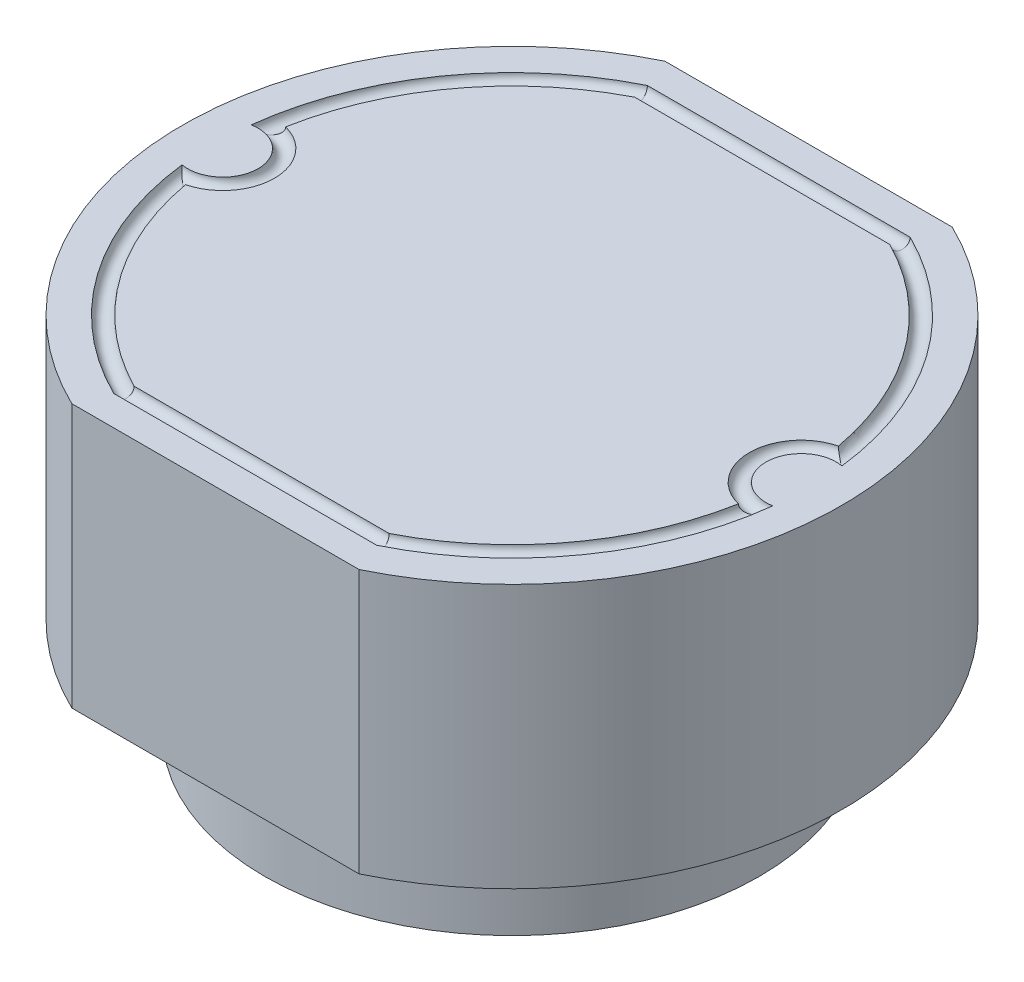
ISO-10303-21;
HEADER;
FILE_DESCRIPTION(('STEP AP214'),'2;1');
FILE_NAME('part.step','',(''),(''),'','','');
FILE_SCHEMA(('AUTOMOTIVE_DESIGN { 1 0 10303 214 1 1 1 1 }'));
ENDSEC;
DATA;
#1=APPLICATION_CONTEXT('core data for automotive mechanical design processes');
#2=APPLICATION_PROTOCOL_DEFINITION('international standard','automotive_design',2000,#1);
#3=PRODUCT_CONTEXT('',#1,'mechanical');
#4=PRODUCT('Part','Part','',(#3));
#5=PRODUCT_RELATED_PRODUCT_CATEGORY('part','',(#4));
#6=PRODUCT_DEFINITION_FORMATION('','',#4);
#7=PRODUCT_DEFINITION_CONTEXT('part definition',#1,'design');
#8=PRODUCT_DEFINITION('design','',#6,#7);
#9=PRODUCT_DEFINITION_SHAPE('','',#8);
#10=(LENGTH_UNIT() NAMED_UNIT(*) SI_UNIT(.MILLI.,.METRE.));
#11=(NAMED_UNIT(*) PLANE_ANGLE_UNIT() SI_UNIT($,.RADIAN.));
#12=(NAMED_UNIT(*) SI_UNIT($,.STERADIAN.) SOLID_ANGLE_UNIT());
#13=UNCERTAINTY_MEASURE_WITH_UNIT(LENGTH_MEASURE(1.E-05),#10,'distance_accuracy_value','');
#14=(GEOMETRIC_REPRESENTATION_CONTEXT(3) GLOBAL_UNCERTAINTY_ASSIGNED_CONTEXT((#13)) GLOBAL_UNIT_ASSIGNED_CONTEXT((#10,
#11,#12)) REPRESENTATION_CONTEXT('',''));
#15=CARTESIAN_POINT('',(0.,0.,0.));
#16=DIRECTION('',(0.,0.,1.));
#17=DIRECTION('',(1.,0.,0.));
#18=AXIS2_PLACEMENT_3D('',#15,#16,#17);
#19=CARTESIAN_POINT('',(39.5732,7.112,-31.44012));
#20=DIRECTION('',(0.,-1.,0.));
#21=DIRECTION('',(-1.,0.,0.));
#22=AXIS2_PLACEMENT_3D('',#19,#20,#21);
#23=PLANE('',#22);
#24=CARTESIAN_POINT('',(29.8324899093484,7.112,-36.195));
#25=DIRECTION('',(0.,1.,0.));
#26=DIRECTION('',(0.,0.,1.));
#27=AXIS2_PLACEMENT_3D('',#24,#25,#26);
#28=CIRCLE('',#27,0.796067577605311);
#29=CARTESIAN_POINT('',(30.0287656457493,7.11200000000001,-35.4235083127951));
#30=VERTEX_POINT('',#29);
#31=CARTESIAN_POINT('',(30.0287656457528,7.11200000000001,-36.9664916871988));
#32=VERTEX_POINT('',#31);
#33=EDGE_CURVE('E164',#30,#32,#28,.T.);
#34=ORIENTED_EDGE('',*,*,#33,.F.);
#35=CARTESIAN_POINT('',(34.29,7.112,-36.195));
#36=DIRECTION('',(0.,-1.,0.));
#37=DIRECTION('',(0.,0.,-1.));
#38=AXIS2_PLACEMENT_3D('',#35,#36,#37);
#39=CIRCLE('',#38,4.33051009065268);
#40=CARTESIAN_POINT('',(32.324272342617,7.112,-32.3363431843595));
#41=VERTEX_POINT('',#40);
#42=EDGE_CURVE('E168',#41,#30,#39,.T.);
#43=ORIENTED_EDGE('',*,*,#42,.F.);
#44=DIRECTION('',(-1.,0.,0.));
#45=VECTOR('',#44,1.);
#46=CARTESIAN_POINT('',(34.29,7.11199999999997,-32.3363431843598));
#47=LINE('',#46,#45);
#48=CARTESIAN_POINT('',(36.2557276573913,7.112,-32.3363431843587));
#49=VERTEX_POINT('',#48);
#50=EDGE_CURVE('E544',#49,#41,#47,.T.);
#51=ORIENTED_EDGE('',*,*,#50,.F.);
#52=CARTESIAN_POINT('',(34.29,7.112,-36.195));
#53=DIRECTION('',(0.,-1.,0.));
#54=DIRECTION('',(0.,0.,-1.));
#55=AXIS2_PLACEMENT_3D('',#52,#53,#54);
#56=CIRCLE('',#55,4.33051009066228);
#57=CARTESIAN_POINT('',(38.5512343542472,7.11200000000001,-35.4235083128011));
#58=VERTEX_POINT('',#57);
#59=EDGE_CURVE('E175',#58,#49,#56,.T.);
#60=ORIENTED_EDGE('',*,*,#59,.F.);
#61=CARTESIAN_POINT('',(38.7475100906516,7.112,-36.195));
#62=DIRECTION('',(0.,1.,0.));
#63=DIRECTION('',(0.,0.,1.));
#64=AXIS2_PLACEMENT_3D('',#61,#62,#63);
#65=CIRCLE('',#64,0.796067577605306);
#66=CARTESIAN_POINT('',(38.5512343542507,7.11200000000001,-36.9664916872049));
#67=VERTEX_POINT('',#66);
#68=EDGE_CURVE('E182',#67,#58,#65,.T.);
#69=ORIENTED_EDGE('',*,*,#68,.F.);
#70=CARTESIAN_POINT('',(34.29,7.112,-36.195));
#71=DIRECTION('',(0.,-1.,0.));
#72=DIRECTION('',(0.,0.,-1.));
#73=AXIS2_PLACEMENT_3D('',#70,#71,#72);
#74=CIRCLE('',#73,4.33051009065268);
#75=CARTESIAN_POINT('',(36.255727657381,7.112,-40.0536568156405));
#76=VERTEX_POINT('',#75);
#77=EDGE_CURVE('E141',#76,#67,#74,.T.);
#78=ORIENTED_EDGE('',*,*,#77,.F.);
#79=DIRECTION('',(1.,0.,0.));
#80=VECTOR('',#79,1.);
#81=CARTESIAN_POINT('',(34.29,7.11199999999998,-40.0536568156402));
#82=LINE('',#81,#80);
#83=CARTESIAN_POINT('',(32.3242723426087,7.112,-40.0536568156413));
#84=VERTEX_POINT('',#83);
#85=EDGE_CURVE('E135',#84,#76,#82,.T.);
#86=ORIENTED_EDGE('',*,*,#85,.F.);
#87=CARTESIAN_POINT('',(34.29,7.112,-36.195));
#88=DIRECTION('',(0.,-1.,0.));
#89=DIRECTION('',(0.,0.,-1.));
#90=AXIS2_PLACEMENT_3D('',#87,#88,#89);
#91=CIRCLE('',#90,4.33051009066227);
#92=EDGE_CURVE('E138',#32,#84,#91,.T.);
#93=ORIENTED_EDGE('',*,*,#92,.F.);
#94=EDGE_LOOP('',(#34,#43,#51,#60,#69,#78,#86,#93));
#95=FACE_BOUND('',#94,.T.);
#96=ADVANCED_FACE('F15',(#95),#23,.F.);
#97=CARTESIAN_POINT('',(32.2398927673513,7.112,-40.1806568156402));
#98=DIRECTION('',(1.,0.,0.));
#99=DIRECTION('',(0.,0.,-1.));
#100=AXIS2_PLACEMENT_3D('',#97,#98,#99);
#101=CYLINDRICAL_SURFACE('',#100,0.126999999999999);
#102=CARTESIAN_POINT('',(36.2859799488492,6.985,-40.1806568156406));
#103=CARTESIAN_POINT('',(36.2855923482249,6.9849999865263,-40.1790168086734));
#104=CARTESIAN_POINT('',(36.2852046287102,6.98503176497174,-40.1773768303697));
#105=CARTESIAN_POINT('',(36.2844294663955,6.98515880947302,-40.1740991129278));
#106=CARTESIAN_POINT('',(36.2840420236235,6.98525408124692,-40.1724613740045));
#107=CARTESIAN_POINT('',(36.2832679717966,6.98550802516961,-40.1691904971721));
#108=CARTESIAN_POINT('',(36.282881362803,6.98566670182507,-40.1675573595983));
#109=CARTESIAN_POINT('',(36.2821095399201,6.98604726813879,-40.164298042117));
#110=CARTESIAN_POINT('',(36.2817243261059,6.98626916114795,-40.1626718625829));
#111=CARTESIAN_POINT('',(36.2809558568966,6.98677589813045,-40.1594288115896));
#112=CARTESIAN_POINT('',(36.2805726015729,6.98706074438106,-40.1578119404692));
#113=CARTESIAN_POINT('',(36.2798086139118,6.98769304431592,-40.1545898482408));
#114=CARTESIAN_POINT('',(36.2794278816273,6.98804049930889,-40.1529846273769));
#115=CARTESIAN_POINT('',(36.2786695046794,6.98879759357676,-40.1497881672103));
#116=CARTESIAN_POINT('',(36.2782918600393,6.98920723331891,-40.1481969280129));
#117=CARTESIAN_POINT('',(36.2775402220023,6.99008819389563,-40.1450307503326));
#118=CARTESIAN_POINT('',(36.2771662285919,6.99055951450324,-40.1434558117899));
#119=CARTESIAN_POINT('',(36.2764224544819,6.9915632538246,-40.1403245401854));
#120=CARTESIAN_POINT('',(36.2760526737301,6.99209567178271,-40.1387682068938));
#121=CARTESIAN_POINT('',(36.2753178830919,6.99322094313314,-40.1356764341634));
#122=CARTESIAN_POINT('',(36.2749528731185,6.99381379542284,-40.134140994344));
#123=CARTESIAN_POINT('',(36.2742281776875,6.99505919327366,-40.1310932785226));
#124=CARTESIAN_POINT('',(36.2738684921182,6.99571173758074,-40.1295810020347));
#125=CARTESIAN_POINT('',(36.2731549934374,6.99707569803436,-40.1265818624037));
#126=CARTESIAN_POINT('',(36.2728011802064,6.99778711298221,-40.125094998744));
#127=CARTESIAN_POINT('',(36.2720999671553,6.99926791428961,-40.1221489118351));
#128=CARTESIAN_POINT('',(36.2717525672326,7.00003729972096,-40.1206896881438));
#129=CARTESIAN_POINT('',(36.2710647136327,7.00163306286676,-40.1178010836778));
#130=CARTESIAN_POINT('',(36.2707242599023,7.00245944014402,-40.1163717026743));
#131=CARTESIAN_POINT('',(36.2700508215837,7.00416812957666,-40.1135449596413));
#132=CARTESIAN_POINT('',(36.2697178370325,7.00505044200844,-40.1121475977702));
#133=CARTESIAN_POINT('',(36.2690598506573,7.00686986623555,-40.1093870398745));
#134=CARTESIAN_POINT('',(36.26873484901,7.00780697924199,-40.1080238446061));
#135=CARTESIAN_POINT('',(36.2680933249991,7.00973478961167,-40.1053337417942));
#136=CARTESIAN_POINT('',(36.2677768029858,7.01072548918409,-40.1040068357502));
#137=CARTESIAN_POINT('',(36.2671527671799,7.01275914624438,-40.1013914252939));
#138=CARTESIAN_POINT('',(36.266845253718,7.01380210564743,-40.1001029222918));
#139=CARTESIAN_POINT('',(36.2662397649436,7.01593885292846,-40.0975664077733));
#140=CARTESIAN_POINT('',(36.265941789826,7.01703264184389,-40.0963183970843));
#141=CARTESIAN_POINT('',(36.2653558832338,7.01926953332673,-40.0938649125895));
#142=CARTESIAN_POINT('',(36.2650679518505,7.02041263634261,-40.0926594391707));
#143=CARTESIAN_POINT('',(36.2645026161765,7.02274655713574,-40.0902930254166));
#144=CARTESIAN_POINT('',(36.2642252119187,7.02393737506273,-40.0891320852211));
#145=CARTESIAN_POINT('',(36.2636813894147,7.02636504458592,-40.0868566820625));
#146=CARTESIAN_POINT('',(36.2634149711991,7.02760189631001,-40.0857422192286));
#147=CARTESIAN_POINT('',(36.2628935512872,7.03011987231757,-40.0835616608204));
#148=CARTESIAN_POINT('',(36.2626385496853,7.03140099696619,-40.0824955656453));
#149=CARTESIAN_POINT('',(36.2621403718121,7.03400567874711,-40.0804135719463));
#150=CARTESIAN_POINT('',(36.261897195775,7.03532923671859,-40.0793976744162));
#151=CARTESIAN_POINT('',(36.2614230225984,7.03801686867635,-40.0774178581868));
#152=CARTESIAN_POINT('',(36.2611920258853,7.03938094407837,-40.076453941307));
#153=CARTESIAN_POINT('',(36.2607427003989,7.04214756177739,-40.0745797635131));
#154=CARTESIAN_POINT('',(36.2605243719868,7.04355010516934,-40.0736695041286));
#155=CARTESIAN_POINT('',(36.260100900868,7.04639150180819,-40.0719042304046));
#156=CARTESIAN_POINT('',(36.2598957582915,7.04783035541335,-40.0710492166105));
#157=CARTESIAN_POINT('',(36.2594991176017,7.05074214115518,-40.0693959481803));
#158=CARTESIAN_POINT('',(36.2593076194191,7.05221507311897,-40.0685976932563));
#159=CARTESIAN_POINT('',(36.2589386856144,7.05519271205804,-40.067059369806));
#160=CARTESIAN_POINT('',(36.258761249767,7.05669741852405,-40.0663193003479));
#161=CARTESIAN_POINT('',(36.2584208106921,7.0597362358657,-40.0648986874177));
#162=CARTESIAN_POINT('',(36.2582578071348,7.06127034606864,-40.0642181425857));
#163=CARTESIAN_POINT('',(36.2579465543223,7.06436553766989,-40.0629178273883));
#164=CARTESIAN_POINT('',(36.2577983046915,7.06592661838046,-40.0622980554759));
#165=CARTESIAN_POINT('',(36.2575168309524,7.0690732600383,-40.0611204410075));
#166=CARTESIAN_POINT('',(36.2573836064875,7.07065882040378,-40.0605625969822));
#167=CARTESIAN_POINT('',(36.2571324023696,7.07385187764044,-40.0595098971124));
#168=CARTESIAN_POINT('',(36.2570144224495,7.07545937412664,-40.059015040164));
#169=CARTESIAN_POINT('',(36.2567938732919,7.07869371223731,-40.0580892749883));
#170=CARTESIAN_POINT('',(36.2566913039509,7.08032055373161,-40.0576583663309));
#171=CARTESIAN_POINT('',(36.2565016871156,7.0835909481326,-40.0568613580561));
#172=CARTESIAN_POINT('',(36.2564146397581,7.08523450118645,-40.0564952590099));
#173=CARTESIAN_POINT('',(36.2562561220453,7.08853564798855,-40.0558286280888));
#174=CARTESIAN_POINT('',(36.2561846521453,7.09019324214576,-40.0555280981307));
#175=CARTESIAN_POINT('',(36.2560572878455,7.09351976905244,-40.0549932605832));
#176=CARTESIAN_POINT('',(36.2560013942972,7.09518870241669,-40.0547589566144));
#177=CARTESIAN_POINT('',(36.2559051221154,7.09853517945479,-40.0543571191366));
#178=CARTESIAN_POINT('',(36.255864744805,7.10021272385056,-40.0541895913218));
#179=CARTESIAN_POINT('',(36.2557993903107,7.10357367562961,-40.0539217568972));
#180=CARTESIAN_POINT('',(36.2557744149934,7.10525708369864,-40.0538214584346));
#181=CARTESIAN_POINT('',(36.2557396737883,7.10862699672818,-40.0536883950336));
#182=CARTESIAN_POINT('',(36.2557299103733,7.11031350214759,-40.0536556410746));
#183=CARTESIAN_POINT('',(36.2557276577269,7.11200000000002,-40.0536568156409));
#184=B_SPLINE_CURVE_WITH_KNOTS('',3,(#102,#103,#104,#105,#106,#107,#108,#109,#110,#111,#112,
#113,#114,#115,#116,#117,#118,#119,#120,#121,#122,#123,#124,#125,#126,#127,#128,#129,#130,#131,
#132,#133,#134,#135,#136,#137,#138,#139,#140,#141,#142,#143,#144,#145,#146,#147,#148,#149,#150,
#151,#152,#153,#154,#155,#156,#157,#158,#159,#160,#161,#162,#163,#164,#165,#166,#167,#168,#169,
#170,#171,#172,#173,#174,#175,#176,#177,#178,#179,#180,#181,#182,#183),.UNSPECIFIED.,.F.,.F.,(4,
2,2,2,2,2,2,2,2,2,2,2,2,2,2,2,2,2,2,2,2,2,2,2,2,2,2,2,2,2,2,2,2,2,2,2,2,2,2,2,4),(0.,
0.00505526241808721,0.0101109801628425,0.0151670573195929,0.0202234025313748,0.0252799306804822,
0.0303365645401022,0.0353932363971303,0.0404498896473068,0.0455064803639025,0.0505629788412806,
0.0556193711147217,0.0606756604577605,0.0657318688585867,0.07078803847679,0.0758442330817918,
0.0809005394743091,0.0859570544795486,0.0910137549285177,0.0960705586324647,0.101127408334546,
0.106184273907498,0.111241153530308,0.116298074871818,0.121355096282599,0.126412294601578,
0.131469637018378,0.136527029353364,0.141584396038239,0.146641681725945,0.151698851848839,
0.156755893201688,0.161812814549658,0.16686964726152,0.171926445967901,0.17698328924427,
0.182040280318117,0.187097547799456,0.192155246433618,0.197213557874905,0.20227269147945),.UNSPECIFIED.);
#185=CARTESIAN_POINT('',(36.2859799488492,6.985,-40.1806568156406));
#186=VERTEX_POINT('',#185);
#187=EDGE_CURVE('E191',#186,#76,#184,.T.);
#188=ORIENTED_EDGE('',*,*,#187,.F.);
#189=CARTESIAN_POINT('',(36.3157805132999,7.112,-40.30765681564));
#190=CARTESIAN_POINT('',(36.3157786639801,7.11031416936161,-40.3076577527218));
#191=CARTESIAN_POINT('',(36.3157694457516,7.1086283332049,-40.307624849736));
#192=CARTESIAN_POINT('',(36.3157361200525,7.10525971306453,-40.3074916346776));
#193=CARTESIAN_POINT('',(36.3157120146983,7.1035769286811,-40.3073913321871));
#194=CARTESIAN_POINT('',(36.3156487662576,7.10021717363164,-40.3071236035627));
#195=CARTESIAN_POINT('',(36.3156096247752,7.09854020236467,-40.3069561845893));
#196=CARTESIAN_POINT('',(36.3155162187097,7.09519481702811,-40.3065546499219));
#197=CARTESIAN_POINT('',(36.3154619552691,7.09352640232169,-40.3063205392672));
#198=CARTESIAN_POINT('',(36.3153382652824,7.09020085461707,-40.3057861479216));
#199=CARTESIAN_POINT('',(36.3152688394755,7.08854372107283,-40.305485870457));
#200=CARTESIAN_POINT('',(36.3151148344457,7.08524343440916,-40.3048197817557));
#201=CARTESIAN_POINT('',(36.3150302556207,7.08360028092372,-40.3044539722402));
#202=CARTESIAN_POINT('',(36.3148460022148,7.08033062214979,-40.3036575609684));
#203=CARTESIAN_POINT('',(36.3147463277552,7.07870411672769,-40.3032269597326));
#204=CARTESIAN_POINT('',(36.3145319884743,7.07547038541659,-40.3023018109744));
#205=CARTESIAN_POINT('',(36.3144173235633,7.07386315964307,-40.3018072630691));
#206=CARTESIAN_POINT('',(36.314173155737,7.07067057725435,-40.3007551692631));
#207=CARTESIAN_POINT('',(36.3140436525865,7.06908522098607,-40.3001976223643));
#208=CARTESIAN_POINT('',(36.3137700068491,7.06593892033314,-40.2990205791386));
#209=CARTESIAN_POINT('',(36.313625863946,7.06437797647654,-40.2984010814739));
#210=CARTESIAN_POINT('',(36.3133231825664,7.06128299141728,-40.297101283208));
#211=CARTESIAN_POINT('',(36.3131646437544,7.05974895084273,-40.2964209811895));
#212=CARTESIAN_POINT('',(36.312833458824,7.05671020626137,-40.2950008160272));
#213=CARTESIAN_POINT('',(36.3126608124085,7.05520550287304,-40.2942609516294));
#214=CARTESIAN_POINT('',(36.31230174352,7.05222780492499,-40.2927229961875));
#215=CARTESIAN_POINT('',(36.3121153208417,7.05075481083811,-40.2919249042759));
#216=CARTESIAN_POINT('',(36.3117290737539,7.0478428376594,-40.2902719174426));
#217=CARTESIAN_POINT('',(36.3115292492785,7.04640385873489,-40.2894170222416));
#218=CARTESIAN_POINT('',(36.3111166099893,7.04356215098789,-40.2876519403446));
#219=CARTESIAN_POINT('',(36.31090379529,7.04215942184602,-40.2867417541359));
#220=CARTESIAN_POINT('',(36.3104656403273,7.03939237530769,-40.2848676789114));
#221=CARTESIAN_POINT('',(36.3102403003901,7.0380280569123,-40.283903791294));
#222=CARTESIAN_POINT('',(36.3097775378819,7.03533988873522,-40.2819239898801));
#223=CARTESIAN_POINT('',(36.309540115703,7.03401603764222,-40.2809080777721));
#224=CARTESIAN_POINT('',(36.3090535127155,7.03141073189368,-40.2788260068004));
#225=CARTESIAN_POINT('',(36.308804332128,7.03012927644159,-40.2777598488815));
#226=CARTESIAN_POINT('',(36.3082945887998,7.02761061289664,-40.2755791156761));
#227=CARTESIAN_POINT('',(36.3080340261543,7.0263734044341,-40.2744645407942));
#228=CARTESIAN_POINT('',(36.3075019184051,7.02394500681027,-40.2721888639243));
#229=CARTESIAN_POINT('',(36.3072303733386,7.02275381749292,-40.271027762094));
#230=CARTESIAN_POINT('',(36.3066767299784,7.02041914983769,-40.2686609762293));
#231=CARTESIAN_POINT('',(36.3063946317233,7.01927567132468,-40.2674552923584));
#232=CARTESIAN_POINT('',(36.3058203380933,7.01703803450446,-40.2650013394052));
#233=CARTESIAN_POINT('',(36.305528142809,7.0159438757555,-40.2637530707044));
#234=CARTESIAN_POINT('',(36.3049341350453,7.01380640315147,-40.2612159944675));
#235=CARTESIAN_POINT('',(36.304632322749,7.01276308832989,-40.2599271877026));
#236=CARTESIAN_POINT('',(36.3040195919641,7.01072874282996,-40.2573111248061));
#237=CARTESIAN_POINT('',(36.3037086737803,7.00973771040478,-40.2559838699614));
#238=CARTESIAN_POINT('',(36.3030782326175,7.00780926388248,-40.2532930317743));
#239=CARTESIAN_POINT('',(36.3027587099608,7.00687184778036,-40.2519294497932));
#240=CARTESIAN_POINT('',(36.302111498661,7.00505185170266,-40.2491681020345));
#241=CARTESIAN_POINT('',(36.3017838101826,7.00416927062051,-40.2477703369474));
#242=CARTESIAN_POINT('',(36.3011207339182,7.00246008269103,-40.2449427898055));
#243=CARTESIAN_POINT('',(36.3007853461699,7.00163347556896,-40.2435130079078));
#244=CARTESIAN_POINT('',(36.3001073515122,7.00003729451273,-40.2406236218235));
#245=CARTESIAN_POINT('',(36.2997647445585,6.99926772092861,-40.2391640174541));
#246=CARTESIAN_POINT('',(36.2990728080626,6.9977865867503,-40.2362172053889));
#247=CARTESIAN_POINT('',(36.2987234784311,6.99707502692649,-40.2347299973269));
#248=CARTESIAN_POINT('',(36.2980186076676,6.99571082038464,-40.2317302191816));
#249=CARTESIAN_POINT('',(36.2976630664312,6.99505817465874,-40.2302176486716));
#250=CARTESIAN_POINT('',(36.2969462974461,6.99381261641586,-40.2271694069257));
#251=CARTESIAN_POINT('',(36.2965850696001,6.99321970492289,-40.2256337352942));
#252=CARTESIAN_POINT('',(36.2958574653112,6.99209435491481,-40.2225415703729));
#253=CARTESIAN_POINT('',(36.2954910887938,6.99156191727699,-40.2209850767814));
#254=CARTESIAN_POINT('',(36.2947537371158,6.99055817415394,-40.2178535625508));
#255=CARTESIAN_POINT('',(36.2943827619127,6.9900868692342,-40.2162785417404));
#256=CARTESIAN_POINT('',(36.293636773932,6.98920596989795,-40.2131122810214));
#257=CARTESIAN_POINT('',(36.2932617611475,6.98879637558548,-40.2115210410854));
#258=CARTESIAN_POINT('',(36.2925082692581,6.98803939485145,-40.2083246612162));
#259=CARTESIAN_POINT('',(36.2921297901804,6.98769200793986,-40.2067195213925));
#260=CARTESIAN_POINT('',(36.2913699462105,6.98705985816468,-40.2034976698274));
#261=CARTESIAN_POINT('',(36.2909885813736,6.98677509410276,-40.201880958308));
#262=CARTESIAN_POINT('',(36.290223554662,6.9862685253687,-40.1986382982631));
#263=CARTESIAN_POINT('',(36.2898398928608,6.9860467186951,-40.197012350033));
#264=CARTESIAN_POINT('',(36.2890708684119,6.98566631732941,-40.1937535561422));
#265=CARTESIAN_POINT('',(36.2886855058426,6.98550771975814,-40.1921207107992));
#266=CARTESIAN_POINT('',(36.2879136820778,6.98525391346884,-40.188850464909));
#267=CARTESIAN_POINT('',(36.2875272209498,6.98515870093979,-40.1872130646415));
#268=CARTESIAN_POINT('',(36.2867538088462,6.98503173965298,-40.1839360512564));
#269=CARTESIAN_POINT('',(36.2863668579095,6.98499998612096,-40.1822964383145));
#270=CARTESIAN_POINT('',(36.2859799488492,6.985,-40.1806568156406));
#271=B_SPLINE_CURVE_WITH_KNOTS('',3,(#189,#190,#191,#192,#193,#194,#195,#196,#197,#198,#199,
#200,#201,#202,#203,#204,#205,#206,#207,#208,#209,#210,#211,#212,#213,#214,#215,#216,#217,#218,
#219,#220,#221,#222,#223,#224,#225,#226,#227,#228,#229,#230,#231,#232,#233,#234,#235,#236,#237,
#238,#239,#240,#241,#242,#243,#244,#245,#246,#247,#248,#249,#250,#251,#252,#253,#254,#255,#256,
#257,#258,#259,#260,#261,#262,#263,#264,#265,#266,#267,#268,#269,#270),.UNSPECIFIED.,.F.,.F.,(4,
2,2,2,2,2,2,2,2,2,2,2,2,2,2,2,2,2,2,2,2,2,2,2,2,2,2,2,2,2,2,2,2,2,2,2,2,2,2,2,4),(0.,
0.00505713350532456,0.0101135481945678,0.0151694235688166,0.0202249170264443,0.0252801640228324,
0.0303352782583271,0.0353903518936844,0.0404454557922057,0.0455006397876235,0.0505559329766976,
0.0556113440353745,0.0606668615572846,0.0657224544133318,0.0707780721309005,0.0758336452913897,
0.0808890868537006,0.0859443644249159,0.0909995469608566,0.0960546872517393,0.101109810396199,
0.106164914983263,0.111219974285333,0.116274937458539,0.121329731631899,0.126384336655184,
0.131438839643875,0.136493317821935,0.141547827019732,0.14660240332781,0.151657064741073,
0.156711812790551,0.161766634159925,0.166821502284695,0.171876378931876,0.176931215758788,
0.181985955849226,0.187040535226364,0.192094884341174,0.197148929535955,0.202202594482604),.UNSPECIFIED.);
#272=CARTESIAN_POINT('',(36.3157805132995,7.112,-40.3076568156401));
#273=VERTEX_POINT('',#272);
#274=EDGE_CURVE('E333',#273,#186,#271,.T.);
#275=ORIENTED_EDGE('',*,*,#274,.F.);
#276=DIRECTION('',(-1.,0.,0.));
#277=VECTOR('',#276,1.);
#278=CARTESIAN_POINT('',(34.29,7.112,-40.3076568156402));
#279=LINE('',#278,#277);
#280=CARTESIAN_POINT('',(32.2642194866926,7.112,-40.3076568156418));
#281=VERTEX_POINT('',#280);
#282=EDGE_CURVE('E197',#273,#281,#279,.T.);
#283=ORIENTED_EDGE('',*,*,#282,.T.);
#284=CARTESIAN_POINT('',(32.2940200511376,6.985,-40.1806568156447));
#285=CARTESIAN_POINT('',(32.293633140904,6.98499998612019,-40.1822964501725));
#286=CARTESIAN_POINT('',(32.293246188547,6.98503174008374,-40.1839360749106));
#287=CARTESIAN_POINT('',(32.2924727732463,6.98515870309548,-40.1872131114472));
#288=CARTESIAN_POINT('',(32.2920863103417,6.98525391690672,-40.1888505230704));
#289=CARTESIAN_POINT('',(32.2913144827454,6.98550772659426,-40.1921207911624));
#290=CARTESIAN_POINT('',(32.290929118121,6.98566632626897,-40.1937536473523));
#291=CARTESIAN_POINT('',(32.2901600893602,6.98604673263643,-40.19701246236));
#292=CARTESIAN_POINT('',(32.2897764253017,6.98626854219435,-40.1986384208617));
#293=CARTESIAN_POINT('',(32.2890113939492,6.98677511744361,-40.2018811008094));
#294=CARTESIAN_POINT('',(32.2886300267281,6.98705988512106,-40.2034978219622));
#295=CARTESIAN_POINT('',(32.2878701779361,6.98769204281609,-40.2067196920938));
#296=CARTESIAN_POINT('',(32.28749169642,6.98803943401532,-40.2083248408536));
#297=CARTESIAN_POINT('',(32.2867381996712,6.98879642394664,-40.2115212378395));
#298=CARTESIAN_POINT('',(32.286363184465,6.98920602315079,-40.21311248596));
#299=CARTESIAN_POINT('',(32.2856171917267,6.99008693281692,-40.2162787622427));
#300=CARTESIAN_POINT('',(32.2852462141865,6.99055824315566,-40.2178537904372));
#301=CARTESIAN_POINT('',(32.284508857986,6.99156199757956,-40.2209853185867));
#302=CARTESIAN_POINT('',(32.2841424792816,6.99209444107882,-40.2225418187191));
#303=CARTESIAN_POINT('',(32.2834148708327,6.99321980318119,-40.2256339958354));
#304=CARTESIAN_POINT('',(32.2830536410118,6.99381272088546,-40.2271696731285));
#305=CARTESIAN_POINT('',(32.2823368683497,6.99505829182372,-40.2302179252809));
#306=CARTESIAN_POINT('',(32.281981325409,6.99571094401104,-40.2317305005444));
#307=CARTESIAN_POINT('',(32.281276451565,6.9970751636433,-40.234730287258));
#308=CARTESIAN_POINT('',(32.2809271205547,6.99778673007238,-40.2362174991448));
#309=CARTESIAN_POINT('',(32.2802351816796,6.9992678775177,-40.239164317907));
#310=CARTESIAN_POINT('',(32.2798925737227,7.00003745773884,-40.2406239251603));
#311=CARTESIAN_POINT('',(32.2792145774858,7.00163365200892,-40.2435133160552));
#312=CARTESIAN_POINT('',(32.2788791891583,7.00246026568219,-40.2449430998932));
#313=CARTESIAN_POINT('',(32.2782161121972,7.00416946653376,-40.2477706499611));
#314=CARTESIAN_POINT('',(32.2778884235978,7.00505205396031,-40.249168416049));
#315=CARTESIAN_POINT('',(32.2772412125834,7.00687206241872,-40.2519297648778));
#316=CARTESIAN_POINT('',(32.2769216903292,7.00780948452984,-40.2532933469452));
#317=CARTESIAN_POINT('',(32.2762912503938,7.00973794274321,-40.2559841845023));
#318=CARTESIAN_POINT('',(32.2759803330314,7.01072898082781,-40.2573114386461));
#319=CARTESIAN_POINT('',(32.275367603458,7.0127633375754,-40.2599274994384));
#320=CARTESIAN_POINT('',(32.27506579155,7.01380665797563,-40.261216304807));
#321=CARTESIAN_POINT('',(32.2744717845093,7.01594414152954,-40.2637533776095));
#322=CARTESIAN_POINT('',(32.2741795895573,7.01703830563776,-40.2650016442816));
#323=CARTESIAN_POINT('',(32.2736052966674,7.0192759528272,-40.2674555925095));
#324=CARTESIAN_POINT('',(32.2733231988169,7.02041943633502,-40.2686612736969));
#325=CARTESIAN_POINT('',(32.2727695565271,7.02275411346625,-40.2710280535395));
#326=CARTESIAN_POINT('',(32.2724980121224,7.02394530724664,-40.272189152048));
#327=CARTESIAN_POINT('',(32.2719659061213,7.02637371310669,-40.2744648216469));
#328=CARTESIAN_POINT('',(32.271705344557,7.02761092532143,-40.2755793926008));
#329=CARTESIAN_POINT('',(32.2711956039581,7.030129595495,-40.2777601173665));
#330=CARTESIAN_POINT('',(32.2709464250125,7.03141105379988,-40.2788262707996));
#331=CARTESIAN_POINT('',(32.2704598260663,7.03401636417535,-40.2809083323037));
#332=CARTESIAN_POINT('',(32.2702224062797,7.03534021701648,-40.2819242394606));
#333=CARTESIAN_POINT('',(32.2697596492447,7.03802838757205,-40.283904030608));
#334=CARTESIAN_POINT('',(32.2695343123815,7.03939270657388,-40.2848679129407));
#335=CARTESIAN_POINT('',(32.2690961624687,7.04215975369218,-40.2867419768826));
#336=CARTESIAN_POINT('',(32.268883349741,7.04356248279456,-40.2876521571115));
#337=CARTESIAN_POINT('',(32.268470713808,7.04640418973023,-40.2894172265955));
#338=CARTESIAN_POINT('',(32.2682708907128,7.04784316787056,-40.2902721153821));
#339=CARTESIAN_POINT('',(32.2678846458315,7.05075513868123,-40.2919250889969));
#340=CARTESIAN_POINT('',(32.2676982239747,7.05222813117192,-40.292723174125));
#341=CARTESIAN_POINT('',(32.2673391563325,7.05520582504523,-40.2942611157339));
#342=CARTESIAN_POINT('',(32.2671665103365,7.05671052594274,-40.2950009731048));
#343=CARTESIAN_POINT('',(32.2668353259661,7.05974926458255,-40.2964211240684));
#344=CARTESIAN_POINT('',(32.2666767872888,7.06128330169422,-40.2971014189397));
#345=CARTESIAN_POINT('',(32.2663741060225,7.06437827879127,-40.2984012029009));
#346=CARTESIAN_POINT('',(32.2662299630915,7.06593921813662,-40.2990206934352));
#347=CARTESIAN_POINT('',(32.2659563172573,7.06908550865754,-40.3001977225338));
#348=CARTESIAN_POINT('',(32.265826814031,7.07067085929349,-40.3007552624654));
#349=CARTESIAN_POINT('',(32.2655826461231,7.07386342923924,-40.3018073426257));
#350=CARTESIAN_POINT('',(32.2654679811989,7.07547064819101,-40.3023018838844));
#351=CARTESIAN_POINT('',(32.265253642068,7.07870436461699,-40.3032270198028));
#352=CARTESIAN_POINT('',(32.2651539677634,7.0803308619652,-40.30365761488));
#353=CARTESIAN_POINT('',(32.2649697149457,7.08360050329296,-40.3044540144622));
#354=CARTESIAN_POINT('',(32.2648851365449,7.08524364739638,-40.3048198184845));
#355=CARTESIAN_POINT('',(32.2647311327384,7.08854391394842,-40.3054858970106));
#356=CARTESIAN_POINT('',(32.2646617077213,7.09020103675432,-40.3057861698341));
#357=CARTESIAN_POINT('',(32.2645380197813,7.09352656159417,-40.3063205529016));
#358=CARTESIAN_POINT('',(32.2644837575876,7.09519496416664,-40.3065546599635));
#359=CARTESIAN_POINT('',(32.2643903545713,7.09854032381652,-40.3069561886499));
#360=CARTESIAN_POINT('',(32.2643512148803,7.10021728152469,-40.3071236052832));
#361=CARTESIAN_POINT('',(32.2642879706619,7.10357700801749,-40.3073913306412));
#362=CARTESIAN_POINT('',(32.2642638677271,7.10525977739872,-40.3074916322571));
#363=CARTESIAN_POINT('',(32.2642305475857,7.10862836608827,-40.3076248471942));
#364=CARTESIAN_POINT('',(32.2642213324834,7.11031418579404,-40.3076577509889));
#365=CARTESIAN_POINT('',(32.2642194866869,7.112,-40.3076568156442));
#366=B_SPLINE_CURVE_WITH_KNOTS('',3,(#284,#285,#286,#287,#288,#289,#290,#291,#292,#293,#294,
#295,#296,#297,#298,#299,#300,#301,#302,#303,#304,#305,#306,#307,#308,#309,#310,#311,#312,#313,
#314,#315,#316,#317,#318,#319,#320,#321,#322,#323,#324,#325,#326,#327,#328,#329,#330,#331,#332,
#333,#334,#335,#336,#337,#338,#339,#340,#341,#342,#343,#344,#345,#346,#347,#348,#349,#350,#351,
#352,#353,#354,#355,#356,#357,#358,#359,#360,#361,#362,#363,#364,#365),.UNSPECIFIED.,.F.,.F.,(4,
2,2,2,2,2,2,2,2,2,2,2,2,2,2,2,2,2,2,2,2,2,2,2,2,2,2,2,2,2,2,2,2,2,2,2,2,2,2,2,4),(0.,
0.00505370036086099,0.0101077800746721,0.0151621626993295,0.0202167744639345,0.0252715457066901,
0.0303264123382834,0.0353813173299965,0.0404362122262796,0.0454910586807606,0.0505458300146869,
0.0556005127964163,0.0606551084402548,0.0657096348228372,0.0707641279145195,0.0758186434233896,
0.0808732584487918,0.0859280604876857,0.0909830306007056,0.0960380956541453,0.10109320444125,
0.106148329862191,0.111203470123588,0.11625864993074,0.121313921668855,0.126369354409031,
0.131424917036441,0.136480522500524,0.141536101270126,0.146591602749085,0.151646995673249,
0.156702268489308,0.161757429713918,0.166812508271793,0.171867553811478,0.176922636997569,
0.181977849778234,0.187033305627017,0.192089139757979,0.197145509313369,0.202202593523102),.UNSPECIFIED.);
#367=CARTESIAN_POINT('',(32.2940200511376,6.985,-40.1806568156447));
#368=VERTEX_POINT('',#367);
#369=EDGE_CURVE('E150',#368,#281,#366,.T.);
#370=ORIENTED_EDGE('',*,*,#369,.F.);
#371=CARTESIAN_POINT('',(32.3242723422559,7.11200000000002,-40.053656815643));
#372=CARTESIAN_POINT('',(32.3242700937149,7.1103135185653,-40.0536556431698));
#373=CARTESIAN_POINT('',(32.3242603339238,7.10862702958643,-40.0536883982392));
#374=CARTESIAN_POINT('',(32.3242255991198,7.10525714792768,-40.0538214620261));
#375=CARTESIAN_POINT('',(32.3242006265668,7.10357375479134,-40.0539217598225));
#376=CARTESIAN_POINT('',(32.3241352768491,7.10021283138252,-40.0541895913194));
#377=CARTESIAN_POINT('',(32.3240949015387,7.09853530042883,-40.0543571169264));
#378=CARTESIAN_POINT('',(32.3239986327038,7.0951888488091,-40.0547589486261));
#379=CARTESIAN_POINT('',(32.323942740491,7.09351992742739,-40.0549932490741));
#380=CARTESIAN_POINT('',(32.3238153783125,7.09019342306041,-40.0555280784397));
#381=CARTESIAN_POINT('',(32.3237439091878,7.08853583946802,-40.0558286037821));
#382=CARTESIAN_POINT('',(32.3235853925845,7.08523471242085,-40.0564952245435));
#383=CARTESIAN_POINT('',(32.3234983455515,7.08359116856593,-40.056861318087));
#384=CARTESIAN_POINT('',(32.3233087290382,7.0803207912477,-40.0576583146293));
#385=CARTESIAN_POINT('',(32.3232061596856,7.07869395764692,-40.0580892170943));
#386=CARTESIAN_POINT('',(32.3229856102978,7.07545963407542,-40.0590149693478));
#387=CARTESIAN_POINT('',(32.3228676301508,7.07385214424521,-40.0595098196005));
#388=CARTESIAN_POINT('',(32.3226164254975,7.07065909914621,-40.0605625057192));
#389=CARTESIAN_POINT('',(32.3224832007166,7.06907354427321,-40.06112034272));
#390=CARTESIAN_POINT('',(32.3222017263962,7.06592691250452,-40.0622979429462));
#391=CARTESIAN_POINT('',(32.3220534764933,7.06436583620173,-40.0629177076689));
#392=CARTESIAN_POINT('',(32.3217422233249,7.06127065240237,-40.0642180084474));
#393=CARTESIAN_POINT('',(32.3215792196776,7.05973654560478,-40.0648985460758));
#394=CARTESIAN_POINT('',(32.321238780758,7.05669773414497,-40.0663191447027));
#395=CARTESIAN_POINT('',(32.3210613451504,7.0551930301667,-40.0670592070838));
#396=CARTESIAN_POINT('',(32.3206924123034,7.05221539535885,-40.0685975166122));
#397=CARTESIAN_POINT('',(32.3205009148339,7.05074246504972,-40.0693957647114));
#398=CARTESIAN_POINT('',(32.3201042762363,7.047830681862,-40.0710490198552));
#399=CARTESIAN_POINT('',(32.3198991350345,7.04639182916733,-40.071904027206));
#400=CARTESIAN_POINT('',(32.3194756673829,7.04355043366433,-40.0736692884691));
#401=CARTESIAN_POINT('',(32.3192573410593,7.04214789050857,-40.0745795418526));
#402=CARTESIAN_POINT('',(32.3188080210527,7.03938127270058,-40.0764537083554));
#403=CARTESIAN_POINT('',(32.3185770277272,7.03801719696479,-40.0774176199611));
#404=CARTESIAN_POINT('',(32.3181028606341,7.03532956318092,-40.0793974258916));
#405=CARTESIAN_POINT('',(32.3178596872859,7.03400600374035,-40.0804133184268));
#406=CARTESIAN_POINT('',(32.3173615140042,7.03140131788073,-40.0824953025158));
#407=CARTESIAN_POINT('',(32.3171065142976,7.03012019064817,-40.0835613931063));
#408=CARTESIAN_POINT('',(32.3165850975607,7.02760220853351,-40.0857419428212));
#409=CARTESIAN_POINT('',(32.3163186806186,7.02636535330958,-40.086856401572));
#410=CARTESIAN_POINT('',(32.3157748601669,7.02393767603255,-40.0891317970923));
#411=CARTESIAN_POINT('',(32.3154974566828,7.02274685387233,-40.0902927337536));
#412=CARTESIAN_POINT('',(32.3149321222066,7.02041292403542,-40.0926591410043));
#413=CARTESIAN_POINT('',(32.3146441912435,7.01926981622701,-40.0938646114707));
#414=CARTESIAN_POINT('',(32.3140582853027,7.01703291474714,-40.0963180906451));
#415=CARTESIAN_POINT('',(32.3137603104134,7.0159391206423,-40.0975660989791));
#416=CARTESIAN_POINT('',(32.3131548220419,7.01380236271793,-40.1001026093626));
#417=CARTESIAN_POINT('',(32.3128473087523,7.01275939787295,-40.1013911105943));
#418=CARTESIAN_POINT('',(32.3122232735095,7.01072572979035,-40.1040065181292));
#419=CARTESIAN_POINT('',(32.3119067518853,7.00973502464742,-40.1053334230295));
#420=CARTESIAN_POINT('',(32.3112652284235,7.00780720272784,-40.1080235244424));
#421=CARTESIAN_POINT('',(32.3109402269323,7.00687008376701,-40.1093867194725));
#422=CARTESIAN_POINT('',(32.3102822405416,7.00505064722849,-40.1121472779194));
#423=CARTESIAN_POINT('',(32.3099492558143,7.00416832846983,-40.113544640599));
#424=CARTESIAN_POINT('',(32.3092758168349,7.00245962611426,-40.1163713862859));
#425=CARTESIAN_POINT('',(32.3089353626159,7.00163324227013,-40.1178007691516));
#426=CARTESIAN_POINT('',(32.3082475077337,7.00003746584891,-40.1206893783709));
#427=CARTESIAN_POINT('',(32.3079001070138,6.99926807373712,-40.122148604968));
#428=CARTESIAN_POINT('',(32.3071988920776,6.99778725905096,-40.1250946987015));
#429=CARTESIAN_POINT('',(32.3068450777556,6.99707583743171,-40.1265815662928));
#430=CARTESIAN_POINT('',(32.3061315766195,6.99571186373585,-40.1295807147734));
#431=CARTESIAN_POINT('',(32.3057718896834,6.99505931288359,-40.1310929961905));
#432=CARTESIAN_POINT('',(32.3050471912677,6.99381390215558,-40.134140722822));
#433=CARTESIAN_POINT('',(32.3046821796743,6.99322104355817,-40.1356761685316));
#434=CARTESIAN_POINT('',(32.3039473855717,6.99209575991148,-40.1387679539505));
#435=CARTESIAN_POINT('',(32.3035776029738,6.9915633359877,-40.1403242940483));
#436=CARTESIAN_POINT('',(32.3028338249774,6.99055958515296,-40.1434555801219));
#437=CARTESIAN_POINT('',(32.3024598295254,6.99008825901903,-40.145030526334));
#438=CARTESIAN_POINT('',(32.301708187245,6.98920728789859,-40.1481967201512));
#439=CARTESIAN_POINT('',(32.301330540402,6.9887976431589,-40.1497879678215));
#440=CARTESIAN_POINT('',(32.3005721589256,6.98804053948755,-40.1529844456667));
#441=CARTESIAN_POINT('',(32.3001914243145,6.98769308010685,-40.1545896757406));
#442=CARTESIAN_POINT('',(32.2994274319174,6.98706077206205,-40.1578117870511));
#443=CARTESIAN_POINT('',(32.2990441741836,6.98677592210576,-40.1594286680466));
#444=CARTESIAN_POINT('',(32.2982757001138,6.98626917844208,-40.1626717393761));
#445=CARTESIAN_POINT('',(32.2978904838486,6.98604728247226,-40.1642979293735));
#446=CARTESIAN_POINT('',(32.297118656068,6.98566671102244,-40.1675572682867));
#447=CARTESIAN_POINT('',(32.2967320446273,6.98550803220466,-40.1691904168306));
#448=CARTESIAN_POINT('',(32.2959579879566,6.98525408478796,-40.1724613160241));
#449=CARTESIAN_POINT('',(32.2955705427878,6.9851588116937,-40.1740990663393));
#450=CARTESIAN_POINT('',(32.2947953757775,6.98503176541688,-40.1773768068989));
#451=CARTESIAN_POINT('',(32.2944076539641,6.98499998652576,-40.1790167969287));
#452=CARTESIAN_POINT('',(32.2940200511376,6.985,-40.1806568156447));
#453=B_SPLINE_CURVE_WITH_KNOTS('',3,(#371,#372,#373,#374,#375,#376,#377,#378,#379,#380,#381,
#382,#383,#384,#385,#386,#387,#388,#389,#390,#391,#392,#393,#394,#395,#396,#397,#398,#399,#400,
#401,#402,#403,#404,#405,#406,#407,#408,#409,#410,#411,#412,#413,#414,#415,#416,#417,#418,#419,
#420,#421,#422,#423,#424,#425,#426,#427,#428,#429,#430,#431,#432,#433,#434,#435,#436,#437,#438,
#439,#440,#441,#442,#443,#444,#445,#446,#447,#448,#449,#450,#451,#452),.UNSPECIFIED.,.F.,.F.,(4,
2,2,2,2,2,2,2,2,2,2,2,2,2,2,2,2,2,2,2,2,2,2,2,2,2,2,2,2,2,2,2,2,2,2,2,2,2,2,2,4),(0.,
0.0050590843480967,0.0101173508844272,0.015175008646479,0.0202322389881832,0.0252891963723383,
0.0303460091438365,0.0354027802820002,0.0404595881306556,0.0455164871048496,0.050573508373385,
0.0556306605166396,0.0606879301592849,0.0657452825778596,0.070802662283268,0.0758599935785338,
0.0809171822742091,0.0859741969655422,0.0910311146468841,0.0960879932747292,0.101144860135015,
0.106201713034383,0.111258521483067,0.116315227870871,0.121371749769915,0.12642806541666,
0.131484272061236,0.136540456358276,0.141596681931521,0.146652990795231,0.151709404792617,
0.156765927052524,0.161822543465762,0.166879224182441,0.171935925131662,0.176992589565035,
0.182049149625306,0.18710552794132,0.192161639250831,0.197217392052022,0.202272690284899),.UNSPECIFIED.);
#454=EDGE_CURVE('E146',#84,#368,#453,.T.);
#455=ORIENTED_EDGE('',*,*,#454,.F.);
#456=ORIENTED_EDGE('',*,*,#85,.T.);
#457=EDGE_LOOP('',(#188,#275,#283,#370,#455,#456));
#458=FACE_BOUND('',#457,.T.);
#459=ADVANCED_FACE('F148',(#458),#101,.F.);
#460=CARTESIAN_POINT('',(34.29,7.112,-36.195));
#461=DIRECTION('',(0.,-1.,0.));
#462=DIRECTION('',(0.988735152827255,0.,0.149675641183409));
#463=AXIS2_PLACEMENT_3D('',#460,#461,#462);
#464=TOROIDAL_SURFACE('',#463,4.45751009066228,0.127);
#465=CARTESIAN_POINT('',(29.8827030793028,6.985,-36.8621806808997));
#466=CARTESIAN_POINT('',(29.8813118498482,6.98500000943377,-36.8610656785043));
#467=CARTESIAN_POINT('',(29.8799219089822,6.98501747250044,-36.8599490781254));
#468=CARTESIAN_POINT('',(29.8771449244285,6.98508698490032,-36.8577125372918));
#469=CARTESIAN_POINT('',(29.8757578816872,6.98513904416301,-36.8565925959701));
#470=CARTESIAN_POINT('',(29.8729874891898,6.98527744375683,-36.8543496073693));
#471=CARTESIAN_POINT('',(29.8716041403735,6.98536379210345,-36.8532265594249));
#472=CARTESIAN_POINT('',(29.8688419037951,6.98557052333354,-36.8509775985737));
#473=CARTESIAN_POINT('',(29.8674630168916,6.98569091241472,-36.8498516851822));
#474=CARTESIAN_POINT('',(29.8647104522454,6.98596551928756,-36.8475972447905));
#475=CARTESIAN_POINT('',(29.8633367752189,6.98611974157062,-36.8464687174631));
#476=CARTESIAN_POINT('',(29.8605953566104,6.98646185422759,-36.8442093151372));
#477=CARTESIAN_POINT('',(29.859227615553,6.98664974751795,-36.8430784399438));
#478=CARTESIAN_POINT('',(29.8564987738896,6.98705908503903,-36.8408146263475));
#479=CARTESIAN_POINT('',(29.8551376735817,6.98728053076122,-36.8396816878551));
#480=CARTESIAN_POINT('',(29.8524227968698,6.98775689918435,-36.837414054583));
#481=CARTESIAN_POINT('',(29.8510690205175,6.98801182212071,-36.8362793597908));
#482=CARTESIAN_POINT('',(29.8483694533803,6.98855511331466,-36.834008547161));
#483=CARTESIAN_POINT('',(29.8470236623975,6.98884348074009,-36.8328724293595));
#484=CARTESIAN_POINT('',(29.8443407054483,6.9894536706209,-36.8305991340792));
#485=CARTESIAN_POINT('',(29.8430035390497,6.98977549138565,-36.8294619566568));
#486=CARTESIAN_POINT('',(29.8403384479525,6.99045263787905,-36.8271869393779));
#487=CARTESIAN_POINT('',(29.8390105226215,6.99080796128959,-36.8260490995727));
#488=CARTESIAN_POINT('',(29.836364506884,6.99155220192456,-36.823773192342));
#489=CARTESIAN_POINT('',(29.8350464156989,6.99194111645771,-36.8226351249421));
#490=CARTESIAN_POINT('',(29.8324206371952,6.99275266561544,-36.8203592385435));
#491=CARTESIAN_POINT('',(29.8311129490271,6.99317529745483,-36.8192214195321));
#492=CARTESIAN_POINT('',(29.8285085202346,6.99405444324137,-36.8169465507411));
#493=CARTESIAN_POINT('',(29.8272117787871,6.99451095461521,-36.8158095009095));
#494=CARTESIAN_POINT('',(29.8246297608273,6.99545805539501,-36.8135367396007));
#495=CARTESIAN_POINT('',(29.823344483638,6.99594864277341,-36.8124010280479));
#496=CARTESIAN_POINT('',(29.8207858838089,6.99696412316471,-36.8101315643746));
#497=CARTESIAN_POINT('',(29.8195125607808,6.99748901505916,-36.8089978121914));
#498=CARTESIAN_POINT('',(29.8169783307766,6.99857336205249,-36.8067329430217));
#499=CARTESIAN_POINT('',(29.8157174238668,6.99913281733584,-36.8056018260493));
#500=CARTESIAN_POINT('',(29.8132084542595,7.00028657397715,-36.8033429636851));
#501=CARTESIAN_POINT('',(29.8119603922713,7.00088087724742,-36.8022152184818));
#502=CARTESIAN_POINT('',(29.8094775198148,7.00210464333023,-36.7999638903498));
#503=CARTESIAN_POINT('',(29.8082427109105,7.00273411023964,-36.7988403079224));
#504=CARTESIAN_POINT('',(29.8057867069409,7.00402849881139,-36.7965982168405));
#505=CARTESIAN_POINT('',(29.804565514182,7.00469342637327,-36.7954797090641));
#506=CARTESIAN_POINT('',(29.8021377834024,7.00605925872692,-36.793248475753));
#507=CARTESIAN_POINT('',(29.8009312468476,7.00676016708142,-36.792135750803));
#508=CARTESIAN_POINT('',(29.7985339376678,7.00819853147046,-36.789916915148));
#509=CARTESIAN_POINT('',(29.7973431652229,7.00893598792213,-36.7888108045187));
#510=CARTESIAN_POINT('',(29.7949784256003,7.01044804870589,-36.7866061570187));
#511=CARTESIAN_POINT('',(29.7938044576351,7.0112226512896,-36.7855076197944));
#512=CARTESIAN_POINT('',(29.7914743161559,7.01280963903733,-36.7833191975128));
#513=CARTESIAN_POINT('',(29.7903181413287,7.0136220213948,-36.7822293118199));
#514=CARTESIAN_POINT('',(29.7880245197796,7.01528523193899,-36.7800593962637));
#515=CARTESIAN_POINT('',(29.7868870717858,7.0161360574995,-36.7789793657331));
#516=CARTESIAN_POINT('',(29.7846317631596,7.01787683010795,-36.7768305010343));
#517=CARTESIAN_POINT('',(29.7835139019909,7.01876677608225,-36.7757616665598));
#518=CARTESIAN_POINT('',(29.7812986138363,7.02058650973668,-36.7736366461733));
#519=CARTESIAN_POINT('',(29.7802011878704,7.02151629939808,-36.7725804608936));
#520=CARTESIAN_POINT('',(29.7780273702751,7.02341632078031,-36.7704824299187));
#521=CARTESIAN_POINT('',(29.7769509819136,7.02438655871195,-36.7694405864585));
#522=CARTESIAN_POINT('',(29.7748209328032,7.02636850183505,-36.7673727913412));
#523=CARTESIAN_POINT('',(29.7737672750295,7.02738021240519,-36.7663468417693));
#524=CARTESIAN_POINT('',(29.7716851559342,7.02944645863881,-36.7643124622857));
#525=CARTESIAN_POINT('',(29.7706566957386,7.03050099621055,-36.7633040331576));
#526=CARTESIAN_POINT('',(29.7686271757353,7.0326541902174,-36.7613066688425));
#527=CARTESIAN_POINT('',(29.7676261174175,7.0337528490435,-36.7603177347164));
#528=CARTESIAN_POINT('',(29.7656535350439,7.03599562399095,-36.7583615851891));
#529=CARTESIAN_POINT('',(29.7646820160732,7.03713974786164,-36.7573943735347));
#530=CARTESIAN_POINT('',(29.7627705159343,7.03947478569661,-36.7554841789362));
#531=CARTESIAN_POINT('',(29.7618305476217,7.04066571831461,-36.7545412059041));
#532=CARTESIAN_POINT('',(29.759984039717,7.04309569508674,-36.7526822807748));
#533=CARTESIAN_POINT('',(29.7590775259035,7.04433477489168,-36.7517663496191));
#534=CARTESIAN_POINT('',(29.7572996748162,7.04686231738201,-36.7499646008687));
#535=CARTESIAN_POINT('',(29.7564283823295,7.0481508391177,-36.7490788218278));
#536=CARTESIAN_POINT('',(29.7547230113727,7.0507779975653,-36.7473410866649));
#537=CARTESIAN_POINT('',(29.7538889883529,7.05211670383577,-36.7464891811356));
#538=CARTESIAN_POINT('',(29.7522626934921,7.0548439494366,-36.7448240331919));
#539=CARTESIAN_POINT('',(29.7514704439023,7.05623251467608,-36.744010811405));
#540=CARTESIAN_POINT('',(29.7499322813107,7.05905860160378,-36.7424282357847));
#541=CARTESIAN_POINT('',(29.7491863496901,7.06049610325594,-36.7416588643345));
#542=CARTESIAN_POINT('',(29.7477453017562,7.06341894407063,-36.7401692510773));
#543=CARTESIAN_POINT('',(29.7470501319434,7.06490423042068,-36.7394489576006));
#544=CARTESIAN_POINT('',(29.7457149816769,7.06792127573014,-36.7380627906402));
#545=CARTESIAN_POINT('',(29.7450749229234,7.06945296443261,-36.7373968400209));
#546=CARTESIAN_POINT('',(29.7438543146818,7.07256113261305,-36.7361246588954));
#547=CARTESIAN_POINT('',(29.7432736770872,7.07413754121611,-36.7355183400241));
#548=CARTESIAN_POINT('',(29.7421761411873,7.07733338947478,-36.7343706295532));
#549=CARTESIAN_POINT('',(29.741659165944,7.07895277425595,-36.7338291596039));
#550=CARTESIAN_POINT('',(29.7409347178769,7.08141240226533,-36.7330695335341));
#551=CARTESIAN_POINT('',(29.7407017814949,7.08223719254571,-36.7328251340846));
#552=CARTESIAN_POINT('',(29.7402534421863,7.08389664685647,-36.7323544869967));
#553=CARTESIAN_POINT('',(29.7400380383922,7.08473131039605,-36.7321282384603));
#554=CARTESIAN_POINT('',(29.7396253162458,7.08641016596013,-36.7316945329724));
#555=CARTESIAN_POINT('',(29.7394280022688,7.08725436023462,-36.731487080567));
#556=CARTESIAN_POINT('',(29.7390520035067,7.08895195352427,-36.7310915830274));
#557=CARTESIAN_POINT('',(29.7388733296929,7.08980535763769,-36.7309035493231));
#558=CARTESIAN_POINT('',(29.738535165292,7.09152102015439,-36.7305474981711));
#559=CARTESIAN_POINT('',(29.7383756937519,7.09238328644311,-36.7303795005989));
#560=CARTESIAN_POINT('',(29.7380764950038,7.09411630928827,-36.7300641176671));
#561=CARTESIAN_POINT('',(29.7379367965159,7.09498707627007,-36.7299167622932));
#562=CARTESIAN_POINT('',(29.737677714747,7.09673671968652,-36.7296432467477));
#563=CARTESIAN_POINT('',(29.7375583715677,7.09761560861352,-36.7295171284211));
#564=CARTESIAN_POINT('',(29.7373405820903,7.099381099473,-36.7292866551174));
#565=CARTESIAN_POINT('',(29.7372421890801,7.10026771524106,-36.7291823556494));
#566=CARTESIAN_POINT('',(29.737066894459,7.10204824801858,-36.7289960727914));
#567=CARTESIAN_POINT('',(29.7369900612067,7.10294217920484,-36.7289141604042));
#568=CARTESIAN_POINT('',(29.7368584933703,7.1047369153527,-36.7287731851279));
#569=CARTESIAN_POINT('',(29.7368038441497,7.10563773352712,-36.7287142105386));
#570=CARTESIAN_POINT('',(29.7367172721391,7.10744580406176,-36.7286196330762));
#571=CARTESIAN_POINT('',(29.7366854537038,7.10835306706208,-36.7285841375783));
#572=CARTESIAN_POINT('',(29.7366451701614,7.11017356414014,-36.728536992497));
#573=CARTESIAN_POINT('',(29.73663683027,7.11108680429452,-36.728525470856));
#574=CARTESIAN_POINT('',(29.7366405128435,7.112,-36.7285261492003));
#575=B_SPLINE_CURVE_WITH_KNOTS('',3,(#465,#466,#467,#468,#469,#470,#471,#472,#473,#474,#475,
#476,#477,#478,#479,#480,#481,#482,#483,#484,#485,#486,#487,#488,#489,#490,#491,#492,#493,#494,
#495,#496,#497,#498,#499,#500,#501,#502,#503,#504,#505,#506,#507,#508,#509,#510,#511,#512,#513,
#514,#515,#516,#517,#518,#519,#520,#521,#522,#523,#524,#525,#526,#527,#528,#529,#530,#531,#532,
#533,#534,#535,#536,#537,#538,#539,#540,#541,#542,#543,#544,#545,#546,#547,#548,#549,#550,#551,
#552,#553,#554,#555,#556,#557,#558,#559,#560,#561,#562,#563,#564,#565,#566,#567,#568,#569,#570,
#571,#572,#573,#574),.UNSPECIFIED.,.F.,.F.,(4,2,2,2,2,2,2,2,2,2,2,2,2,2,2,2,2,2,2,2,2,2,2,2,2,2,
2,2,2,2,2,2,2,2,2,2,2,2,2,2,2,2,2,2,2,2,2,2,2,2,2,2,2,2,4),(0.,0.00534861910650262,
0.0106987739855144,0.0160501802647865,0.0214025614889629,0.0267556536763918,0.0321092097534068,
0.0374630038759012,0.0428168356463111,0.0481705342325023,0.0535239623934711,0.0588770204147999,
0.0642296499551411,0.0695818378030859,0.0749336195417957,0.0802850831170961,0.0856363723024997,
0.0909876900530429,0.0963393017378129,0.101691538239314,0.107044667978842,0.112398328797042,
0.117752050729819,0.123105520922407,0.128458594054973,0.133811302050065,0.139163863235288,
0.144516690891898,0.149870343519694,0.155224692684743,0.160579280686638,0.165934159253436,
0.171289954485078,0.176647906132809,0.182009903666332,0.187378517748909,0.192754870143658,
0.198134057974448,0.203511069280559,0.208882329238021,0.21424582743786,0.219601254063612,
0.224950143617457,0.227623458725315,0.23029664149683,0.232970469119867,0.235645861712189,
0.238323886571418,0.241005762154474,0.243692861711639,0.246386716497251,0.249089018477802,
0.251801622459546,0.254526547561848,0.257265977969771),.UNSPECIFIED.);
#576=CARTESIAN_POINT('',(29.8827030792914,6.985,-36.8621806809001));
#577=VERTEX_POINT('',#576);
#578=CARTESIAN_POINT('',(29.7366405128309,7.112,-36.7285261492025));
#579=VERTEX_POINT('',#578);
#580=EDGE_CURVE('E172',#577,#579,#575,.T.);
#581=ORIENTED_EDGE('',*,*,#580,.F.);
#582=CARTESIAN_POINT('',(30.0287656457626,7.11200000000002,-36.966491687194));
#583=CARTESIAN_POINT('',(30.0287712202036,7.11097496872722,-36.9664902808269));
#584=CARTESIAN_POINT('',(30.0287616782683,7.10994987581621,-36.9664798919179));
#585=CARTESIAN_POINT('',(30.0287127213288,7.1079035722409,-36.966441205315));
#586=CARTESIAN_POINT('',(30.0286733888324,7.10688235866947,-36.9664129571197));
#587=CARTESIAN_POINT('',(30.0285653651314,7.10484455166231,-36.9663386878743));
#588=CARTESIAN_POINT('',(30.0284967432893,7.10382795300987,-36.9662927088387));
#589=CARTESIAN_POINT('',(30.028330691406,7.10180009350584,-36.9661831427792));
#590=CARTESIAN_POINT('',(30.0282333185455,7.1007888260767,-36.9661195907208));
#591=CARTESIAN_POINT('',(30.0280103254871,7.09877233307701,-36.9659750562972));
#592=CARTESIAN_POINT('',(30.0278847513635,7.09776710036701,-36.9658941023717));
#593=CARTESIAN_POINT('',(30.0276059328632,7.09576336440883,-36.9657149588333));
#594=CARTESIAN_POINT('',(30.0274527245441,7.09476485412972,-36.9656167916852));
#595=CARTESIAN_POINT('',(30.0271192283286,7.09277523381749,-36.9654034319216));
#596=CARTESIAN_POINT('',(30.0269389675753,7.09178411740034,-36.9652882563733));
#597=CARTESIAN_POINT('',(30.0265519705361,7.08980993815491,-36.9650411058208));
#598=CARTESIAN_POINT('',(30.0263452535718,7.08882687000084,-36.9649091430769));
#599=CARTESIAN_POINT('',(30.0259059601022,7.08686942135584,-36.9646286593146));
#600=CARTESIAN_POINT('',(30.0256733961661,7.085895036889,-36.9644801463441));
#601=CARTESIAN_POINT('',(30.0251830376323,7.08395557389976,-36.9641668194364));
#602=CARTESIAN_POINT('',(30.024925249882,7.08299049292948,-36.9640020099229));
#603=CARTESIAN_POINT('',(30.0243850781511,7.08107022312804,-36.9636563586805));
#604=CARTESIAN_POINT('',(30.0241026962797,7.08011503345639,-36.9634755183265));
#605=CARTESIAN_POINT('',(30.0235139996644,7.07821515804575,-36.9630981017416));
#606=CARTESIAN_POINT('',(30.0232076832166,7.07727047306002,-36.9629015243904));
#607=CARTESIAN_POINT('',(30.0222536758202,7.07445262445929,-36.9622885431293));
#608=CARTESIAN_POINT('',(30.0215710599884,7.07259613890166,-36.9618489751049));
#609=CARTESIAN_POINT('',(30.020118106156,7.06893165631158,-36.9609106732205));
#610=CARTESIAN_POINT('',(30.0193477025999,7.06712369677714,-36.9604118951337));
#611=CARTESIAN_POINT('',(30.0177245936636,7.06355989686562,-36.95935793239));
#612=CARTESIAN_POINT('',(30.0168718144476,7.06180410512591,-36.958802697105));
#613=CARTESIAN_POINT('',(30.0150895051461,7.0583481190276,-36.9576388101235));
#614=CARTESIAN_POINT('',(30.0141599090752,7.05664797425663,-36.9570301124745));
#615=CARTESIAN_POINT('',(30.0122295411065,7.0533063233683,-36.9557624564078));
#616=CARTESIAN_POINT('',(30.011228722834,7.05166485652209,-36.9551034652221));
#617=CARTESIAN_POINT('',(30.0091615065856,7.04844323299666,-36.9537385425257));
#618=CARTESIAN_POINT('',(30.0080950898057,7.04686309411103,-36.9530325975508));
#619=CARTESIAN_POINT('',(30.0059022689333,7.04376640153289,-36.9515772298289));
#620=CARTESIAN_POINT('',(30.0047758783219,7.04224983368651,-36.9508278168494));
#621=CARTESIAN_POINT('',(30.002468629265,7.03928213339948,-36.9492890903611));
#622=CARTESIAN_POINT('',(30.0012878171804,7.03783094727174,-36.9484998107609));
#623=CARTESIAN_POINT('',(29.9988765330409,7.03499459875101,-36.9468845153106));
#624=CARTESIAN_POINT('',(29.9976461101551,7.03360937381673,-36.9460585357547));
#625=CARTESIAN_POINT('',(29.995139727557,7.03090440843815,-36.9443723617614));
#626=CARTESIAN_POINT('',(29.9938637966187,7.0295846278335,-36.9435121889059));
#627=CARTESIAN_POINT('',(29.9912703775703,7.02700984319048,-36.9417599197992));
#628=CARTESIAN_POINT('',(29.9899529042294,7.0257548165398,-36.9408678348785));
#629=CARTESIAN_POINT('',(29.98728027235,7.02330872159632,-36.9390538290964));
#630=CARTESIAN_POINT('',(29.9859251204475,7.02211764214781,-36.9381319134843));
#631=CARTESIAN_POINT('',(29.9831808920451,7.01979853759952,-36.9362601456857));
#632=CARTESIAN_POINT('',(29.9817918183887,7.01867050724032,-36.9353102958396));
#633=CARTESIAN_POINT('',(29.978983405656,7.01647652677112,-36.9333843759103));
#634=CARTESIAN_POINT('',(29.9775640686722,7.01541057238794,-36.9324083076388));
#635=CARTESIAN_POINT('',(29.9746986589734,7.01333973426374,-36.9304315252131));
#636=CARTESIAN_POINT('',(29.9732525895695,7.01233484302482,-36.929430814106));
#637=CARTESIAN_POINT('',(29.9703372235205,7.01038503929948,-36.9274060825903));
#638=CARTESIAN_POINT('',(29.9688679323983,7.00944011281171,-36.9263820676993));
#639=CARTESIAN_POINT('',(29.9659089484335,7.00760921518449,-36.9243121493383));
#640=CARTESIAN_POINT('',(29.9644192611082,7.00672322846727,-36.9232662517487));
#641=CARTESIAN_POINT('',(29.9614214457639,7.0050092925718,-36.9211542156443));
#642=CARTESIAN_POINT('',(29.9599133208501,7.00418133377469,-36.9200880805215));
#643=CARTESIAN_POINT('',(29.9568806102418,7.00258244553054,-36.917936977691));
#644=CARTESIAN_POINT('',(29.9553560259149,7.0018115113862,-36.9168520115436));
#645=CARTESIAN_POINT('',(29.9522922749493,7.00032567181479,-36.9146645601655));
#646=CARTESIAN_POINT('',(29.9507531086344,6.99961076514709,-36.9135620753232));
#647=CARTESIAN_POINT('',(29.9476620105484,6.99823597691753,-36.9113407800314));
#648=CARTESIAN_POINT('',(29.94611007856,6.99757609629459,-36.9102219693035));
#649=CARTESIAN_POINT('',(29.9429951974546,6.99631036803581,-36.9079691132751));
#650=CARTESIAN_POINT('',(29.9414322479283,6.9957045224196,-36.9068350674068));
#651=CARTESIAN_POINT('',(29.9382970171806,6.99454589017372,-36.9045527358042));
#652=CARTESIAN_POINT('',(29.9367247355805,6.99399310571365,-36.9034044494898));
#653=CARTESIAN_POINT('',(29.9335724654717,6.99293964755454,-36.9010945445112));
#654=CARTESIAN_POINT('',(29.9319924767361,6.99243897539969,-36.8999329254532));
#655=CARTESIAN_POINT('',(29.9288263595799,6.99148882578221,-36.8975971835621));
#656=CARTESIAN_POINT('',(29.9272402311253,6.99103934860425,-36.8964230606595));
#657=CARTESIAN_POINT('',(29.9240633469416,6.99019071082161,-36.894063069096));
#658=CARTESIAN_POINT('',(29.9224725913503,6.98979154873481,-36.8928772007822));
#659=CARTESIAN_POINT('',(29.9192879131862,6.98904270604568,-36.8904944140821));
#660=CARTESIAN_POINT('',(29.9176939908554,6.98869302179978,-36.8892974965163));
#661=CARTESIAN_POINT('',(29.9145043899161,6.98804234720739,-36.8868932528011));
#662=CARTESIAN_POINT('',(29.912908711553,6.98774135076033,-36.8856859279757));
#663=CARTESIAN_POINT('',(29.9097169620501,6.98718731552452,-36.8832614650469));
#664=CARTESIAN_POINT('',(29.9081208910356,6.98693426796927,-36.8820443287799));
#665=CARTESIAN_POINT('',(29.9049296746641,6.98647544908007,-36.8796007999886));
#666=CARTESIAN_POINT('',(29.9033345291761,6.98626966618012,-36.8783744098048));
#667=CARTESIAN_POINT('',(29.9001464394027,6.98590475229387,-36.8759128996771));
#668=CARTESIAN_POINT('',(29.8985534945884,6.98574560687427,-36.8746777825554));
#669=CARTESIAN_POINT('',(29.8953710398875,6.9854734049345,-36.8721993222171));
#670=CARTESIAN_POINT('',(29.8937815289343,6.98536033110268,-36.8709559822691));
#671=CARTESIAN_POINT('',(29.8906071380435,6.98517976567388,-36.8684615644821));
#672=CARTESIAN_POINT('',(29.8890222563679,6.98511225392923,-36.8672104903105));
#673=CARTESIAN_POINT('',(29.885858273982,6.98502238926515,-36.8647010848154));
#674=CARTESIAN_POINT('',(29.8842791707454,6.98500001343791,-36.8634427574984));
#675=CARTESIAN_POINT('',(29.8827030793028,6.985,-36.8621806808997));
#676=B_SPLINE_CURVE_WITH_KNOTS('',3,(#582,#583,#584,#585,#586,#587,#588,#589,#590,#591,#592,
#593,#594,#595,#596,#597,#598,#599,#600,#601,#602,#603,#604,#605,#606,#607,#608,#609,#610,#611,
#612,#613,#614,#615,#616,#617,#618,#619,#620,#621,#622,#623,#624,#625,#626,#627,#628,#629,#630,
#631,#632,#633,#634,#635,#636,#637,#638,#639,#640,#641,#642,#643,#644,#645,#646,#647,#648,#649,
#650,#651,#652,#653,#654,#655,#656,#657,#658,#659,#660,#661,#662,#663,#664,#665,#666,#667,#668,
#669,#670,#671,#672,#673,#674,#675),.UNSPECIFIED.,.F.,.F.,(4,2,2,2,2,2,2,2,2,2,2,2,2,2,2,2,2,2,
2,2,2,2,2,2,2,2,2,2,2,2,2,2,2,2,2,2,2,2,2,2,2,2,2,2,2,2,4),(0.,0.00307497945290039,
0.00614147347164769,0.00920074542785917,0.0122539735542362,0.0153022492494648,
0.0183465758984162,0.0213878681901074,0.0244269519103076,0.0274645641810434,0.0305013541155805,
0.0335378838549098,0.0365746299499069,0.0426496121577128,0.0487291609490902,0.0548142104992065,
0.0609045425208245,0.0669988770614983,0.0730949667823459,0.0791896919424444,0.0852793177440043,
0.0913630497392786,0.0974430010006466,0.103520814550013,0.109597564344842,0.115673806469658,
0.121749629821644,0.127824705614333,0.133898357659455,0.139970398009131,0.146041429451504,
0.152111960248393,0.158182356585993,0.164252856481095,0.170323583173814,0.176394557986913,
0.182465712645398,0.188536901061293,0.194607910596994,0.200678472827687,0.206748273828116,
0.212816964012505,0.21888416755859,0.224949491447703,0.23101253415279,0.237072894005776,
0.243130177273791),.UNSPECIFIED.);
#677=EDGE_CURVE('E158',#32,#577,#676,.T.);
#678=ORIENTED_EDGE('',*,*,#677,.F.);
#679=ORIENTED_EDGE('',*,*,#92,.T.);
#680=ORIENTED_EDGE('',*,*,#454,.T.);
#681=ORIENTED_EDGE('',*,*,#369,.T.);
#682=CARTESIAN_POINT('',(34.29,7.112,-36.195));
#683=DIRECTION('',(0.,-1.,0.));
#684=DIRECTION('',(0.,0.,-1.));
#685=AXIS2_PLACEMENT_3D('',#682,#683,#684);
#686=CIRCLE('',#685,4.58451009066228);
#687=EDGE_CURVE('E194',#281,#579,#686,.F.);
#688=ORIENTED_EDGE('',*,*,#687,.T.);
#689=EDGE_LOOP('',(#581,#678,#679,#680,#681,#688));
#690=FACE_BOUND('',#689,.T.);
#691=ADVANCED_FACE('F156',(#690),#464,.F.);
#692=CARTESIAN_POINT('',(29.8324899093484,7.112,-36.195));
#693=DIRECTION('',(0.,1.,0.));
#694=DIRECTION('',(-0.0750494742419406,0.,-0.99717981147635));
#695=AXIS2_PLACEMENT_3D('',#692,#693,#694);
#696=TOROIDAL_SURFACE('',#695,0.66906757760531,0.127);
#697=CARTESIAN_POINT('',(29.8827030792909,6.985,-35.527819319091));
#698=CARTESIAN_POINT('',(29.8813047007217,6.98500000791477,-35.5289281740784));
#699=CARTESIAN_POINT('',(29.8799086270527,6.9850174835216,-35.5300399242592));
#700=CARTESIAN_POINT('',(29.8771215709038,6.98508705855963,-35.5322686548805));
#701=CARTESIAN_POINT('',(29.8757305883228,6.98513915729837,-35.5333856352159));
#702=CARTESIAN_POINT('',(29.8729541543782,6.98527766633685,-35.5356242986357));
#703=CARTESIAN_POINT('',(29.8715687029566,6.98536407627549,-35.5367459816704));
#704=CARTESIAN_POINT('',(29.8688037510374,6.98557095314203,-35.5389935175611));
#705=CARTESIAN_POINT('',(29.8674242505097,6.98569141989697,-35.5401193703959));
#706=CARTESIAN_POINT('',(29.86467161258,6.98596619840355,-35.5423747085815));
#707=CARTESIAN_POINT('',(29.8632984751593,6.98612051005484,-35.5435041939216));
#708=CARTESIAN_POINT('',(29.8605589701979,6.98646281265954,-35.5457662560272));
#709=CARTESIAN_POINT('',(29.8591926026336,6.98665080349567,-35.5468988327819));
#710=CARTESIAN_POINT('',(29.8564670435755,6.98706034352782,-35.54916653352));
#711=CARTESIAN_POINT('',(29.8551078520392,6.98728189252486,-35.5503016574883));
#712=CARTESIAN_POINT('',(29.8523970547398,6.98775847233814,-35.5525739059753));
#713=CARTESIAN_POINT('',(29.8510454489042,6.98801350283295,-35.5537110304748));
#714=CARTESIAN_POINT('',(29.8483502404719,6.98855701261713,-35.5559867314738));
#715=CARTESIAN_POINT('',(29.8470066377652,6.98884549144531,-35.5571253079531));
#716=CARTESIAN_POINT('',(29.8443278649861,6.98945590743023,-35.5594033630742));
#717=CARTESIAN_POINT('',(29.8429926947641,6.98977784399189,-35.5605428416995));
#718=CARTESIAN_POINT('',(29.8403312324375,6.99045522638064,-35.5628221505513));
#719=CARTESIAN_POINT('',(29.8390049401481,6.99081067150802,-35.56396198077));
#720=CARTESIAN_POINT('',(29.8363616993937,6.99155516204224,-35.5662414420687));
#721=CARTESIAN_POINT('',(29.8350447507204,6.99194420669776,-35.5673810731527));
#722=CARTESIAN_POINT('',(29.8324206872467,6.99275602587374,-35.5696595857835));
#723=CARTESIAN_POINT('',(29.8311135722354,6.99317879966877,-35.5707984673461));
#724=CARTESIAN_POINT('',(29.828509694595,6.99405824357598,-35.5730749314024));
#725=CARTESIAN_POINT('',(29.8272129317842,6.99451491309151,-35.5742125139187));
#726=CARTESIAN_POINT('',(29.8246303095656,6.99546234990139,-35.576485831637));
#727=CARTESIAN_POINT('',(29.8233444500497,6.99595311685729,-35.5776215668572));
#728=CARTESIAN_POINT('',(29.8207842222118,6.99696898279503,-35.5798906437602));
#729=CARTESIAN_POINT('',(29.8195098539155,6.99749408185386,-35.5810239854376));
#730=CARTESIAN_POINT('',(29.8169732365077,6.99857887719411,-35.5832877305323));
#731=CARTESIAN_POINT('',(29.8157109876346,6.99913857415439,-35.5844181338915));
#732=CARTESIAN_POINT('',(29.8131992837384,7.00029285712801,-35.5866754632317));
#733=CARTESIAN_POINT('',(29.8119498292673,7.00088744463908,-35.5878023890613));
#734=CARTESIAN_POINT('',(29.8094644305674,7.00211183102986,-35.5900522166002));
#735=CARTESIAN_POINT('',(29.808228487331,7.00274163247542,-35.5911751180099));
#736=CARTESIAN_POINT('',(29.8057709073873,7.00403677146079,-35.5934163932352));
#737=CARTESIAN_POINT('',(29.8045492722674,7.00470211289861,-35.5945347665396));
#738=CARTESIAN_POINT('',(29.8021211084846,7.00606872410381,-35.5967662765));
#739=CARTESIAN_POINT('',(29.8009145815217,7.00676999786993,-35.5978794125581));
#740=CARTESIAN_POINT('',(29.7985173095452,7.00820908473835,-35.6000991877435));
#741=CARTESIAN_POINT('',(29.797326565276,7.00894689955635,-35.6012058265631));
#742=CARTESIAN_POINT('',(29.7949616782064,7.01045968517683,-35.6034114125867));
#743=CARTESIAN_POINT('',(29.7937875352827,7.01123465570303,-35.6045103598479));
#744=CARTESIAN_POINT('',(29.7914567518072,7.01282241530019,-35.6066993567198));
#745=CARTESIAN_POINT('',(29.7903001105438,7.01363520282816,-35.6077894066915));
#746=CARTESIAN_POINT('',(29.7880053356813,7.01529928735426,-35.6099594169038));
#747=CARTESIAN_POINT('',(29.7868672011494,7.01615058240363,-35.6110393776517));
#748=CARTESIAN_POINT('',(29.7846105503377,7.01789240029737,-35.6131880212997));
#749=CARTESIAN_POINT('',(29.7834920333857,7.01878292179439,-35.6142567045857));
#750=CARTESIAN_POINT('',(29.7812758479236,7.02060392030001,-35.6163816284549));
#751=CARTESIAN_POINT('',(29.7801781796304,7.02153439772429,-35.6174378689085));
#752=CARTESIAN_POINT('',(29.7780050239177,7.02343607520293,-35.6195367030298));
#753=CARTESIAN_POINT('',(29.7769295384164,7.0244072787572,-35.6205792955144));
#754=CARTESIAN_POINT('',(29.7748022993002,7.02639104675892,-35.6226498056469));
#755=CARTESIAN_POINT('',(29.7737505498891,7.02740361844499,-35.6236777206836));
#756=CARTESIAN_POINT('',(29.7716721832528,7.0294712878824,-35.6257164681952));
#757=CARTESIAN_POINT('',(29.7706455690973,7.03052639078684,-35.6267272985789));
#758=CARTESIAN_POINT('',(29.7686190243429,7.03268048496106,-35.6287289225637));
#759=CARTESIAN_POINT('',(29.767619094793,7.03377947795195,-35.6297197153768));
#760=CARTESIAN_POINT('',(29.7656477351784,7.03602267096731,-35.6316784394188));
#761=CARTESIAN_POINT('',(29.7646763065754,7.03716687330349,-35.6326463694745));
#762=CARTESIAN_POINT('',(29.762763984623,7.03950182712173,-35.6345565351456));
#763=CARTESIAN_POINT('',(29.7618230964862,7.04069258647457,-35.6354987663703));
#764=CARTESIAN_POINT('',(29.7599741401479,7.04312197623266,-35.6373547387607));
#765=CARTESIAN_POINT('',(29.7590660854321,7.04436062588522,-35.6382684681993));
#766=CARTESIAN_POINT('',(29.7572853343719,7.04688709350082,-35.6400646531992));
#767=CARTESIAN_POINT('',(29.7564126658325,7.0481749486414,-35.6409470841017));
#768=CARTESIAN_POINT('',(29.7547055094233,7.05080103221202,-35.6426779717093));
#769=CARTESIAN_POINT('',(29.7538710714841,7.0521393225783,-35.6435263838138));
#770=CARTESIAN_POINT('',(29.7522439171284,7.05486671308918,-35.6451858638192));
#771=CARTESIAN_POINT('',(29.7514512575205,7.05625587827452,-35.6459968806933));
#772=CARTESIAN_POINT('',(29.7499122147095,7.05908411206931,-35.6475762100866));
#773=CARTESIAN_POINT('',(29.7491658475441,7.06052319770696,-35.6483445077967));
#774=CARTESIAN_POINT('',(29.7477240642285,7.06344983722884,-35.6498329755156));
#775=CARTESIAN_POINT('',(29.7470286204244,7.06493736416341,-35.6505531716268));
#776=CARTESIAN_POINT('',(29.745693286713,7.06795919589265,-35.6519399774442));
#777=CARTESIAN_POINT('',(29.7450533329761,7.06949344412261,-35.6526066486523));
#778=CARTESIAN_POINT('',(29.7438335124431,7.07260668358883,-35.6538809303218));
#779=CARTESIAN_POINT('',(29.743253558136,7.07418560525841,-35.6544886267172));
#780=CARTESIAN_POINT('',(29.7421581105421,7.07738606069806,-35.6556395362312));
#781=CARTESIAN_POINT('',(29.7416425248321,7.07900752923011,-35.6561828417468));
#782=CARTESIAN_POINT('',(29.7409206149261,7.08147000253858,-35.6569454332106));
#783=CARTESIAN_POINT('',(29.7406886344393,7.08229555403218,-35.657190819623));
#784=CARTESIAN_POINT('',(29.7402423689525,7.0839562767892,-35.6576634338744));
#785=CARTESIAN_POINT('',(29.7400280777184,7.08479144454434,-35.6578906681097));
#786=CARTESIAN_POINT('',(29.7396177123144,7.08647100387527,-35.6583262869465));
#787=CARTESIAN_POINT('',(29.7394216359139,7.08731539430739,-35.6585346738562));
#788=CARTESIAN_POINT('',(29.7390481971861,7.08901302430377,-35.6589319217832));
#789=CARTESIAN_POINT('',(29.738870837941,7.0898662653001,-35.6591207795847));
#790=CARTESIAN_POINT('',(29.7385353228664,7.09158119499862,-35.6594782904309));
#791=CARTESIAN_POINT('',(29.7383771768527,7.09244288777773,-35.6596469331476));
#792=CARTESIAN_POINT('',(29.7380805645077,7.09417430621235,-35.6599633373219));
#793=CARTESIAN_POINT('',(29.7379421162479,7.0950440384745,-35.6601110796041));
#794=CARTESIAN_POINT('',(29.7376853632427,7.09679110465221,-35.6603850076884));
#795=CARTESIAN_POINT('',(29.7375670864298,7.09766844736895,-35.6605111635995));
#796=CARTESIAN_POINT('',(29.737351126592,7.09943028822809,-35.660741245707));
#797=CARTESIAN_POINT('',(29.7372534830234,7.10031479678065,-35.6608451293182));
#798=CARTESIAN_POINT('',(29.7370792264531,7.10209050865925,-35.6610299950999));
#799=CARTESIAN_POINT('',(29.737002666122,7.10298172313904,-35.6611109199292));
#800=CARTESIAN_POINT('',(29.7368709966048,7.10477037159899,-35.6612492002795));
#801=CARTESIAN_POINT('',(29.7368159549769,7.10566781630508,-35.6613064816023));
#802=CARTESIAN_POINT('',(29.7367277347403,7.10746843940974,-35.6613968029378));
#803=CARTESIAN_POINT('',(29.7366946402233,7.10837162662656,-35.6614297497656));
#804=CARTESIAN_POINT('',(29.7366506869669,7.11018322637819,-35.6614707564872));
#805=CARTESIAN_POINT('',(29.7366399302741,7.11109164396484,-35.6614787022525));
#806=CARTESIAN_POINT('',(29.7366405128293,7.112,-35.6614738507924));
#807=B_SPLINE_CURVE_WITH_KNOTS('',3,(#697,#698,#699,#700,#701,#702,#703,#704,#705,#706,#707,
#708,#709,#710,#711,#712,#713,#714,#715,#716,#717,#718,#719,#720,#721,#722,#723,#724,#725,#726,
#727,#728,#729,#730,#731,#732,#733,#734,#735,#736,#737,#738,#739,#740,#741,#742,#743,#744,#745,
#746,#747,#748,#749,#750,#751,#752,#753,#754,#755,#756,#757,#758,#759,#760,#761,#762,#763,#764,
#765,#766,#767,#768,#769,#770,#771,#772,#773,#774,#775,#776,#777,#778,#779,#780,#781,#782,#783,
#784,#785,#786,#787,#788,#789,#790,#791,#792,#793,#794,#795,#796,#797,#798,#799,#800,#801,#802,
#803,#804,#805,#806),.UNSPECIFIED.,.F.,.F.,(4,2,2,2,2,2,2,2,2,2,2,2,2,2,2,2,2,2,2,2,2,2,2,2,2,2,
2,2,2,2,2,2,2,2,2,2,2,2,2,2,2,2,2,2,2,2,2,2,2,2,2,2,2,2,4),(0.,0.00535388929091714,
0.0107076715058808,0.0160613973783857,0.0214150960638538,0.0267687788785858,0.0321224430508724,
0.0374760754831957,0.0428296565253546,0.0481831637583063,0.0535365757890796,0.0588898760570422,
0.0642430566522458,0.0695961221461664,0.0749490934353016,0.0803020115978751,0.0856549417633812,
0.0910079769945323,0.0963612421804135,0.101714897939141,0.107069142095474,0.112423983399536,
0.11777907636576,0.123134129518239,0.12848896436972,0.133843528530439,0.139197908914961,
0.14455234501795,0.14990724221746,0.155263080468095,0.160619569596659,0.165976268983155,
0.171333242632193,0.176691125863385,0.182051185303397,0.187415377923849,0.192786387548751,
0.19816452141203,0.203544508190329,0.208921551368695,0.214292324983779,0.219655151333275,
0.225010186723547,0.227685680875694,0.230360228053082,0.233034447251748,0.235709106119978,
0.238385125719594,0.241063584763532,0.243745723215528,0.246432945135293,0.24912682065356,
0.251829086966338,0.254541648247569,0.257266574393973),.UNSPECIFIED.);
#808=CARTESIAN_POINT('',(29.8827030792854,6.985,-35.5278193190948));
#809=VERTEX_POINT('',#808);
#810=CARTESIAN_POINT('',(29.736640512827,7.112,-35.6614738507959));
#811=VERTEX_POINT('',#810);
#812=EDGE_CURVE('E492',#809,#811,#807,.T.);
#813=ORIENTED_EDGE('',*,*,#812,.F.);
#814=CARTESIAN_POINT('',(30.0287656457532,7.11200000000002,-35.4235083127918));
#815=CARTESIAN_POINT('',(30.0287675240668,7.11029836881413,-35.4234984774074));
#816=CARTESIAN_POINT('',(30.0287293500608,7.10859662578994,-35.4235168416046));
#817=CARTESIAN_POINT('',(30.0285741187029,7.10520343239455,-35.4236080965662));
#818=CARTESIAN_POINT('',(30.0284573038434,7.10351196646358,-35.4236808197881));
#819=CARTESIAN_POINT('',(30.0281463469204,7.10014297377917,-35.4238786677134));
#820=CARTESIAN_POINT('',(30.0279523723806,7.0984654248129,-35.4240036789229));
#821=CARTESIAN_POINT('',(30.0274890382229,7.09512773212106,-35.424304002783));
#822=CARTESIAN_POINT('',(30.0272197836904,7.09346756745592,-35.4244792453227));
#823=CARTESIAN_POINT('',(30.0266080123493,7.09016800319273,-35.4248780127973));
#824=CARTESIAN_POINT('',(30.026265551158,7.08852858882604,-35.4251015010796));
#825=CARTESIAN_POINT('',(30.0255097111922,7.08527374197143,-35.4255948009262));
#826=CARTESIAN_POINT('',(30.0250963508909,7.0836583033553,-35.4258646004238));
#827=CARTESIAN_POINT('',(30.0242012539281,7.08045447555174,-35.4264486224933));
#828=CARTESIAN_POINT('',(30.0237195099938,7.07886608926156,-35.4267628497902));
#829=CARTESIAN_POINT('',(30.0226903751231,7.075719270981,-35.4274338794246));
#830=CARTESIAN_POINT('',(30.0221429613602,7.07416084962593,-35.4277906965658));
#831=CARTESIAN_POINT('',(30.02098539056,7.07107669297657,-35.4285451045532));
#832=CARTESIAN_POINT('',(30.0203752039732,7.06955097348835,-35.428942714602));
#833=CARTESIAN_POINT('',(30.0190951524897,7.06653476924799,-35.4297769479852));
#834=CARTESIAN_POINT('',(30.0184252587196,7.06504430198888,-35.4302135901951));
#835=CARTESIAN_POINT('',(30.0170290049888,7.06210095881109,-35.4311241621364));
#836=CARTESIAN_POINT('',(30.0163026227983,7.06064809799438,-35.431598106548));
#837=CARTESIAN_POINT('',(30.0147967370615,7.05778212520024,-35.4325815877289));
#838=CARTESIAN_POINT('',(30.0140172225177,7.05636902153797,-35.4330911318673));
#839=CARTESIAN_POINT('',(30.0124085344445,7.05358451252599,-35.434144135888));
#840=CARTESIAN_POINT('',(30.0115793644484,7.05221310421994,-35.4346875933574));
#841=CARTESIAN_POINT('',(30.0098749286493,7.04951372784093,-35.4358067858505));
#842=CARTESIAN_POINT('',(30.0089996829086,7.04818574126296,-35.436382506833));
#843=CARTESIAN_POINT('',(30.0072065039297,7.04557435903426,-35.4375646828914));
#844=CARTESIAN_POINT('',(30.0062885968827,7.04429093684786,-35.4381711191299));
#845=CARTESIAN_POINT('',(30.004413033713,7.0417689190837,-35.4394132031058));
#846=CARTESIAN_POINT('',(30.0034553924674,7.04053030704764,-35.4400488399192));
#847=CARTESIAN_POINT('',(30.0015031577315,7.03809797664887,-35.4413478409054));
#848=CARTESIAN_POINT('',(30.0005085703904,7.03690425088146,-35.4420112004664));
#849=CARTESIAN_POINT('',(29.9984851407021,7.03456166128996,-35.4433641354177));
#850=CARTESIAN_POINT('',(29.9974562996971,7.03341279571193,-35.444053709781));
#851=CARTESIAN_POINT('',(29.9953669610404,7.03115980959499,-35.4454575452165));
#852=CARTESIAN_POINT('',(29.994306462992,7.03005568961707,-35.4461718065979));
#853=CARTESIAN_POINT('',(29.9921563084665,7.0278919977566,-35.4476234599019));
#854=CARTESIAN_POINT('',(29.9910666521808,7.02683242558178,-35.4483608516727));
#855=CARTESIAN_POINT('',(29.9888605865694,7.02475757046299,-35.4498572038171));
#856=CARTESIAN_POINT('',(29.9877441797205,7.02374228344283,-35.4506161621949));
#857=CARTESIAN_POINT('',(29.9854868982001,7.02175564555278,-35.4521540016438));
#858=CARTESIAN_POINT('',(29.9843460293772,7.02078428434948,-35.4529328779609));
#859=CARTESIAN_POINT('',(29.9820419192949,7.01888506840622,-35.454509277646));
#860=CARTESIAN_POINT('',(29.9808786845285,7.01795720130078,-35.4553067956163));
#861=CARTESIAN_POINT('',(29.978531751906,7.01614449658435,-35.456919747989));
#862=CARTESIAN_POINT('',(29.9773480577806,7.01525965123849,-35.4577351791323));
#863=CARTESIAN_POINT('',(29.9749619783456,7.01353243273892,-35.4593831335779));
#864=CARTESIAN_POINT('',(29.9737595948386,7.01269005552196,-35.4602156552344));
#865=CARTESIAN_POINT('',(29.9713378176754,7.01104720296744,-35.4618969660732));
#866=CARTESIAN_POINT('',(29.9701184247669,7.01024672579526,-35.4627457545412));
#867=CARTESIAN_POINT('',(29.9676642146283,7.00868708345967,-35.4644587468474));
#868=CARTESIAN_POINT('',(29.9664293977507,7.00792791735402,-35.4653229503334));
#869=CARTESIAN_POINT('',(29.9639458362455,7.00645029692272,-35.4670659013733));
#870=CARTESIAN_POINT('',(29.9626970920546,7.00573184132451,-35.4679446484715));
#871=CARTESIAN_POINT('',(29.9601870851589,7.00433503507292,-35.4697157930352));
#872=CARTESIAN_POINT('',(29.958925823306,7.00365668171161,-35.4706081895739));
#873=CARTESIAN_POINT('',(29.9563921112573,7.00233947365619,-35.4724057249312));
#874=CARTESIAN_POINT('',(29.9551196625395,7.00170061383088,-35.4733108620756));
#875=CARTESIAN_POINT('',(29.9525647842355,7.00046176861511,-35.4751329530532));
#876=CARTESIAN_POINT('',(29.9512823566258,6.99986177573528,-35.4760499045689));
#877=CARTESIAN_POINT('',(29.9487087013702,6.99870010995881,-35.4778951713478));
#878=CARTESIAN_POINT('',(29.9474174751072,6.9981384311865,-35.4788234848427));
#879=CARTESIAN_POINT('',(29.9448273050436,6.99705282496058,-35.4806910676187));
#880=CARTESIAN_POINT('',(29.9435283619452,6.99652889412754,-35.4816303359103));
#881=CARTESIAN_POINT('',(29.9409237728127,6.99551821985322,-35.4835193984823));
#882=CARTESIAN_POINT('',(29.9396181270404,6.99503147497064,-35.4844691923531));
#883=CARTESIAN_POINT('',(29.9370010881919,6.99409461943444,-35.4863788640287));
#884=CARTESIAN_POINT('',(29.9356896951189,6.99364450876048,-35.4873387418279));
#885=CARTESIAN_POINT('',(29.9330620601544,6.99278038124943,-35.4892681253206));
#886=CARTESIAN_POINT('',(29.9317458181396,6.99236636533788,-35.4902376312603));
#887=CARTESIAN_POINT('',(29.9291093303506,6.99157390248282,-35.4921858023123));
#888=CARTESIAN_POINT('',(29.9277890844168,6.99119545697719,-35.4931644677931));
#889=CARTESIAN_POINT('',(29.9251453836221,6.99047362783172,-35.4951304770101));
#890=CARTESIAN_POINT('',(29.9238219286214,6.99013024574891,-35.4961178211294));
#891=CARTESIAN_POINT('',(29.9211725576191,6.98947805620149,-35.4981006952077));
#892=CARTESIAN_POINT('',(29.9198466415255,6.98916925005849,-35.499096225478));
#893=CARTESIAN_POINT('',(29.9171930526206,6.9885857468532,-35.5010949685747));
#894=CARTESIAN_POINT('',(29.9158653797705,6.98831105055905,-35.5020981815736));
#895=CARTESIAN_POINT('',(29.9132089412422,6.98779532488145,-35.5041117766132));
#896=CARTESIAN_POINT('',(29.9118801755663,6.98755429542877,-35.5051221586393));
#897=CARTESIAN_POINT('',(29.9092221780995,6.9871054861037,-35.5071495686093));
#898=CARTESIAN_POINT('',(29.9078929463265,6.98689770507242,-35.5081665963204));
#899=CARTESIAN_POINT('',(29.905234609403,6.98651500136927,-35.5102067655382));
#900=CARTESIAN_POINT('',(29.9039055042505,6.9863400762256,-35.511229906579));
#901=CARTESIAN_POINT('',(29.9012479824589,6.98602272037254,-35.5132817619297));
#902=CARTESIAN_POINT('',(29.8999195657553,6.98588028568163,-35.5143104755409));
#903=CARTESIAN_POINT('',(29.8972639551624,6.98562757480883,-35.5163729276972));
#904=CARTESIAN_POINT('',(29.8959367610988,6.9855172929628,-35.5174066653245));
#905=CARTESIAN_POINT('',(29.8932841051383,6.98532858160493,-35.5194786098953));
#906=CARTESIAN_POINT('',(29.8919586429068,6.9852501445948,-35.5205168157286));
#907=CARTESIAN_POINT('',(29.8893099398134,6.98512484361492,-35.5225971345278));
#908=CARTESIAN_POINT('',(29.8879866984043,6.98507797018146,-35.5236392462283));
#909=CARTESIAN_POINT('',(29.8853429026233,6.9850155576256,-35.5257268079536));
#910=CARTESIAN_POINT('',(29.8840223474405,6.98500000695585,-35.5267722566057));
#911=CARTESIAN_POINT('',(29.8827030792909,6.985,-35.527819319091));
#912=B_SPLINE_CURVE_WITH_KNOTS('',3,(#814,#815,#816,#817,#818,#819,#820,#821,#822,#823,#824,
#825,#826,#827,#828,#829,#830,#831,#832,#833,#834,#835,#836,#837,#838,#839,#840,#841,#842,#843,
#844,#845,#846,#847,#848,#849,#850,#851,#852,#853,#854,#855,#856,#857,#858,#859,#860,#861,#862,
#863,#864,#865,#866,#867,#868,#869,#870,#871,#872,#873,#874,#875,#876,#877,#878,#879,#880,#881,
#882,#883,#884,#885,#886,#887,#888,#889,#890,#891,#892,#893,#894,#895,#896,#897,#898,#899,#900,
#901,#902,#903,#904,#905,#906,#907,#908,#909,#910,#911),.UNSPECIFIED.,.F.,.F.,(4,2,2,2,2,2,2,2,
2,2,2,2,2,2,2,2,2,2,2,2,2,2,2,2,2,2,2,2,2,2,2,2,2,2,2,2,2,2,2,2,2,2,2,2,2,2,2,2,4),(0.,
0.00510414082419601,0.0101926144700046,0.0152701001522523,0.0203405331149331,0.0254071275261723,
0.0304724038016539,0.0355382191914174,0.0406058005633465,0.0456757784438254,0.0507482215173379,
0.055822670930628,0.0608981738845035,0.0659733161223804,0.0710462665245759,0.0761161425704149,
0.0811841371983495,0.0862512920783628,0.0913182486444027,0.0963852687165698,0.101452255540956,
0.106518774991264,0.111584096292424,0.11664796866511,0.121710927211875,0.126773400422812,
0.13183565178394,0.136897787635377,0.141959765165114,0.147021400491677,0.152082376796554,
0.15714237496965,0.162201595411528,0.167260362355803,0.172318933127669,0.177377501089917,
0.182436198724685,0.187495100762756,0.192554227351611,0.197613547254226,0.202672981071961,
0.207732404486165,0.21279165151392,0.217850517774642,0.222908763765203,0.227966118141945,
0.233022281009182,0.238076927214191,0.243129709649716),.UNSPECIFIED.);
#913=EDGE_CURVE('E171',#30,#809,#912,.T.);
#914=ORIENTED_EDGE('',*,*,#913,.F.);
#915=ORIENTED_EDGE('',*,*,#33,.T.);
#916=ORIENTED_EDGE('',*,*,#677,.T.);
#917=ORIENTED_EDGE('',*,*,#580,.T.);
#918=CARTESIAN_POINT('',(29.8324899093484,7.112,-36.195));
#919=DIRECTION('',(0.,1.,0.));
#920=DIRECTION('',(0.,0.,1.));
#921=AXIS2_PLACEMENT_3D('',#918,#919,#920);
#922=CIRCLE('',#921,0.54206757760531);
#923=EDGE_CURVE('E196',#579,#811,#922,.F.);
#924=ORIENTED_EDGE('',*,*,#923,.T.);
#925=EDGE_LOOP('',(#813,#914,#915,#916,#917,#924));
#926=FACE_BOUND('',#925,.T.);
#927=ADVANCED_FACE('F512',(#926),#696,.F.);
#928=CARTESIAN_POINT('',(34.29,7.112,-36.195));
#929=DIRECTION('',(0.,-1.,0.));
#930=DIRECTION('',(0.447779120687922,0.,-0.894144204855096));
#931=AXIS2_PLACEMENT_3D('',#928,#929,#930);
#932=TOROIDAL_SURFACE('',#931,4.45751009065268,0.127);
#933=CARTESIAN_POINT('',(34.29,7.11199999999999,-36.195));
#934=DIRECTION('',(0.,-1.,0.));
#935=DIRECTION('',(0.,0.,-1.));
#936=AXIS2_PLACEMENT_3D('',#933,#934,#935);
#937=CIRCLE('',#936,4.58451009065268);
#938=CARTESIAN_POINT('',(32.2642194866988,7.112,-32.0823431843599));
#939=VERTEX_POINT('',#938);
#940=EDGE_CURVE('E201',#811,#939,#937,.F.);
#941=ORIENTED_EDGE('',*,*,#940,.T.);
#942=CARTESIAN_POINT('',(32.2642194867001,7.112,-32.08234318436));
#943=CARTESIAN_POINT('',(32.2642213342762,7.11031417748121,-32.0823422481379));
#944=CARTESIAN_POINT('',(32.2642305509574,7.10862834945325,-32.0823751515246));
#945=CARTESIAN_POINT('',(32.2642638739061,7.10525974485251,-32.0825083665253));
#946=CARTESIAN_POINT('',(32.264287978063,7.10357696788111,-32.0826086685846));
#947=CARTESIAN_POINT('',(32.2643512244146,7.10021722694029,-32.0828763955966));
#948=CARTESIAN_POINT('',(32.2643903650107,7.09854026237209,-32.0830438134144));
#949=CARTESIAN_POINT('',(32.2644837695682,7.09519488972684,-32.0834453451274));
#950=CARTESIAN_POINT('',(32.2645380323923,7.09352648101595,-32.0836794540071));
#951=CARTESIAN_POINT('',(32.2646617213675,7.09020094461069,-32.0842138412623));
#952=CARTESIAN_POINT('',(32.2647311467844,7.088543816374,-32.0845141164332));
#953=CARTESIAN_POINT('',(32.2648851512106,7.08524353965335,-32.0851802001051));
#954=CARTESIAN_POINT('',(32.2649697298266,7.08360039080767,-32.085546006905));
#955=CARTESIAN_POINT('',(32.2651539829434,7.08033074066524,-32.0863424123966));
#956=CARTESIAN_POINT('',(32.2652536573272,7.07870423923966,-32.0867730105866));
#957=CARTESIAN_POINT('',(32.2654679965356,7.07547051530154,-32.0876981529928));
#958=CARTESIAN_POINT('',(32.2655826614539,7.07386329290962,-32.088192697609));
#959=CARTESIAN_POINT('',(32.2658268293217,7.07067071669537,-32.0892447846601));
#960=CARTESIAN_POINT('',(32.26595633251,7.06908536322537,-32.0898023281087));
#961=CARTESIAN_POINT('',(32.2662299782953,7.06593906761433,-32.0909793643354));
#962=CARTESIAN_POINT('',(32.2663741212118,7.06437812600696,-32.0915988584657));
#963=CARTESIAN_POINT('',(32.2666768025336,7.06128314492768,-32.0928986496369));
#964=CARTESIAN_POINT('',(32.2668353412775,7.05974910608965,-32.0935789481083));
#965=CARTESIAN_POINT('',(32.2671665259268,7.05671036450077,-32.0949991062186));
#966=CARTESIAN_POINT('',(32.2673391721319,7.05520566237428,-32.0957389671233));
#967=CARTESIAN_POINT('',(32.2676982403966,7.05222796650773,-32.0972769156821));
#968=CARTESIAN_POINT('',(32.267884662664,7.05075497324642,-32.0980750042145));
#969=CARTESIAN_POINT('',(32.268270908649,7.04784300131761,-32.0997279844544));
#970=CARTESIAN_POINT('',(32.2684707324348,7.04640402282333,-32.100582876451));
#971=CARTESIAN_POINT('',(32.2688833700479,7.0435623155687,-32.1023479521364));
#972=CARTESIAN_POINT('',(32.2690961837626,7.04215958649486,-32.1032581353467));
#973=CARTESIAN_POINT('',(32.2695343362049,7.03939253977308,-32.1051322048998));
#974=CARTESIAN_POINT('',(32.2697596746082,7.03802822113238,-32.1060960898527));
#975=CARTESIAN_POINT('',(32.2702224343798,7.03534005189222,-32.1080758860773));
#976=CARTESIAN_POINT('',(32.2704598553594,7.03401619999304,-32.1090917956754));
#977=CARTESIAN_POINT('',(32.2709464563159,7.03141089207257,-32.111173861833));
#978=CARTESIAN_POINT('',(32.2711956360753,7.03012943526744,-32.1122400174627));
#979=CARTESIAN_POINT('',(32.2717053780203,7.02761076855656,-32.1144207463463));
#980=CARTESIAN_POINT('',(32.2719659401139,7.02637355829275,-32.1155353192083));
#981=CARTESIAN_POINT('',(32.2724980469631,7.02394515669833,-32.1178109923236));
#982=CARTESIAN_POINT('',(32.272769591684,7.02275396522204,-32.1189720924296));
#983=CARTESIAN_POINT('',(32.2733232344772,7.02041929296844,-32.1213388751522));
#984=CARTESIAN_POINT('',(32.2736053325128,7.01927581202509,-32.1225445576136));
#985=CARTESIAN_POINT('',(32.2741796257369,7.01703817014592,-32.1249985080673));
#986=CARTESIAN_POINT('',(32.2744718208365,7.01594400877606,-32.1262467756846));
#987=CARTESIAN_POINT('',(32.2750658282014,7.01380653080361,-32.1287838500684));
#988=CARTESIAN_POINT('',(32.2753676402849,7.01276321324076,-32.1300726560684));
#989=CARTESIAN_POINT('',(32.2759803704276,7.01072886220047,-32.1326887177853));
#990=CARTESIAN_POINT('',(32.276291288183,7.00973782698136,-32.1340159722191));
#991=CARTESIAN_POINT('',(32.2769217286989,7.00780937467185,-32.136706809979));
#992=CARTESIAN_POINT('',(32.2772412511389,7.00687195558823,-32.1380703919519));
#993=CARTESIAN_POINT('',(32.2778884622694,7.00505195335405,-32.1408317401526));
#994=CARTESIAN_POINT('',(32.2782161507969,7.00416936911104,-32.1422295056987));
#995=CARTESIAN_POINT('',(32.2788792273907,7.00246017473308,-32.1450570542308));
#996=CARTESIAN_POINT('',(32.279214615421,7.00163356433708,-32.1464868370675));
#997=CARTESIAN_POINT('',(32.2798926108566,7.000037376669,-32.1493762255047));
#998=CARTESIAN_POINT('',(32.2802352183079,6.99926779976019,-32.1508358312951));
#999=CARTESIAN_POINT('',(32.2809271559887,6.99778665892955,-32.1537826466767));
#1000=CARTESIAN_POINT('',(32.281276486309,6.99707509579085,-32.1552698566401));
#1001=CARTESIAN_POINT('',(32.2819813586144,6.9957108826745,-32.1582696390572));
#1002=CARTESIAN_POINT('',(32.2823369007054,6.99505823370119,-32.1597822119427));
#1003=CARTESIAN_POINT('',(32.2830536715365,6.99381266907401,-32.1628304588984));
#1004=CARTESIAN_POINT('',(32.2834149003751,6.99321975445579,-32.1643661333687));
#1005=CARTESIAN_POINT('',(32.2841425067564,6.99209439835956,-32.1674583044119));
#1006=CARTESIAN_POINT('',(32.2845088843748,6.99156195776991,-32.1690148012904));
#1007=CARTESIAN_POINT('',(32.2852462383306,6.99055820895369,-32.1721463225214));
#1008=CARTESIAN_POINT('',(32.2856172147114,6.99008690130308,-32.1737213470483));
#1009=CARTESIAN_POINT('',(32.2863632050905,6.98920599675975,-32.176887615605));
#1010=CARTESIAN_POINT('',(32.2867382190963,6.9887963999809,-32.1784788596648));
#1011=CARTESIAN_POINT('',(32.2874917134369,6.98803941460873,-32.1816752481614));
#1012=CARTESIAN_POINT('',(32.2878701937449,6.98769202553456,-32.1832803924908));
#1013=CARTESIAN_POINT('',(32.2886300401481,6.98705987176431,-32.1865022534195));
#1014=CARTESIAN_POINT('',(32.2890114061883,6.9867751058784,-32.1881189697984));
#1015=CARTESIAN_POINT('',(32.2897764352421,6.98626853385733,-32.1913616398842));
#1016=CARTESIAN_POINT('',(32.2901600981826,6.98604672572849,-32.192987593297));
#1017=CARTESIAN_POINT('',(32.2909291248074,6.98566632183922,-32.1962463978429));
#1018=CARTESIAN_POINT('',(32.2913144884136,6.98550772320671,-32.1978792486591));
#1019=CARTESIAN_POINT('',(32.2920863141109,6.985253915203,-32.2011495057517));
#1020=CARTESIAN_POINT('',(32.2924727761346,6.98515870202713,-32.2027869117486));
#1021=CARTESIAN_POINT('',(32.293246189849,6.98503173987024,-32.2060639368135));
#1022=CARTESIAN_POINT('',(32.2936331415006,6.98499998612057,-32.2077035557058));
#1023=CARTESIAN_POINT('',(32.2940200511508,6.985,-32.2093431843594));
#1024=B_SPLINE_CURVE_WITH_KNOTS('',3,(#942,#943,#944,#945,#946,#947,#948,#949,#950,#951,#952,
#953,#954,#955,#956,#957,#958,#959,#960,#961,#962,#963,#964,#965,#966,#967,#968,#969,#970,#971,
#972,#973,#974,#975,#976,#977,#978,#979,#980,#981,#982,#983,#984,#985,#986,#987,#988,#989,#990,
#991,#992,#993,#994,#995,#996,#997,#998,#999,#1000,#1001,#1002,#1003,#1004,#1005,#1006,#1007,
#1008,#1009,#1010,#1011,#1012,#1013,#1014,#1015,#1016,#1017,#1018,#1019,#1020,#1021,#1022,
#1023),.UNSPECIFIED.,.F.,.F.,(4,2,2,2,2,2,2,2,2,2,2,2,2,2,2,2,2,2,2,2,2,2,2,2,2,2,2,2,2,2,2,2,2,
2,2,2,2,2,2,2,4),(0.,0.00505710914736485,0.0101135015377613,0.0151693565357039,
0.0202248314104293,0.0252800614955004,0.0303351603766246,0.035390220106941,0.0404453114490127,
0.0455004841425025,0.0505557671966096,0.0556111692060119,0.0606666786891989,0.0657222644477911,
0.0707778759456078,0.0758334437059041,0.0808888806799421,0.0859441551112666,0.0909993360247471,
0.096054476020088,0.101109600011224,0.106164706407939,0.111219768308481,0.116274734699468,
0.12132953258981,0.126384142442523,0.131438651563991,0.1364931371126,0.141547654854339,
0.146602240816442,0.151656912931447,0.156711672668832,0.161766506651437,0.166821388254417,
0.171876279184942,0.176931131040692,0.18198588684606,0.187040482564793,0.192094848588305,
0.197148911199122,0.202202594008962),.UNSPECIFIED.);
#1025=CARTESIAN_POINT('',(32.2940200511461,6.985,-32.2093431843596));
#1026=VERTEX_POINT('',#1025);
#1027=EDGE_CURVE('E179',#1026,#939,#1024,.F.);
#1028=ORIENTED_EDGE('',*,*,#1027,.F.);
#1029=CARTESIAN_POINT('',(32.2940200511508,6.985,-32.2093431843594));
#1030=CARTESIAN_POINT('',(32.2944076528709,6.98499998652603,-32.2109831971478));
#1031=CARTESIAN_POINT('',(32.2947953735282,6.98503176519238,-32.2126231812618));
#1032=CARTESIAN_POINT('',(32.2955705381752,6.98515881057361,-32.2159009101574));
#1033=CARTESIAN_POINT('',(32.2959579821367,6.98525408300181,-32.2175386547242));
#1034=CARTESIAN_POINT('',(32.2967320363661,6.9855080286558,-32.2208095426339));
#1035=CARTESIAN_POINT('',(32.2971186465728,6.98566670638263,-32.222442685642));
#1036=CARTESIAN_POINT('',(32.2978904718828,6.98604727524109,-32.2257020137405));
#1037=CARTESIAN_POINT('',(32.2982756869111,6.98626916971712,-32.2273281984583));
#1038=CARTESIAN_POINT('',(32.2990441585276,6.98677591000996,-32.2305712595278));
#1039=CARTESIAN_POINT('',(32.2994274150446,6.98706075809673,-32.2321881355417));
#1040=CARTESIAN_POINT('',(32.3001914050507,6.98769306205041,-32.2354102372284));
#1041=CARTESIAN_POINT('',(32.3005721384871,6.98804051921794,-32.2370154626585));
#1042=CARTESIAN_POINT('',(32.3013305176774,6.98879761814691,-32.2402119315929));
#1043=CARTESIAN_POINT('',(32.3017081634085,6.9892072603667,-32.2418031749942));
#1044=CARTESIAN_POINT('',(32.3024598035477,6.99008822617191,-32.2449693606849));
#1045=CARTESIAN_POINT('',(32.3028337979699,6.99055954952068,-32.2465443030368));
#1046=CARTESIAN_POINT('',(32.303577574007,6.99156329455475,-32.2496755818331));
#1047=CARTESIAN_POINT('',(32.3039473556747,6.99209571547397,-32.2512319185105));
#1048=CARTESIAN_POINT('',(32.3046821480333,6.99322099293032,-32.2543236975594));
#1049=CARTESIAN_POINT('',(32.305047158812,6.99381384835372,-32.2558591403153));
#1050=CARTESIAN_POINT('',(32.3057718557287,6.99505925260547,-32.2589068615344));
#1051=CARTESIAN_POINT('',(32.3061315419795,6.99571180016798,-32.2604191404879));
#1052=CARTESIAN_POINT('',(32.3068450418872,6.9970757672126,-32.2634182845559));
#1053=CARTESIAN_POINT('',(32.3071988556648,6.99778718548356,-32.2649051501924));
#1054=CARTESIAN_POINT('',(32.3079000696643,6.99926799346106,-32.2678512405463));
#1055=CARTESIAN_POINT('',(32.3082474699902,7.00003738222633,-32.2693104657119));
#1056=CARTESIAN_POINT('',(32.3089353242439,7.00163315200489,-32.2721990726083));
#1057=CARTESIAN_POINT('',(32.3092757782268,7.00245953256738,-32.273628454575));
#1058=CARTESIAN_POINT('',(32.3099492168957,7.00416822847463,-32.27645519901));
#1059=CARTESIAN_POINT('',(32.3102822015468,7.00505054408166,-32.2778525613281));
#1060=CARTESIAN_POINT('',(32.310940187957,7.00686997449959,-32.2806131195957));
#1061=CARTESIAN_POINT('',(32.3112651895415,7.00780709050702,-32.2819763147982));
#1062=CARTESIAN_POINT('',(32.3119067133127,7.00973490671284,-32.2846664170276));
#1063=CARTESIAN_POINT('',(32.3122232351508,7.01072560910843,-32.2859933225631));
#1064=CARTESIAN_POINT('',(32.3128472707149,7.01275927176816,-32.2886087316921));
#1065=CARTESIAN_POINT('',(32.3131547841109,7.01380223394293,-32.2898972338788));
#1066=CARTESIAN_POINT('',(32.3137602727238,7.01593898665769,-32.2924337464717));
#1067=CARTESIAN_POINT('',(32.314058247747,7.01703277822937,-32.2936817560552));
#1068=CARTESIAN_POINT('',(32.314644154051,7.01926967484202,-32.2961352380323));
#1069=CARTESIAN_POINT('',(32.314932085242,7.02041278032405,-32.2973407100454));
#1070=CARTESIAN_POINT('',(32.3154974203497,7.02274670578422,-32.2997071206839));
#1071=CARTESIAN_POINT('',(32.3157748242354,7.02393752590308,-32.300868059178));
#1072=CARTESIAN_POINT('',(32.3163186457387,7.02636519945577,-32.303143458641));
#1073=CARTESIAN_POINT('',(32.3165850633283,7.02760205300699,-32.3042579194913));
#1074=CARTESIAN_POINT('',(32.3171064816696,7.03012003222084,-32.3064384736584));
#1075=CARTESIAN_POINT('',(32.3173614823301,7.03140115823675,-32.307504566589));
#1076=CARTESIAN_POINT('',(32.3178596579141,7.03400584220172,-32.3095865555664));
#1077=CARTESIAN_POINT('',(32.318102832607,7.03532940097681,-32.3106024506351));
#1078=CARTESIAN_POINT('',(32.3185770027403,7.03801703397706,-32.312582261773));
#1079=CARTESIAN_POINT('',(32.3188079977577,7.03938110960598,-32.3135461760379));
#1080=CARTESIAN_POINT('',(32.3192573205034,7.04214772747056,-32.3154203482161));
#1081=CARTESIAN_POINT('',(32.3194756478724,7.04355027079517,-32.3163306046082));
#1082=CARTESIAN_POINT('',(32.3198991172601,7.04639166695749,-32.3180958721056));
#1083=CARTESIAN_POINT('',(32.3201042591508,7.04783052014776,-32.3189508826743));
#1084=CARTESIAN_POINT('',(32.3205008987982,7.05074230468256,-32.3206041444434));
#1085=CARTESIAN_POINT('',(32.3206923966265,7.05221523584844,-32.3214023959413));
#1086=CARTESIAN_POINT('',(32.3210613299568,7.05519287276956,-32.3229407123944));
#1087=CARTESIAN_POINT('',(32.3212387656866,7.05669757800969,-32.3236807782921));
#1088=CARTESIAN_POINT('',(32.3215792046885,7.05973639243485,-32.3251013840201));
#1089=CARTESIAN_POINT('',(32.3217422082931,7.06127050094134,-32.325781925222));
#1090=CARTESIAN_POINT('',(32.3220534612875,7.06436568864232,-32.3270822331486));
#1091=CARTESIAN_POINT('',(32.3222017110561,7.06592676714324,-32.3277020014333));
#1092=CARTESIAN_POINT('',(32.3224831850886,7.06907340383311,-32.3288796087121));
#1093=CARTESIAN_POINT('',(32.3226164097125,7.07065896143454,-32.3294374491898));
#1094=CARTESIAN_POINT('',(32.3228676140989,7.07385201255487,-32.330490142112));
#1095=CARTESIAN_POINT('',(32.3229855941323,7.07545950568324,-32.3309849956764));
#1096=CARTESIAN_POINT('',(32.3232061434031,7.07869383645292,-32.3319107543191));
#1097=CARTESIAN_POINT('',(32.3233087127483,7.08032067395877,-32.332341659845));
#1098=CARTESIAN_POINT('',(32.3234983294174,7.08359105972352,-32.3331386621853));
#1099=CARTESIAN_POINT('',(32.3235853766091,7.08523460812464,-32.3335047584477));
#1100=CARTESIAN_POINT('',(32.3237438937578,7.08853574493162,-32.3341713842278));
#1101=CARTESIAN_POINT('',(32.3238153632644,7.09019333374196,-32.3344719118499));
#1102=CARTESIAN_POINT('',(32.3239427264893,7.09351984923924,-32.3350067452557));
#1103=CARTESIAN_POINT('',(32.3239986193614,7.09518877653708,-32.335241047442));
#1104=CARTESIAN_POINT('',(32.3240948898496,7.09853524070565,-32.3356428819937));
#1105=CARTESIAN_POINT('',(32.3241352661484,7.10021277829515,-32.3358104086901));
#1106=CARTESIAN_POINT('',(32.3242006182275,7.10357371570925,-32.3360782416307));
#1107=CARTESIAN_POINT('',(32.3242255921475,7.10525711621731,-32.3361785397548));
#1108=CARTESIAN_POINT('',(32.3242603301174,7.10862701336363,-32.3363116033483));
#1109=CARTESIAN_POINT('',(32.3242700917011,7.11031351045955,-32.3363443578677));
#1110=CARTESIAN_POINT('',(32.3242723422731,7.11200000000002,-32.3363431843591));
#1111=B_SPLINE_CURVE_WITH_KNOTS('',3,(#1029,#1030,#1031,#1032,#1033,#1034,#1035,#1036,#1037,
#1038,#1039,#1040,#1041,#1042,#1043,#1044,#1045,#1046,#1047,#1048,#1049,#1050,#1051,#1052,#1053,
#1054,#1055,#1056,#1057,#1058,#1059,#1060,#1061,#1062,#1063,#1064,#1065,#1066,#1067,#1068,#1069,
#1070,#1071,#1072,#1073,#1074,#1075,#1076,#1077,#1078,#1079,#1080,#1081,#1082,#1083,#1084,#1085,
#1086,#1087,#1088,#1089,#1090,#1091,#1092,#1093,#1094,#1095,#1096,#1097,#1098,#1099,#1100,#1101,
#1102,#1103,#1104,#1105,#1106,#1107,#1108,#1109,#1110),.UNSPECIFIED.,.F.,.F.,(4,2,2,2,2,2,2,2,2,
2,2,2,2,2,2,2,2,2,2,2,2,2,2,2,2,2,2,2,2,2,2,2,2,2,2,2,2,2,2,2,4),(0.,0.00505528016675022,
0.0101110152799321,0.0151671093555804,0.0202234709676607,0.0252800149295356,0.0303366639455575,
0.0353933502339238,0.0404500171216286,0.0455066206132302,0.0505631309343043,0.055619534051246,
0.0606758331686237,0.0657320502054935,0.0707882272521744,0.0758444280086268,0.0809007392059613,
0.0859572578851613,0.0910139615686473,0.0960707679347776,0.101127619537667,0.106184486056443,
0.111241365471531,0.116298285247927,0.121355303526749,0.126412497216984,0.131469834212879,
0.136527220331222,0.14158457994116,0.146641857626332,0.151699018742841,0.15675605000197,
0.161812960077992,0.166869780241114,0.171926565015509,0.176983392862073,0.182040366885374,
0.187097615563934,0.192155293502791,0.197213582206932,0.202272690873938),.UNSPECIFIED.);
#1112=EDGE_CURVE('E317',#41,#1026,#1111,.F.);
#1113=ORIENTED_EDGE('',*,*,#1112,.F.);
#1114=ORIENTED_EDGE('',*,*,#42,.T.);
#1115=ORIENTED_EDGE('',*,*,#913,.T.);
#1116=ORIENTED_EDGE('',*,*,#812,.T.);
#1117=EDGE_LOOP('',(#941,#1028,#1113,#1114,#1115,#1116));
#1118=FACE_BOUND('',#1117,.T.);
#1119=ADVANCED_FACE('F286',(#1118),#932,.F.);
#1120=CARTESIAN_POINT('',(36.3401072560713,7.112,-32.2093431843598));
#1121=DIRECTION('',(-1.,0.,0.));
#1122=DIRECTION('',(0.,0.,1.));
#1123=AXIS2_PLACEMENT_3D('',#1120,#1121,#1122);
#1124=CYLINDRICAL_SURFACE('',#1123,0.127000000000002);
#1125=ORIENTED_EDGE('',*,*,#1112,.T.);
#1126=ORIENTED_EDGE('',*,*,#1027,.T.);
#1127=DIRECTION('',(1.,0.,0.));
#1128=VECTOR('',#1127,1.);
#1129=CARTESIAN_POINT('',(34.29,7.112,-32.0823431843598));
#1130=LINE('',#1129,#1128);
#1131=CARTESIAN_POINT('',(36.3157805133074,7.112,-32.0823431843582));
#1132=VERTEX_POINT('',#1131);
#1133=EDGE_CURVE('E205',#939,#1132,#1130,.T.);
#1134=ORIENTED_EDGE('',*,*,#1133,.T.);
#1135=CARTESIAN_POINT('',(36.2859799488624,6.985,-32.2093431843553));
#1136=CARTESIAN_POINT('',(36.2863668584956,6.98499998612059,-32.2077035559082));
#1137=CARTESIAN_POINT('',(36.2867538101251,6.9850317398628,-32.2060639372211));
#1138=CARTESIAN_POINT('',(36.2875272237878,6.98515870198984,-32.2027869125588));
#1139=CARTESIAN_POINT('',(36.2879136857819,6.98525391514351,-32.2011495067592));
#1140=CARTESIAN_POINT('',(36.2886855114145,6.98550772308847,-32.1978792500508));
#1141=CARTESIAN_POINT('',(36.2890708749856,6.9856663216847,-32.1962463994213));
#1142=CARTESIAN_POINT('',(36.2898399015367,6.98604672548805,-32.1929875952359));
#1143=CARTESIAN_POINT('',(36.2902235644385,6.98626853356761,-32.1913616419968));
#1144=CARTESIAN_POINT('',(36.2909885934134,6.98677510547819,-32.1881189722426));
#1145=CARTESIAN_POINT('',(36.2913699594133,6.98705987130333,-32.1865022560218));
#1146=CARTESIAN_POINT('',(36.2921298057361,6.98769202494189,-32.1832803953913));
#1147=CARTESIAN_POINT('',(36.2925082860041,6.98803941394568,-32.181675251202));
#1148=CARTESIAN_POINT('',(36.2932617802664,6.98879639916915,-32.1784788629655));
#1149=CARTESIAN_POINT('',(36.2936367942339,6.98920599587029,-32.1768876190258));
#1150=CARTESIAN_POINT('',(36.2943827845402,6.99008690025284,-32.173721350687));
#1151=CARTESIAN_POINT('',(36.2947537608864,6.99055820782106,-32.1721463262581));
#1152=CARTESIAN_POINT('',(36.295491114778,6.99156195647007,-32.1690148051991));
#1153=CARTESIAN_POINT('',(36.2958574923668,6.99209439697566,-32.1674583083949));
#1154=CARTESIAN_POINT('',(36.2965850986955,6.99321975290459,-32.1643661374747));
#1155=CARTESIAN_POINT('',(36.296946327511,6.9938126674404,-32.1628304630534));
#1156=CARTESIAN_POINT('',(36.2976630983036,6.99505823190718,-32.159782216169));
#1157=CARTESIAN_POINT('',(36.2980186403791,6.99571088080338,-32.1582696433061));
#1158=CARTESIAN_POINT('',(36.2987235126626,6.9970750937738,-32.1552698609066));
#1159=CARTESIAN_POINT('',(36.2990728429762,6.99778665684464,-32.1537826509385));
#1160=CARTESIAN_POINT('',(36.2997647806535,6.99926779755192,-32.1508358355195));
#1161=CARTESIAN_POINT('',(36.3001073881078,7.00003737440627,-32.1493762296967));
#1162=CARTESIAN_POINT('',(36.3007853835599,7.00163356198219,-32.1464868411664));
#1163=CARTESIAN_POINT('',(36.3011207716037,7.00246017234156,-32.1450570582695));
#1164=CARTESIAN_POINT('',(36.3017838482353,7.00416936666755,-32.1422295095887));
#1165=CARTESIAN_POINT('',(36.3021115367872,7.00505195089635,-32.1408317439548));
#1166=CARTESIAN_POINT('',(36.3027587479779,7.00687195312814,-32.138070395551));
#1167=CARTESIAN_POINT('',(36.3030782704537,7.00780937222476,-32.1367068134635));
#1168=CARTESIAN_POINT('',(36.3037087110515,7.00973782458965,-32.1340159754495));
#1169=CARTESIAN_POINT('',(36.3040196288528,7.0107288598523,-32.132688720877));
#1170=CARTESIAN_POINT('',(36.3046323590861,7.01276321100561,-32.130072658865));
#1171=CARTESIAN_POINT('',(36.3049341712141,7.01380652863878,-32.1287838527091));
#1172=CARTESIAN_POINT('',(36.3055281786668,7.01594400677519,-32.1262467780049));
#1173=CARTESIAN_POINT('',(36.3058203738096,7.0170381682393,-32.1249985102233));
#1174=CARTESIAN_POINT('',(36.3063946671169,7.01927581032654,-32.12254455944));
#1175=CARTESIAN_POINT('',(36.3066767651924,7.02041929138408,-32.1213388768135));
#1176=CARTESIAN_POINT('',(36.3072304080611,7.022753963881,-32.1189720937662));
#1177=CARTESIAN_POINT('',(36.3075019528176,7.02394515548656,-32.1178109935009));
#1178=CARTESIAN_POINT('',(36.3080340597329,7.02637355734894,-32.1155353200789));
#1179=CARTESIAN_POINT('',(36.308294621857,7.02761076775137,-32.1144207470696));
#1180=CARTESIAN_POINT('',(36.3088043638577,7.03012943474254,-32.1122400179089));
#1181=CARTESIAN_POINT('',(36.3090535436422,7.03141089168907,-32.1111738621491));
#1182=CARTESIAN_POINT('',(36.3095401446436,7.03401619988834,-32.1090917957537));
#1183=CARTESIAN_POINT('',(36.3097775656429,7.03534005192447,-32.1080758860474));
#1184=CARTESIAN_POINT('',(36.3102403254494,7.03802822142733,-32.106096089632));
#1185=CARTESIAN_POINT('',(36.310465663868,7.03939254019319,-32.1051322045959));
#1186=CARTESIAN_POINT('',(36.3109038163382,7.04215958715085,-32.1032581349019));
#1187=CARTESIAN_POINT('',(36.3111166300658,7.04356231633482,-32.1023479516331));
#1188=CARTESIAN_POINT('',(36.3115292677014,7.04640402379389,-32.1005828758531));
#1189=CARTESIAN_POINT('',(36.3117290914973,7.04784300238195,-32.0997279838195));
#1190=CARTESIAN_POINT('',(36.3121153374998,7.05075497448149,-32.0980750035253));
#1191=CARTESIAN_POINT('',(36.3123017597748,7.05222796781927,-32.0972769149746));
#1192=CARTESIAN_POINT('',(36.3126608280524,7.05520566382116,-32.095738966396));
#1193=CARTESIAN_POINT('',(36.312833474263,7.0567103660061,-32.0949991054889));
#1194=CARTESIAN_POINT('',(36.3131646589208,7.05974910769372,-32.0935789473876));
#1195=CARTESIAN_POINT('',(36.3133231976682,7.06128314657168,-32.0928986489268));
#1196=CARTESIAN_POINT('',(36.3136258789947,7.06437812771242,-32.0915988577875));
#1197=CARTESIAN_POINT('',(36.3137700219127,7.06593906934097,-32.0909793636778));
#1198=CARTESIAN_POINT('',(36.314043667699,7.06908536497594,-32.0898023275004));
#1199=CARTESIAN_POINT('',(36.3141731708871,7.0706707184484,-32.0892447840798));
#1200=CARTESIAN_POINT('',(36.3144173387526,7.07386329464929,-32.0881926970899));
#1201=CARTESIAN_POINT('',(36.314532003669,7.07547051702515,-32.0876981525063));
#1202=CARTESIAN_POINT('',(36.3147463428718,7.07870424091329,-32.0867730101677));
#1203=CARTESIAN_POINT('',(36.3148460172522,7.08033074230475,-32.0863424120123));
#1204=CARTESIAN_POINT('',(36.3150302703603,7.08360039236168,-32.0855460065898));
#1205=CARTESIAN_POINT('',(36.3151148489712,7.08524354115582,-32.0851801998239));
#1206=CARTESIAN_POINT('',(36.3152688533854,7.08854381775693,-32.0845141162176));
#1207=CARTESIAN_POINT('',(36.3153382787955,7.0902009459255,-32.0842138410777));
#1208=CARTESIAN_POINT('',(36.3154619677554,7.09352648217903,-32.0836794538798));
#1209=CARTESIAN_POINT('',(36.315516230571,7.09519489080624,-32.0834453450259));
#1210=CARTESIAN_POINT('',(36.3156096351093,7.09854026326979,-32.0830438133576));
#1211=CARTESIAN_POINT('',(36.315648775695,7.10021722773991,-32.0828763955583));
#1212=CARTESIAN_POINT('',(36.3157120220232,7.10357696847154,-32.0826086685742));
#1213=CARTESIAN_POINT('',(36.3157361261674,7.10525974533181,-32.082508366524));
#1214=CARTESIAN_POINT('',(36.3157694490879,7.10862834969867,-32.0823751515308));
#1215=CARTESIAN_POINT('',(36.3157786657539,7.11031417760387,-32.082342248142));
#1216=CARTESIAN_POINT('',(36.3157805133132,7.112,-32.0823431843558));
#1217=B_SPLINE_CURVE_WITH_KNOTS('',3,(#1135,#1136,#1137,#1138,#1139,#1140,#1141,#1142,#1143,
#1144,#1145,#1146,#1147,#1148,#1149,#1150,#1151,#1152,#1153,#1154,#1155,#1156,#1157,#1158,#1159,
#1160,#1161,#1162,#1163,#1164,#1165,#1166,#1167,#1168,#1169,#1170,#1171,#1172,#1173,#1174,#1175,
#1176,#1177,#1178,#1179,#1180,#1181,#1182,#1183,#1184,#1185,#1186,#1187,#1188,#1189,#1190,#1191,
#1192,#1193,#1194,#1195,#1196,#1197,#1198,#1199,#1200,#1201,#1202,#1203,#1204,#1205,#1206,#1207,
#1208,#1209,#1210,#1211,#1212,#1213,#1214,#1215,#1216),.UNSPECIFIED.,.F.,.F.,(4,2,2,2,2,2,2,2,2,
2,2,2,2,2,2,2,2,2,2,2,2,2,2,2,2,2,2,2,2,2,2,2,2,2,2,2,2,2,2,2,4),(0.,0.00505368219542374,
0.0101077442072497,0.0151621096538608,0.0202167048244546,0.0252714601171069,0.030326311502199,
0.0353812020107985,0.0404360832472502,0.0454909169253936,0.0505456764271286,0.0556003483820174,
0.0606549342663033,0.0657094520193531,0.0707639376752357,0.0758184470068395,0.0808730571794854,
0.0859278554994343,0.0909828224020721,0.096037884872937,0.101092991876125,0.106148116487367,
0.111203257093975,0.116258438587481,0.121313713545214,0.126369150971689,0.131424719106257,
0.136480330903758,0.141535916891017,0.146591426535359,0.151646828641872,0.156702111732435,
0.16175728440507,0.166812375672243,0.171867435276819,0.176922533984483,0.181977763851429,
0.187033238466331,0.192089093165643,0.197145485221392,0.202202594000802),.UNSPECIFIED.);
#1218=CARTESIAN_POINT('',(36.2859799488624,6.985,-32.2093431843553));
#1219=VERTEX_POINT('',#1218);
#1220=EDGE_CURVE('E186',#1219,#1132,#1217,.T.);
#1221=ORIENTED_EDGE('',*,*,#1220,.F.);
#1222=CARTESIAN_POINT('',(36.2557276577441,7.11200000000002,-32.336343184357));
#1223=CARTESIAN_POINT('',(36.2557299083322,7.11031351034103,-32.3363443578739));
#1224=CARTESIAN_POINT('',(36.2557396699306,7.10862701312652,-32.3363116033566));
#1225=CARTESIAN_POINT('',(36.2557744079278,7.1052571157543,-32.3361785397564));
#1226=CARTESIAN_POINT('',(36.2557993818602,7.10357371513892,-32.3360782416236));
#1227=CARTESIAN_POINT('',(36.2558647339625,7.10021277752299,-32.3358104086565));
#1228=CARTESIAN_POINT('',(36.2559051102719,7.09853523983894,-32.3356428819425));
#1229=CARTESIAN_POINT('',(36.2560013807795,7.09518877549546,-32.3352410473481));
#1230=CARTESIAN_POINT('',(36.2560572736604,7.09351984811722,-32.3350067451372));
#1231=CARTESIAN_POINT('',(36.2561846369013,7.09019333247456,-32.3344719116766));
#1232=CARTESIAN_POINT('',(36.2562561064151,7.08853574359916,-32.334171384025));
#1233=CARTESIAN_POINT('',(36.2564146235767,7.0852346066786,-32.3335047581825));
#1234=CARTESIAN_POINT('',(36.256501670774,7.08359105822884,-32.3331386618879));
#1235=CARTESIAN_POINT('',(36.2566912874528,7.08032067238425,-32.3323416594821));
#1236=CARTESIAN_POINT('',(36.2567938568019,7.07869383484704,-32.3319107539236));
#1237=CARTESIAN_POINT('',(36.2570144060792,7.07545950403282,-32.3309849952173));
#1238=CARTESIAN_POINT('',(36.2571323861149,7.07385201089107,-32.3304901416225));
#1239=CARTESIAN_POINT('',(36.2573835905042,7.07065895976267,-32.3294374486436));
#1240=CARTESIAN_POINT('',(36.2575168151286,7.06907340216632,-32.3288796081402));
#1241=CARTESIAN_POINT('',(36.2577982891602,7.0659267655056,-32.3277020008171));
#1242=CARTESIAN_POINT('',(36.2579465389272,7.06436568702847,-32.3270822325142));
#1243=CARTESIAN_POINT('',(36.2582577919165,7.06127049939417,-32.325781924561));
#1244=CARTESIAN_POINT('',(36.2584207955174,7.05973639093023,-32.3251013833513));
#1245=CARTESIAN_POINT('',(36.2587612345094,7.05669757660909,-32.3236807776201));
#1246=CARTESIAN_POINT('',(36.2589386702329,7.05519287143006,-32.3229407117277));
#1247=CARTESIAN_POINT('',(36.2593076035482,7.05221523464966,-32.3214023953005));
#1248=CARTESIAN_POINT('',(36.2594991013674,7.05074230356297,-32.320604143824));
#1249=CARTESIAN_POINT('',(36.259895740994,7.04783051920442,-32.3189508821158));
#1250=CARTESIAN_POINT('',(36.2601008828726,7.04639166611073,-32.3180958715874));
#1251=CARTESIAN_POINT('',(36.260524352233,7.04355027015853,-32.3163306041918));
#1252=CARTESIAN_POINT('',(36.2607426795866,7.04214772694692,-32.315420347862));
#1253=CARTESIAN_POINT('',(36.2611920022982,7.03938110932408,-32.3135461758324));
#1254=CARTESIAN_POINT('',(36.2614229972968,7.0380170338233,-32.3125822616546));
#1255=CARTESIAN_POINT('',(36.2618971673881,7.03532940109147,-32.3106024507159));
#1256=CARTESIAN_POINT('',(36.2621403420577,7.03400584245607,-32.3095865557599));
#1257=CARTESIAN_POINT('',(36.2626385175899,7.03140115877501,-32.3075045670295));
#1258=CARTESIAN_POINT('',(36.2628935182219,7.03012003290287,-32.3064384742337));
#1259=CARTESIAN_POINT('',(36.2634149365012,7.02760205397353,-32.3042579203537));
#1260=CARTESIAN_POINT('',(36.2636813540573,7.02636520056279,-32.3031434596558));
#1261=CARTESIAN_POINT('',(36.2642251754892,7.02393752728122,-32.30086806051));
#1262=CARTESIAN_POINT('',(36.2645025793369,7.02274670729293,-32.2997071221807));
#1263=CARTESIAN_POINT('',(36.2650679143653,7.02041278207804,-32.2973407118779));
#1264=CARTESIAN_POINT('',(36.2653558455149,7.01926967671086,-32.2961352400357));
#1265=CARTESIAN_POINT('',(36.265941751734,7.01703278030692,-32.2936817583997));
#1266=CARTESIAN_POINT('',(36.2662397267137,7.01593898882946,-32.2924337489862));
#1267=CARTESIAN_POINT('',(36.2668452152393,7.01380223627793,-32.2898972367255));
#1268=CARTESIAN_POINT('',(36.2671527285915,7.01275927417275,-32.2886087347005));
#1269=CARTESIAN_POINT('',(36.2677767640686,7.01072561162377,-32.2859933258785));
#1270=CARTESIAN_POINT('',(36.2680932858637,7.00973490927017,-32.2846664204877));
#1271=CARTESIAN_POINT('',(36.268734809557,7.00780709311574,-32.2819763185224));
#1272=CARTESIAN_POINT('',(36.269059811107,7.00686997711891,-32.2806131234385));
#1273=CARTESIAN_POINT('',(36.2697177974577,7.00505054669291,-32.2778525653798));
#1274=CARTESIAN_POINT('',(36.270050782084,7.00416823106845,-32.2764552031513));
#1275=CARTESIAN_POINT('',(36.270724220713,7.00245953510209,-32.2736284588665));
#1276=CARTESIAN_POINT('',(36.2710646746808,7.0016331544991,-32.2721990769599));
#1277=CARTESIAN_POINT('',(36.2717525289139,7.00003738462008,-32.2693104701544));
#1278=CARTESIAN_POINT('',(36.2720999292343,6.999267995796,-32.2678512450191));
#1279=CARTESIAN_POINT('',(36.2728011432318,6.99778718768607,-32.2649051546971));
#1280=CARTESIAN_POINT('',(36.2731549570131,6.99707576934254,-32.2634182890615));
#1281=CARTESIAN_POINT('',(36.2738684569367,6.99571180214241,-32.2604191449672));
#1282=CARTESIAN_POINT('',(36.2742281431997,6.99505925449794,-32.258906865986));
#1283=CARTESIAN_POINT('',(36.2749528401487,6.99381385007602,-32.2558591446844));
#1284=CARTESIAN_POINT('',(36.2753178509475,6.99322099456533,-32.2543237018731));
#1285=CARTESIAN_POINT('',(36.276052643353,6.992095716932,-32.2512319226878));
#1286=CARTESIAN_POINT('',(36.2764224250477,6.99156329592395,-32.2496755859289));
#1287=CARTESIAN_POINT('',(36.2771662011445,6.99055955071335,-32.2465443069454));
#1288=CARTESIAN_POINT('',(36.2775401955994,6.99008822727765,-32.2449693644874));
#1289=CARTESIAN_POINT('',(36.2782918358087,6.98920726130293,-32.2418031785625));
#1290=CARTESIAN_POINT('',(36.2786694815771,6.98879761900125,-32.2402119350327));
#1291=CARTESIAN_POINT('',(36.2794278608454,6.98804051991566,-32.2370154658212));
#1292=CARTESIAN_POINT('',(36.2798085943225,6.98769306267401,-32.2354102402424));
#1293=CARTESIAN_POINT('',(36.2805725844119,6.98706075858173,-32.2321881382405));
#1294=CARTESIAN_POINT('',(36.2809558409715,6.986775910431,-32.23057126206));
#1295=CARTESIAN_POINT('',(36.2817243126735,6.98626917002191,-32.2273282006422));
#1296=CARTESIAN_POINT('',(36.2821095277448,6.98604727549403,-32.2257020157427));
#1297=CARTESIAN_POINT('',(36.2828813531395,6.9856667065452,-32.2224426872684));
#1298=CARTESIAN_POINT('',(36.283267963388,6.98550802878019,-32.2208095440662));
#1299=CARTESIAN_POINT('',(36.2840420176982,6.98525408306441,-32.2175386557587));
#1300=CARTESIAN_POINT('',(36.2844294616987,6.98515881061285,-32.2159009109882));
#1301=CARTESIAN_POINT('',(36.2852046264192,6.98503176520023,-32.2126231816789));
#1302=CARTESIAN_POINT('',(36.2855923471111,6.98499998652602,-32.2109831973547));
#1303=CARTESIAN_POINT('',(36.2859799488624,6.985,-32.2093431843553));
#1304=B_SPLINE_CURVE_WITH_KNOTS('',3,(#1222,#1223,#1224,#1225,#1226,#1227,#1228,#1229,#1230,
#1231,#1232,#1233,#1234,#1235,#1236,#1237,#1238,#1239,#1240,#1241,#1242,#1243,#1244,#1245,#1246,
#1247,#1248,#1249,#1250,#1251,#1252,#1253,#1254,#1255,#1256,#1257,#1258,#1259,#1260,#1261,#1262,
#1263,#1264,#1265,#1266,#1267,#1268,#1269,#1270,#1271,#1272,#1273,#1274,#1275,#1276,#1277,#1278,
#1279,#1280,#1281,#1282,#1283,#1284,#1285,#1286,#1287,#1288,#1289,#1290,#1291,#1292,#1293,#1294,
#1295,#1296,#1297,#1298,#1299,#1300,#1301,#1302,#1303),.UNSPECIFIED.,.F.,.F.,(4,2,2,2,2,2,2,2,2,
2,2,2,2,2,2,2,2,2,2,2,2,2,2,2,2,2,2,2,2,2,2,2,2,2,2,2,2,2,2,2,4),(0.,0.00505910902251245,
0.0101173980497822,0.0151750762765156,0.0202323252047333,0.0252892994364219,0.0303461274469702,
0.0354029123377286,0.0404597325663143,0.0455166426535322,0.0505736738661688,0.0556308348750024,
0.06068811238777,0.0657454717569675,0.0708028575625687,0.07586019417,0.0809173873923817,
0.0859744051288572,0.0910313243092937,0.0960882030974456,0.101145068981,0.106201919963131,
0.111258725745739,0.116315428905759,0.121371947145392,0.126428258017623,0.131484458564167,
0.136540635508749,0.141596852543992,0.146653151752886,0.151709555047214,0.156766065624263,
0.161822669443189,0.166879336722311,0.17193602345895,0.176992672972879,0.182049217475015,
0.187105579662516,0.192161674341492,0.197217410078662,0.202272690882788),.UNSPECIFIED.);
#1305=EDGE_CURVE('E178',#49,#1219,#1304,.T.);
#1306=ORIENTED_EDGE('',*,*,#1305,.F.);
#1307=ORIENTED_EDGE('',*,*,#50,.T.);
#1308=EDGE_LOOP('',(#1125,#1126,#1134,#1221,#1306,#1307));
#1309=FACE_BOUND('',#1308,.T.);
#1310=ADVANCED_FACE('F275',(#1309),#1124,.F.);
#1311=CARTESIAN_POINT('',(34.29,7.112,-36.195));
#1312=DIRECTION('',(0.,-1.,0.));
#1313=DIRECTION('',(-0.988735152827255,0.,-0.149675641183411));
#1314=AXIS2_PLACEMENT_3D('',#1311,#1312,#1313);
#1315=TOROIDAL_SURFACE('',#1314,4.45751009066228,0.127);
#1316=CARTESIAN_POINT('',(38.6972969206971,6.985,-35.5278193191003));
#1317=CARTESIAN_POINT('',(38.6986881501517,6.98500000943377,-35.5289343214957));
#1318=CARTESIAN_POINT('',(38.7000780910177,6.98501747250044,-35.5300509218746));
#1319=CARTESIAN_POINT('',(38.7028550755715,6.98508698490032,-35.5322874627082));
#1320=CARTESIAN_POINT('',(38.7042421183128,6.98513904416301,-35.5334074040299));
#1321=CARTESIAN_POINT('',(38.7070125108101,6.98527744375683,-35.5356503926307));
#1322=CARTESIAN_POINT('',(38.7083958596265,6.98536379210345,-35.5367734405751));
#1323=CARTESIAN_POINT('',(38.7111580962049,6.98557052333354,-35.5390224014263));
#1324=CARTESIAN_POINT('',(38.7125369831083,6.98569091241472,-35.5401483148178));
#1325=CARTESIAN_POINT('',(38.7152895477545,6.98596551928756,-35.5424027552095));
#1326=CARTESIAN_POINT('',(38.716663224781,6.98611974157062,-35.5435312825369));
#1327=CARTESIAN_POINT('',(38.7194046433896,6.98646185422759,-35.5457906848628));
#1328=CARTESIAN_POINT('',(38.720772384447,6.98664974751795,-35.5469215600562));
#1329=CARTESIAN_POINT('',(38.7235012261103,6.98705908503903,-35.5491853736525));
#1330=CARTESIAN_POINT('',(38.7248623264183,6.98728053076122,-35.5503183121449));
#1331=CARTESIAN_POINT('',(38.7275772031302,6.98775689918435,-35.5525859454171));
#1332=CARTESIAN_POINT('',(38.7289309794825,6.98801182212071,-35.5537206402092));
#1333=CARTESIAN_POINT('',(38.7316305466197,6.98855511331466,-35.555991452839));
#1334=CARTESIAN_POINT('',(38.7329763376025,6.98884348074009,-35.5571275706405));
#1335=CARTESIAN_POINT('',(38.7356592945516,6.9894536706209,-35.5594008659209));
#1336=CARTESIAN_POINT('',(38.7369964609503,6.98977549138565,-35.5605380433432));
#1337=CARTESIAN_POINT('',(38.7396615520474,6.99045263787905,-35.5628130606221));
#1338=CARTESIAN_POINT('',(38.7409894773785,6.99080796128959,-35.5639509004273));
#1339=CARTESIAN_POINT('',(38.743635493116,6.99155220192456,-35.566226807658));
#1340=CARTESIAN_POINT('',(38.7449535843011,6.99194111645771,-35.5673648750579));
#1341=CARTESIAN_POINT('',(38.7475793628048,6.99275266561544,-35.5696407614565));
#1342=CARTESIAN_POINT('',(38.7488870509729,6.99317529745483,-35.5707785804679));
#1343=CARTESIAN_POINT('',(38.7514914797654,6.99405444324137,-35.5730534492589));
#1344=CARTESIAN_POINT('',(38.7527882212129,6.99451095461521,-35.5741904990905));
#1345=CARTESIAN_POINT('',(38.7553702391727,6.99545805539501,-35.5764632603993));
#1346=CARTESIAN_POINT('',(38.756655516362,6.99594864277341,-35.5775989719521));
#1347=CARTESIAN_POINT('',(38.7592141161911,6.99696412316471,-35.5798684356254));
#1348=CARTESIAN_POINT('',(38.7604874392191,6.99748901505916,-35.5810021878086));
#1349=CARTESIAN_POINT('',(38.7630216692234,6.99857336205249,-35.5832670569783));
#1350=CARTESIAN_POINT('',(38.7642825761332,6.99913281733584,-35.5843981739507));
#1351=CARTESIAN_POINT('',(38.7667915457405,7.00028657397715,-35.5866570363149));
#1352=CARTESIAN_POINT('',(38.7680396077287,7.00088087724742,-35.5877847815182));
#1353=CARTESIAN_POINT('',(38.7705224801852,7.00210464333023,-35.5900361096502));
#1354=CARTESIAN_POINT('',(38.7717572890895,7.00273411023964,-35.5911596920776));
#1355=CARTESIAN_POINT('',(38.774213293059,7.00402849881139,-35.5934017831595));
#1356=CARTESIAN_POINT('',(38.775434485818,7.00469342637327,-35.5945202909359));
#1357=CARTESIAN_POINT('',(38.7778622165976,7.00605925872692,-35.596751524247));
#1358=CARTESIAN_POINT('',(38.7790687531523,7.00676016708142,-35.597864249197));
#1359=CARTESIAN_POINT('',(38.7814660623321,7.00819853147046,-35.600083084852));
#1360=CARTESIAN_POINT('',(38.7826568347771,7.00893598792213,-35.6011891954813));
#1361=CARTESIAN_POINT('',(38.7850215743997,7.01044804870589,-35.6033938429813));
#1362=CARTESIAN_POINT('',(38.7861955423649,7.0112226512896,-35.6044923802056));
#1363=CARTESIAN_POINT('',(38.788525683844,7.01280963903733,-35.6066808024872));
#1364=CARTESIAN_POINT('',(38.7896818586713,7.0136220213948,-35.6077706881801));
#1365=CARTESIAN_POINT('',(38.7919754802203,7.01528523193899,-35.6099406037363));
#1366=CARTESIAN_POINT('',(38.7931129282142,7.0161360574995,-35.6110206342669));
#1367=CARTESIAN_POINT('',(38.7953682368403,7.01787683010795,-35.6131694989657));
#1368=CARTESIAN_POINT('',(38.796486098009,7.01876677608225,-35.6142383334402));
#1369=CARTESIAN_POINT('',(38.7987013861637,7.02058650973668,-35.6163633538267));
#1370=CARTESIAN_POINT('',(38.7997988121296,7.02151629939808,-35.6174195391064));
#1371=CARTESIAN_POINT('',(38.8019726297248,7.02341632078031,-35.6195175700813));
#1372=CARTESIAN_POINT('',(38.8030490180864,7.02438655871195,-35.6205594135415));
#1373=CARTESIAN_POINT('',(38.8051790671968,7.02636850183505,-35.6226272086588));
#1374=CARTESIAN_POINT('',(38.8062327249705,7.02738021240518,-35.6236531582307));
#1375=CARTESIAN_POINT('',(38.8083148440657,7.02944645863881,-35.6256875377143));
#1376=CARTESIAN_POINT('',(38.8093433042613,7.03050099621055,-35.6266959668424));
#1377=CARTESIAN_POINT('',(38.8113728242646,7.0326541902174,-35.6286933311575));
#1378=CARTESIAN_POINT('',(38.8123738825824,7.03375284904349,-35.6296822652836));
#1379=CARTESIAN_POINT('',(38.814346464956,7.03599562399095,-35.6316384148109));
#1380=CARTESIAN_POINT('',(38.8153179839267,7.03713974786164,-35.6326056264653));
#1381=CARTESIAN_POINT('',(38.8172294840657,7.0394747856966,-35.6345158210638));
#1382=CARTESIAN_POINT('',(38.8181694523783,7.04066571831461,-35.6354587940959));
#1383=CARTESIAN_POINT('',(38.820015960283,7.04309569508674,-35.6373177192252));
#1384=CARTESIAN_POINT('',(38.8209224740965,7.04433477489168,-35.6382336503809));
#1385=CARTESIAN_POINT('',(38.8227003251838,7.046862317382,-35.6400353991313));
#1386=CARTESIAN_POINT('',(38.8235716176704,7.0481508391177,-35.6409211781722));
#1387=CARTESIAN_POINT('',(38.8252769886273,7.05077799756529,-35.6426589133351));
#1388=CARTESIAN_POINT('',(38.826111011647,7.05211670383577,-35.6435108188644));
#1389=CARTESIAN_POINT('',(38.8277373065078,7.0548439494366,-35.6451759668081));
#1390=CARTESIAN_POINT('',(38.8285295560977,7.05623251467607,-35.645989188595));
#1391=CARTESIAN_POINT('',(38.8300677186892,7.05905860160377,-35.6475717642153));
#1392=CARTESIAN_POINT('',(38.8308136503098,7.06049610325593,-35.6483411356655));
#1393=CARTESIAN_POINT('',(38.8322546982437,7.06341894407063,-35.6498307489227));
#1394=CARTESIAN_POINT('',(38.8329498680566,7.06490423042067,-35.6505510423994));
#1395=CARTESIAN_POINT('',(38.834285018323,7.06792127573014,-35.6519372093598));
#1396=CARTESIAN_POINT('',(38.8349250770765,7.0694529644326,-35.6526031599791));
#1397=CARTESIAN_POINT('',(38.8361456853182,7.07256113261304,-35.6538753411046));
#1398=CARTESIAN_POINT('',(38.8367263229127,7.07413754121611,-35.6544816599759));
#1399=CARTESIAN_POINT('',(38.8378238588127,7.07733338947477,-35.6556293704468));
#1400=CARTESIAN_POINT('',(38.838340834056,7.07895277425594,-35.6561708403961));
#1401=CARTESIAN_POINT('',(38.839065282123,7.08141240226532,-35.6569304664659));
#1402=CARTESIAN_POINT('',(38.839298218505,7.0822371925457,-35.6571748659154));
#1403=CARTESIAN_POINT('',(38.8397465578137,7.08389664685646,-35.6576455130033));
#1404=CARTESIAN_POINT('',(38.8399619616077,7.08473131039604,-35.6578717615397));
#1405=CARTESIAN_POINT('',(38.8403746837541,7.08641016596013,-35.6583054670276));
#1406=CARTESIAN_POINT('',(38.8405719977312,7.08725436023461,-35.658512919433));
#1407=CARTESIAN_POINT('',(38.8409479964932,7.08895195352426,-35.6589084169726));
#1408=CARTESIAN_POINT('',(38.8411266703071,7.08980535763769,-35.6590964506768));
#1409=CARTESIAN_POINT('',(38.8414648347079,7.09152102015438,-35.6594525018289));
#1410=CARTESIAN_POINT('',(38.841624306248,7.0923832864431,-35.6596204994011));
#1411=CARTESIAN_POINT('',(38.8419235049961,7.09411630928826,-35.6599358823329));
#1412=CARTESIAN_POINT('',(38.842063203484,7.09498707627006,-35.6600832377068));
#1413=CARTESIAN_POINT('',(38.842322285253,7.09673671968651,-35.6603567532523));
#1414=CARTESIAN_POINT('',(38.8424416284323,7.09761560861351,-35.6604828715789));
#1415=CARTESIAN_POINT('',(38.8426594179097,7.099381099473,-35.6607133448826));
#1416=CARTESIAN_POINT('',(38.8427578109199,7.10026771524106,-35.6608176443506));
#1417=CARTESIAN_POINT('',(38.842933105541,7.10204824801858,-35.6610039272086));
#1418=CARTESIAN_POINT('',(38.8430099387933,7.10294217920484,-35.6610858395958));
#1419=CARTESIAN_POINT('',(38.8431415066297,7.10473691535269,-35.6612268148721));
#1420=CARTESIAN_POINT('',(38.8431961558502,7.10563773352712,-35.6612857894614));
#1421=CARTESIAN_POINT('',(38.8432827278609,7.10744580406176,-35.6613803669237));
#1422=CARTESIAN_POINT('',(38.8433145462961,7.10835306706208,-35.6614158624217));
#1423=CARTESIAN_POINT('',(38.8433548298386,7.11017356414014,-35.6614630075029));
#1424=CARTESIAN_POINT('',(38.8433631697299,7.11108680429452,-35.661474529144));
#1425=CARTESIAN_POINT('',(38.8433594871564,7.112,-35.6614738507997));
#1426=B_SPLINE_CURVE_WITH_KNOTS('',3,(#1316,#1317,#1318,#1319,#1320,#1321,#1322,#1323,#1324,
#1325,#1326,#1327,#1328,#1329,#1330,#1331,#1332,#1333,#1334,#1335,#1336,#1337,#1338,#1339,#1340,
#1341,#1342,#1343,#1344,#1345,#1346,#1347,#1348,#1349,#1350,#1351,#1352,#1353,#1354,#1355,#1356,
#1357,#1358,#1359,#1360,#1361,#1362,#1363,#1364,#1365,#1366,#1367,#1368,#1369,#1370,#1371,#1372,
#1373,#1374,#1375,#1376,#1377,#1378,#1379,#1380,#1381,#1382,#1383,#1384,#1385,#1386,#1387,#1388,
#1389,#1390,#1391,#1392,#1393,#1394,#1395,#1396,#1397,#1398,#1399,#1400,#1401,#1402,#1403,#1404,
#1405,#1406,#1407,#1408,#1409,#1410,#1411,#1412,#1413,#1414,#1415,#1416,#1417,#1418,#1419,#1420,
#1421,#1422,#1423,#1424,#1425),.UNSPECIFIED.,.F.,.F.,(4,2,2,2,2,2,2,2,2,2,2,2,2,2,2,2,2,2,2,2,2,
2,2,2,2,2,2,2,2,2,2,2,2,2,2,2,2,2,2,2,2,2,2,2,2,2,2,2,2,2,2,2,2,2,4),(0.,0.00534861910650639,
0.0106987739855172,0.0160501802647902,0.021402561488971,0.0267556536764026,0.0321092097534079,
0.0374630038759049,0.0428168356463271,0.0481705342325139,0.0535239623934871,0.058877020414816,
0.0642296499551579,0.069581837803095,0.0749336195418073,0.0802850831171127,0.0856363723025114,
0.0909876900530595,0.0963393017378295,0.101691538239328,0.107044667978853,0.112398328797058,
0.117752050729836,0.123105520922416,0.12845859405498,0.133811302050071,0.139163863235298,
0.144516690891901,0.149870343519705,0.155224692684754,0.160579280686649,0.165934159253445,
0.171289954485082,0.176647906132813,0.182009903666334,0.187378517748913,0.19275487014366,
0.198134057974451,0.203511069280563,0.208882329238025,0.214245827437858,0.219601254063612,
0.224950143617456,0.227623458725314,0.230296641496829,0.232970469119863,0.235645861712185,
0.238323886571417,0.241005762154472,0.243692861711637,0.24638671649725,0.249089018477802,
0.251801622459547,0.254526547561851,0.257265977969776),.UNSPECIFIED.);
#1427=CARTESIAN_POINT('',(38.6972969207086,6.985,-35.5278193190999));
#1428=VERTEX_POINT('',#1427);
#1429=CARTESIAN_POINT('',(38.8433594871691,7.112,-35.6614738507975));
#1430=VERTEX_POINT('',#1429);
#1431=EDGE_CURVE('E399',#1428,#1430,#1426,.T.);
#1432=ORIENTED_EDGE('',*,*,#1431,.F.);
#1433=CARTESIAN_POINT('',(38.5512343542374,7.11200000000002,-35.423508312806));
#1434=CARTESIAN_POINT('',(38.5512287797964,7.11097496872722,-35.4235097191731));
#1435=CARTESIAN_POINT('',(38.5512383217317,7.10994987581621,-35.4235201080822));
#1436=CARTESIAN_POINT('',(38.5512872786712,7.1079035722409,-35.423558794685));
#1437=CARTESIAN_POINT('',(38.5513266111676,7.10688235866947,-35.4235870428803));
#1438=CARTESIAN_POINT('',(38.5514346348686,7.10484455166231,-35.4236613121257));
#1439=CARTESIAN_POINT('',(38.5515032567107,7.10382795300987,-35.4237072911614));
#1440=CARTESIAN_POINT('',(38.5516693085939,7.10180009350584,-35.4238168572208));
#1441=CARTESIAN_POINT('',(38.5517666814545,7.1007888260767,-35.4238804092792));
#1442=CARTESIAN_POINT('',(38.5519896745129,7.09877233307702,-35.4240249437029));
#1443=CARTESIAN_POINT('',(38.5521152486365,7.09776710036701,-35.4241058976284));
#1444=CARTESIAN_POINT('',(38.5523940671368,7.09576336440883,-35.4242850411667));
#1445=CARTESIAN_POINT('',(38.5525472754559,7.09476485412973,-35.4243832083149));
#1446=CARTESIAN_POINT('',(38.5528807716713,7.09277523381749,-35.4245965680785));
#1447=CARTESIAN_POINT('',(38.5530610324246,7.09178411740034,-35.4247117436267));
#1448=CARTESIAN_POINT('',(38.5534480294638,7.08980993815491,-35.4249588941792));
#1449=CARTESIAN_POINT('',(38.5536547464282,7.08882687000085,-35.4250908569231));
#1450=CARTESIAN_POINT('',(38.5540940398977,7.08686942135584,-35.4253713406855));
#1451=CARTESIAN_POINT('',(38.5543266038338,7.085895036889,-35.4255198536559));
#1452=CARTESIAN_POINT('',(38.5548169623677,7.08395557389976,-35.4258331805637));
#1453=CARTESIAN_POINT('',(38.5550747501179,7.08299049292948,-35.4259979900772));
#1454=CARTESIAN_POINT('',(38.5556149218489,7.08107022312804,-35.4263436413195));
#1455=CARTESIAN_POINT('',(38.5558973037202,7.08011503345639,-35.4265244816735));
#1456=CARTESIAN_POINT('',(38.5564860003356,7.07821515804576,-35.4269018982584));
#1457=CARTESIAN_POINT('',(38.5567923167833,7.07727047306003,-35.4270984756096));
#1458=CARTESIAN_POINT('',(38.5577463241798,7.0744526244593,-35.4277114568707));
#1459=CARTESIAN_POINT('',(38.5584289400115,7.07259613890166,-35.4281510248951));
#1460=CARTESIAN_POINT('',(38.5598818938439,7.06893165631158,-35.4290893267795));
#1461=CARTESIAN_POINT('',(38.5606522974,7.06712369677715,-35.4295881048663));
#1462=CARTESIAN_POINT('',(38.5622754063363,7.06355989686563,-35.43064206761));
#1463=CARTESIAN_POINT('',(38.5631281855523,7.06180410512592,-35.4311973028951));
#1464=CARTESIAN_POINT('',(38.5649104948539,7.05834811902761,-35.4323611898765));
#1465=CARTESIAN_POINT('',(38.5658400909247,7.05664797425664,-35.4329698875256));
#1466=CARTESIAN_POINT('',(38.5677704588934,7.0533063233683,-35.4342375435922));
#1467=CARTESIAN_POINT('',(38.5687712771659,7.0516648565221,-35.4348965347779));
#1468=CARTESIAN_POINT('',(38.5708384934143,7.04844323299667,-35.4362614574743));
#1469=CARTESIAN_POINT('',(38.5719049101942,7.04686309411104,-35.4369674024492));
#1470=CARTESIAN_POINT('',(38.5740977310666,7.0437664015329,-35.4384227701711));
#1471=CARTESIAN_POINT('',(38.575224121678,7.04224983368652,-35.4391721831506));
#1472=CARTESIAN_POINT('',(38.5775313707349,7.03928213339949,-35.440710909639));
#1473=CARTESIAN_POINT('',(38.5787121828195,7.03783094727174,-35.4415001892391));
#1474=CARTESIAN_POINT('',(38.581123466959,7.03499459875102,-35.4431154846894));
#1475=CARTESIAN_POINT('',(38.5823538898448,7.03360937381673,-35.4439414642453));
#1476=CARTESIAN_POINT('',(38.5848602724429,7.03090440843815,-35.4456276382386));
#1477=CARTESIAN_POINT('',(38.5861362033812,7.02958462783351,-35.4464878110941));
#1478=CARTESIAN_POINT('',(38.5887296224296,7.02700984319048,-35.4482400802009));
#1479=CARTESIAN_POINT('',(38.5900470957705,7.0257548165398,-35.4491321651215));
#1480=CARTESIAN_POINT('',(38.59271972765,7.02330872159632,-35.4509461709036));
#1481=CARTESIAN_POINT('',(38.5940748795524,7.02211764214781,-35.4518680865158));
#1482=CARTESIAN_POINT('',(38.5968191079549,7.01979853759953,-35.4537398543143));
#1483=CARTESIAN_POINT('',(38.5982081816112,7.01867050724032,-35.4546897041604));
#1484=CARTESIAN_POINT('',(38.6010165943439,7.01647652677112,-35.4566156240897));
#1485=CARTESIAN_POINT('',(38.6024359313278,7.01541057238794,-35.4575916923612));
#1486=CARTESIAN_POINT('',(38.6053013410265,7.01333973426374,-35.4595684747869));
#1487=CARTESIAN_POINT('',(38.6067474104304,7.01233484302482,-35.460569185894));
#1488=CARTESIAN_POINT('',(38.6096627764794,7.01038503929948,-35.4625939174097));
#1489=CARTESIAN_POINT('',(38.6111320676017,7.00944011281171,-35.4636179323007));
#1490=CARTESIAN_POINT('',(38.6140910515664,7.00760921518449,-35.4656878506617));
#1491=CARTESIAN_POINT('',(38.6155807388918,7.00672322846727,-35.4667337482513));
#1492=CARTESIAN_POINT('',(38.618578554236,7.00500929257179,-35.4688457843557));
#1493=CARTESIAN_POINT('',(38.6200866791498,7.00418133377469,-35.4699119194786));
#1494=CARTESIAN_POINT('',(38.6231193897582,7.00258244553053,-35.472063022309));
#1495=CARTESIAN_POINT('',(38.6246439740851,7.0018115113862,-35.4731479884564));
#1496=CARTESIAN_POINT('',(38.6277077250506,7.00032567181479,-35.4753354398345));
#1497=CARTESIAN_POINT('',(38.6292468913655,6.99961076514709,-35.4764379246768));
#1498=CARTESIAN_POINT('',(38.6323379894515,6.99823597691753,-35.4786592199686));
#1499=CARTESIAN_POINT('',(38.63388992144,6.99757609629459,-35.4797780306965));
#1500=CARTESIAN_POINT('',(38.6370048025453,6.99631036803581,-35.482030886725));
#1501=CARTESIAN_POINT('',(38.6385677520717,6.9957045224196,-35.4831649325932));
#1502=CARTESIAN_POINT('',(38.6417029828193,6.99454589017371,-35.4854472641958));
#1503=CARTESIAN_POINT('',(38.6432752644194,6.99399310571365,-35.4865955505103));
#1504=CARTESIAN_POINT('',(38.6464275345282,6.99293964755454,-35.4889054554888));
#1505=CARTESIAN_POINT('',(38.6480075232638,6.99243897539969,-35.4900670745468));
#1506=CARTESIAN_POINT('',(38.65117364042,6.99148882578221,-35.4924028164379));
#1507=CARTESIAN_POINT('',(38.6527597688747,6.99103934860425,-35.4935769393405));
#1508=CARTESIAN_POINT('',(38.6559366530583,6.99019071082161,-35.495936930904));
#1509=CARTESIAN_POINT('',(38.6575274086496,6.98979154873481,-35.4971227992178));
#1510=CARTESIAN_POINT('',(38.6607120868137,6.98904270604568,-35.499505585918));
#1511=CARTESIAN_POINT('',(38.6623060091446,6.98869302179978,-35.5007025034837));
#1512=CARTESIAN_POINT('',(38.6654956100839,6.98804234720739,-35.5031067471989));
#1513=CARTESIAN_POINT('',(38.667091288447,6.98774135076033,-35.5043140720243));
#1514=CARTESIAN_POINT('',(38.6702830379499,6.98718731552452,-35.5067385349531));
#1515=CARTESIAN_POINT('',(38.6718791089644,6.98693426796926,-35.5079556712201));
#1516=CARTESIAN_POINT('',(38.6750703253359,6.98647544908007,-35.5103992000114));
#1517=CARTESIAN_POINT('',(38.6766654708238,6.98626966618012,-35.5116255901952));
#1518=CARTESIAN_POINT('',(38.6798535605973,6.98590475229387,-35.5140871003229));
#1519=CARTESIAN_POINT('',(38.6814465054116,6.98574560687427,-35.5153222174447));
#1520=CARTESIAN_POINT('',(38.6846289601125,6.9854734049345,-35.517800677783));
#1521=CARTESIAN_POINT('',(38.6862184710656,6.98536033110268,-35.5190440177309));
#1522=CARTESIAN_POINT('',(38.6893928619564,6.98517976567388,-35.5215384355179));
#1523=CARTESIAN_POINT('',(38.690977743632,6.98511225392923,-35.5227895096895));
#1524=CARTESIAN_POINT('',(38.6941417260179,6.98502238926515,-35.5252989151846));
#1525=CARTESIAN_POINT('',(38.6957208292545,6.98500001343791,-35.5265572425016));
#1526=CARTESIAN_POINT('',(38.6972969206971,6.985,-35.5278193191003));
#1527=B_SPLINE_CURVE_WITH_KNOTS('',3,(#1433,#1434,#1435,#1436,#1437,#1438,#1439,#1440,#1441,
#1442,#1443,#1444,#1445,#1446,#1447,#1448,#1449,#1450,#1451,#1452,#1453,#1454,#1455,#1456,#1457,
#1458,#1459,#1460,#1461,#1462,#1463,#1464,#1465,#1466,#1467,#1468,#1469,#1470,#1471,#1472,#1473,
#1474,#1475,#1476,#1477,#1478,#1479,#1480,#1481,#1482,#1483,#1484,#1485,#1486,#1487,#1488,#1489,
#1490,#1491,#1492,#1493,#1494,#1495,#1496,#1497,#1498,#1499,#1500,#1501,#1502,#1503,#1504,#1505,
#1506,#1507,#1508,#1509,#1510,#1511,#1512,#1513,#1514,#1515,#1516,#1517,#1518,#1519,#1520,#1521,
#1522,#1523,#1524,#1525,#1526),.UNSPECIFIED.,.F.,.F.,(4,2,2,2,2,2,2,2,2,2,2,2,2,2,2,2,2,2,2,2,2,
2,2,2,2,2,2,2,2,2,2,2,2,2,2,2,2,2,2,2,2,2,2,2,2,2,4),(0.,0.00307497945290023,
0.00614147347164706,0.00920074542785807,0.0122539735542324,0.0153022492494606,
0.0183465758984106,0.0213878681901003,0.0244269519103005,0.0274645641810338,0.0305013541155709,
0.0335378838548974,0.036574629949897,0.0426496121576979,0.0487291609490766,0.0548142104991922,
0.060904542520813,0.0669988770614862,0.0730949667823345,0.079189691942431,0.0852793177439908,
0.0913630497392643,0.0974430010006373,0.103520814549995,0.109597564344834,0.115673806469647,
0.121749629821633,0.127824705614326,0.133898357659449,0.139970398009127,0.146041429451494,
0.152111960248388,0.158182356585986,0.164252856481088,0.170323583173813,0.176394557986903,
0.182465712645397,0.188536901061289,0.194607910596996,0.200678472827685,0.206748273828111,
0.212816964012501,0.218884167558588,0.224949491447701,0.231012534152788,0.237072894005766,
0.243130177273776),.UNSPECIFIED.);
#1528=EDGE_CURVE('E185',#58,#1428,#1527,.T.);
#1529=ORIENTED_EDGE('',*,*,#1528,.F.);
#1530=ORIENTED_EDGE('',*,*,#59,.T.);
#1531=ORIENTED_EDGE('',*,*,#1305,.T.);
#1532=ORIENTED_EDGE('',*,*,#1220,.T.);
#1533=CARTESIAN_POINT('',(34.29,7.112,-36.195));
#1534=DIRECTION('',(0.,-1.,0.));
#1535=DIRECTION('',(0.,0.,-1.));
#1536=AXIS2_PLACEMENT_3D('',#1533,#1534,#1535);
#1537=CIRCLE('',#1536,4.58451009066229);
#1538=EDGE_CURVE('E208',#1132,#1430,#1537,.F.);
#1539=ORIENTED_EDGE('',*,*,#1538,.T.);
#1540=EDGE_LOOP('',(#1432,#1529,#1530,#1531,#1532,#1539));
#1541=FACE_BOUND('',#1540,.T.);
#1542=ADVANCED_FACE('F285',(#1541),#1315,.F.);
#1543=CARTESIAN_POINT('',(38.7475100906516,7.112,-36.195));
#1544=DIRECTION('',(0.,1.,0.));
#1545=DIRECTION('',(0.0750494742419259,0.,0.997179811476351));
#1546=AXIS2_PLACEMENT_3D('',#1543,#1544,#1545);
#1547=TOROIDAL_SURFACE('',#1546,0.669067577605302,0.127);
#1548=CARTESIAN_POINT('',(38.6972969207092,6.985,-36.8621806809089));
#1549=CARTESIAN_POINT('',(38.6986952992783,6.98500000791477,-36.8610718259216));
#1550=CARTESIAN_POINT('',(38.7000913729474,6.9850174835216,-36.8599600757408));
#1551=CARTESIAN_POINT('',(38.7028784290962,6.98508705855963,-36.8577313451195));
#1552=CARTESIAN_POINT('',(38.7042694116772,6.98513915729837,-36.8566143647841));
#1553=CARTESIAN_POINT('',(38.7070458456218,6.98527766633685,-36.8543757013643));
#1554=CARTESIAN_POINT('',(38.7084312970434,6.98536407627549,-36.8532540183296));
#1555=CARTESIAN_POINT('',(38.7111962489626,6.98557095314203,-36.8510064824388));
#1556=CARTESIAN_POINT('',(38.7125757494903,6.98569141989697,-36.8498806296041));
#1557=CARTESIAN_POINT('',(38.71532838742,6.98596619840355,-36.8476252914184));
#1558=CARTESIAN_POINT('',(38.7167015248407,6.98612051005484,-36.8464958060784));
#1559=CARTESIAN_POINT('',(38.7194410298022,6.98646281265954,-36.8442337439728));
#1560=CARTESIAN_POINT('',(38.7208073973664,6.98665080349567,-36.8431011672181));
#1561=CARTESIAN_POINT('',(38.7235329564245,6.98706034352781,-36.84083346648));
#1562=CARTESIAN_POINT('',(38.7248921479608,6.98728189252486,-36.8396983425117));
#1563=CARTESIAN_POINT('',(38.7276029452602,6.98775847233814,-36.8374260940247));
#1564=CARTESIAN_POINT('',(38.7289545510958,6.98801350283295,-36.8362889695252));
#1565=CARTESIAN_POINT('',(38.7316497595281,6.98855701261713,-36.8340132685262));
#1566=CARTESIAN_POINT('',(38.7329933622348,6.9888454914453,-36.8328746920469));
#1567=CARTESIAN_POINT('',(38.7356721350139,6.98945590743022,-36.8305966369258));
#1568=CARTESIAN_POINT('',(38.7370073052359,6.98977784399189,-36.8294571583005));
#1569=CARTESIAN_POINT('',(38.7396687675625,6.99045522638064,-36.8271778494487));
#1570=CARTESIAN_POINT('',(38.7409950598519,6.99081067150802,-36.82603801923));
#1571=CARTESIAN_POINT('',(38.7436383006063,6.99155516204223,-36.8237585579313));
#1572=CARTESIAN_POINT('',(38.7449552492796,6.99194420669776,-36.8226189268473));
#1573=CARTESIAN_POINT('',(38.7475793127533,6.99275602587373,-36.8203404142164));
#1574=CARTESIAN_POINT('',(38.7488864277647,6.99317879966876,-36.8192015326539));
#1575=CARTESIAN_POINT('',(38.751490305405,6.99405824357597,-36.8169250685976));
#1576=CARTESIAN_POINT('',(38.7527870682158,6.9945149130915,-36.8157874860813));
#1577=CARTESIAN_POINT('',(38.7553696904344,6.99546234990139,-36.813514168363));
#1578=CARTESIAN_POINT('',(38.7566555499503,6.99595311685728,-36.8123784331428));
#1579=CARTESIAN_POINT('',(38.7592157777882,6.99696898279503,-36.8101093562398));
#1580=CARTESIAN_POINT('',(38.7604901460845,6.99749408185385,-36.8089760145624));
#1581=CARTESIAN_POINT('',(38.7630267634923,6.9985788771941,-36.8067122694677));
#1582=CARTESIAN_POINT('',(38.7642890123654,6.99913857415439,-36.8055818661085));
#1583=CARTESIAN_POINT('',(38.7668007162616,7.00029285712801,-36.8033245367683));
#1584=CARTESIAN_POINT('',(38.7680501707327,7.00088744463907,-36.8021976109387));
#1585=CARTESIAN_POINT('',(38.7705355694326,7.00211183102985,-36.7999477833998));
#1586=CARTESIAN_POINT('',(38.771771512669,7.00274163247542,-36.7988248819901));
#1587=CARTESIAN_POINT('',(38.7742290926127,7.00403677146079,-36.7965836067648));
#1588=CARTESIAN_POINT('',(38.7754507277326,7.0047021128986,-36.7954652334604));
#1589=CARTESIAN_POINT('',(38.7778788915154,7.0060687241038,-36.7932337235));
#1590=CARTESIAN_POINT('',(38.7790854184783,7.00676999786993,-36.7921205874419));
#1591=CARTESIAN_POINT('',(38.7814826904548,7.00820908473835,-36.7899008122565));
#1592=CARTESIAN_POINT('',(38.782673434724,7.00894689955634,-36.7887941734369));
#1593=CARTESIAN_POINT('',(38.7850383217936,7.01045968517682,-36.7865885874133));
#1594=CARTESIAN_POINT('',(38.7862124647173,7.01123465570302,-36.7854896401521));
#1595=CARTESIAN_POINT('',(38.7885432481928,7.01282241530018,-36.7833006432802));
#1596=CARTESIAN_POINT('',(38.7896998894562,7.01363520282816,-36.7822105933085));
#1597=CARTESIAN_POINT('',(38.7919946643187,7.01529928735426,-36.7800405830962));
#1598=CARTESIAN_POINT('',(38.7931327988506,7.01615058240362,-36.7789606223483));
#1599=CARTESIAN_POINT('',(38.7953894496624,7.01789240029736,-36.7768119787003));
#1600=CARTESIAN_POINT('',(38.7965079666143,7.01878292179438,-36.7757432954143));
#1601=CARTESIAN_POINT('',(38.7987241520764,7.0206039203,-36.7736183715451));
#1602=CARTESIAN_POINT('',(38.7998218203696,7.02153439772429,-36.7725621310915));
#1603=CARTESIAN_POINT('',(38.8019949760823,7.02343607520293,-36.7704632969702));
#1604=CARTESIAN_POINT('',(38.8030704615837,7.0244072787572,-36.7694207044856));
#1605=CARTESIAN_POINT('',(38.8051977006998,7.02639104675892,-36.7673501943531));
#1606=CARTESIAN_POINT('',(38.8062494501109,7.02740361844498,-36.7663222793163));
#1607=CARTESIAN_POINT('',(38.8083278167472,7.02947128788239,-36.7642835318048));
#1608=CARTESIAN_POINT('',(38.8093544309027,7.03052639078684,-36.7632727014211));
#1609=CARTESIAN_POINT('',(38.8113809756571,7.03268048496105,-36.7612710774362));
#1610=CARTESIAN_POINT('',(38.812380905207,7.03377947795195,-36.7602802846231));
#1611=CARTESIAN_POINT('',(38.8143522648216,7.03602267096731,-36.7583215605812));
#1612=CARTESIAN_POINT('',(38.8153236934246,7.03716687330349,-36.7573536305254));
#1613=CARTESIAN_POINT('',(38.817236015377,7.03950182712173,-36.7554434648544));
#1614=CARTESIAN_POINT('',(38.8181769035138,7.04069258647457,-36.7545012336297));
#1615=CARTESIAN_POINT('',(38.8200258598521,7.04312197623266,-36.7526452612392));
#1616=CARTESIAN_POINT('',(38.8209339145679,7.04436062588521,-36.7517315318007));
#1617=CARTESIAN_POINT('',(38.8227146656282,7.04688709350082,-36.7499353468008));
#1618=CARTESIAN_POINT('',(38.8235873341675,7.0481749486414,-36.7490529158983));
#1619=CARTESIAN_POINT('',(38.8252944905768,7.05080103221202,-36.7473220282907));
#1620=CARTESIAN_POINT('',(38.826128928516,7.0521393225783,-36.7464736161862));
#1621=CARTESIAN_POINT('',(38.8277560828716,7.05486671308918,-36.7448141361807));
#1622=CARTESIAN_POINT('',(38.8285487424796,7.05625587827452,-36.7440031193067));
#1623=CARTESIAN_POINT('',(38.8300877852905,7.05908411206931,-36.7424237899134));
#1624=CARTESIAN_POINT('',(38.8308341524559,7.06052319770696,-36.7416554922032));
#1625=CARTESIAN_POINT('',(38.8322759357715,7.06344983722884,-36.7401670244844));
#1626=CARTESIAN_POINT('',(38.8329713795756,7.06493736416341,-36.7394468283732));
#1627=CARTESIAN_POINT('',(38.834306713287,7.06795919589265,-36.7380600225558));
#1628=CARTESIAN_POINT('',(38.8349466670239,7.06949344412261,-36.7373933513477));
#1629=CARTESIAN_POINT('',(38.836166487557,7.07260668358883,-36.7361190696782));
#1630=CARTESIAN_POINT('',(38.836746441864,7.07418560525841,-36.7355113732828));
#1631=CARTESIAN_POINT('',(38.8378418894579,7.07738606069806,-36.7343604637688));
#1632=CARTESIAN_POINT('',(38.8383574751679,7.07900752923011,-36.7338171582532));
#1633=CARTESIAN_POINT('',(38.8390793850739,7.08147000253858,-36.7330545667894));
#1634=CARTESIAN_POINT('',(38.8393113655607,7.08229555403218,-36.7328091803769));
#1635=CARTESIAN_POINT('',(38.8397576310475,7.0839562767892,-36.7323365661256));
#1636=CARTESIAN_POINT('',(38.8399719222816,7.08479144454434,-36.7321093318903));
#1637=CARTESIAN_POINT('',(38.8403822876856,7.08647100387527,-36.7316737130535));
#1638=CARTESIAN_POINT('',(38.8405783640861,7.08731539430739,-36.7314653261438));
#1639=CARTESIAN_POINT('',(38.8409518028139,7.08901302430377,-36.7310680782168));
#1640=CARTESIAN_POINT('',(38.841129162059,7.0898662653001,-36.7308792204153));
#1641=CARTESIAN_POINT('',(38.8414646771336,7.09158119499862,-36.7305217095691));
#1642=CARTESIAN_POINT('',(38.8416228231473,7.09244288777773,-36.7303530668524));
#1643=CARTESIAN_POINT('',(38.8419194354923,7.09417430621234,-36.7300366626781));
#1644=CARTESIAN_POINT('',(38.8420578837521,7.0950440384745,-36.7298889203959));
#1645=CARTESIAN_POINT('',(38.8423146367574,7.09679110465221,-36.7296149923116));
#1646=CARTESIAN_POINT('',(38.8424329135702,7.09766844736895,-36.7294888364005));
#1647=CARTESIAN_POINT('',(38.842648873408,7.09943028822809,-36.729258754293));
#1648=CARTESIAN_POINT('',(38.8427465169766,7.10031479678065,-36.7291548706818));
#1649=CARTESIAN_POINT('',(38.8429207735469,7.10209050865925,-36.7289700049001));
#1650=CARTESIAN_POINT('',(38.842997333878,7.10298172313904,-36.7288890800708));
#1651=CARTESIAN_POINT('',(38.8431290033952,7.10477037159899,-36.7287507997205));
#1652=CARTESIAN_POINT('',(38.8431840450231,7.10566781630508,-36.7286935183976));
#1653=CARTESIAN_POINT('',(38.8432722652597,7.10746843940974,-36.7286031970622));
#1654=CARTESIAN_POINT('',(38.8433053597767,7.10837162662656,-36.7285702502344));
#1655=CARTESIAN_POINT('',(38.8433493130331,7.11018322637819,-36.7285292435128));
#1656=CARTESIAN_POINT('',(38.8433600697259,7.11109164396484,-36.7285212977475));
#1657=CARTESIAN_POINT('',(38.8433594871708,7.112,-36.7285261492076));
#1658=B_SPLINE_CURVE_WITH_KNOTS('',3,(#1548,#1549,#1550,#1551,#1552,#1553,#1554,#1555,#1556,
#1557,#1558,#1559,#1560,#1561,#1562,#1563,#1564,#1565,#1566,#1567,#1568,#1569,#1570,#1571,#1572,
#1573,#1574,#1575,#1576,#1577,#1578,#1579,#1580,#1581,#1582,#1583,#1584,#1585,#1586,#1587,#1588,
#1589,#1590,#1591,#1592,#1593,#1594,#1595,#1596,#1597,#1598,#1599,#1600,#1601,#1602,#1603,#1604,
#1605,#1606,#1607,#1608,#1609,#1610,#1611,#1612,#1613,#1614,#1615,#1616,#1617,#1618,#1619,#1620,
#1621,#1622,#1623,#1624,#1625,#1626,#1627,#1628,#1629,#1630,#1631,#1632,#1633,#1634,#1635,#1636,
#1637,#1638,#1639,#1640,#1641,#1642,#1643,#1644,#1645,#1646,#1647,#1648,#1649,#1650,#1651,#1652,
#1653,#1654,#1655,#1656,#1657),.UNSPECIFIED.,.F.,.F.,(4,2,2,2,2,2,2,2,2,2,2,2,2,2,2,2,2,2,2,2,2,
2,2,2,2,2,2,2,2,2,2,2,2,2,2,2,2,2,2,2,2,2,2,2,2,2,2,2,2,2,2,2,2,2,4),(0.,0.00535388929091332,
0.0107076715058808,0.0160613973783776,0.0214150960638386,0.0267687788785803,0.0321224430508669,
0.037476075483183,0.0428296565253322,0.0481831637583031,0.0535365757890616,0.0588898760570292,
0.0642430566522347,0.0695961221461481,0.0749490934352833,0.0803020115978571,0.0856549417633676,
0.0910079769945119,0.0963612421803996,0.101714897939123,0.107069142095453,0.112423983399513,
0.117779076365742,0.123134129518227,0.128488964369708,0.133843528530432,0.139197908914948,
0.144552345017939,0.149907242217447,0.15526308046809,0.160619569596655,0.165976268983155,
0.171333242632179,0.176691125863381,0.182051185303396,0.187415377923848,0.192786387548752,
0.198164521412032,0.203544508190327,0.208921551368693,0.214292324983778,0.219655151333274,
0.225010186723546,0.227685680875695,0.23036022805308,0.233034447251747,0.235709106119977,
0.238385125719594,0.241063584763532,0.243745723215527,0.246432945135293,0.24912682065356,
0.251829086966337,0.254541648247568,0.257266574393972),.UNSPECIFIED.);
#1659=CARTESIAN_POINT('',(38.6972969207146,6.985,-36.8621806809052));
#1660=VERTEX_POINT('',#1659);
#1661=CARTESIAN_POINT('',(38.843359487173,7.112,-36.7285261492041));
#1662=VERTEX_POINT('',#1661);
#1663=EDGE_CURVE('E410',#1660,#1662,#1658,.T.);
#1664=ORIENTED_EDGE('',*,*,#1663,.F.);
#1665=CARTESIAN_POINT('',(38.5512343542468,7.11200000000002,-36.9664916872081));
#1666=CARTESIAN_POINT('',(38.5512324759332,7.11029836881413,-36.9665015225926));
#1667=CARTESIAN_POINT('',(38.5512706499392,7.10859662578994,-36.9664831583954));
#1668=CARTESIAN_POINT('',(38.5514258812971,7.10520343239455,-36.9663919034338));
#1669=CARTESIAN_POINT('',(38.5515426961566,7.10351196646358,-36.9663191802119));
#1670=CARTESIAN_POINT('',(38.5518536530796,7.10014297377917,-36.9661213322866));
#1671=CARTESIAN_POINT('',(38.5520476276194,7.0984654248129,-36.9659963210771));
#1672=CARTESIAN_POINT('',(38.5525109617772,7.09512773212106,-36.965695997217));
#1673=CARTESIAN_POINT('',(38.5527802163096,7.09346756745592,-36.9655207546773));
#1674=CARTESIAN_POINT('',(38.5533919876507,7.09016800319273,-36.9651219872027));
#1675=CARTESIAN_POINT('',(38.553734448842,7.08852858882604,-36.9648984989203));
#1676=CARTESIAN_POINT('',(38.5544902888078,7.08527374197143,-36.9644051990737));
#1677=CARTESIAN_POINT('',(38.5549036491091,7.0836583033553,-36.9641353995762));
#1678=CARTESIAN_POINT('',(38.5557987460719,7.08045447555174,-36.9635513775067));
#1679=CARTESIAN_POINT('',(38.5562804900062,7.07886608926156,-36.9632371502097));
#1680=CARTESIAN_POINT('',(38.5573096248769,7.075719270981,-36.9625661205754));
#1681=CARTESIAN_POINT('',(38.5578570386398,7.07416084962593,-36.9622093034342));
#1682=CARTESIAN_POINT('',(38.5590146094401,7.07107669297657,-36.9614548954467));
#1683=CARTESIAN_POINT('',(38.5596247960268,7.06955097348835,-36.961057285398));
#1684=CARTESIAN_POINT('',(38.5609048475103,7.06653476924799,-36.9602230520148));
#1685=CARTESIAN_POINT('',(38.5615747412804,7.06504430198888,-36.9597864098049));
#1686=CARTESIAN_POINT('',(38.5629709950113,7.06210095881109,-36.9588758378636));
#1687=CARTESIAN_POINT('',(38.5636973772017,7.06064809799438,-36.958401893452));
#1688=CARTESIAN_POINT('',(38.5652032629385,7.05778212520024,-36.9574184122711));
#1689=CARTESIAN_POINT('',(38.5659827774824,7.05636902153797,-36.9569088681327));
#1690=CARTESIAN_POINT('',(38.5675914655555,7.053584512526,-36.9558558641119));
#1691=CARTESIAN_POINT('',(38.5684206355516,7.05221310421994,-36.9553124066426));
#1692=CARTESIAN_POINT('',(38.5701250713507,7.04951372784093,-36.9541932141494));
#1693=CARTESIAN_POINT('',(38.5710003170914,7.04818574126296,-36.9536174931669));
#1694=CARTESIAN_POINT('',(38.5727934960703,7.04557435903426,-36.9524353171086));
#1695=CARTESIAN_POINT('',(38.5737114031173,7.04429093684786,-36.95182888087));
#1696=CARTESIAN_POINT('',(38.575586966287,7.0417689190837,-36.9505867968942));
#1697=CARTESIAN_POINT('',(38.5765446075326,7.04053030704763,-36.9499511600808));
#1698=CARTESIAN_POINT('',(38.5784968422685,7.03809797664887,-36.9486521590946));
#1699=CARTESIAN_POINT('',(38.5794914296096,7.03690425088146,-36.9479887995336));
#1700=CARTESIAN_POINT('',(38.5815148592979,7.03456166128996,-36.9466358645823));
#1701=CARTESIAN_POINT('',(38.5825437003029,7.03341279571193,-36.945946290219));
#1702=CARTESIAN_POINT('',(38.5846330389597,7.03115980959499,-36.9445424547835));
#1703=CARTESIAN_POINT('',(38.5856935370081,7.03005568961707,-36.9438281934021));
#1704=CARTESIAN_POINT('',(38.5878436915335,7.0278919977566,-36.9423765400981));
#1705=CARTESIAN_POINT('',(38.5889333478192,7.02683242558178,-36.9416391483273));
#1706=CARTESIAN_POINT('',(38.5911394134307,7.02475757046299,-36.9401427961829));
#1707=CARTESIAN_POINT('',(38.5922558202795,7.02374228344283,-36.939383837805));
#1708=CARTESIAN_POINT('',(38.5945131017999,7.02175564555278,-36.9378459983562));
#1709=CARTESIAN_POINT('',(38.5956539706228,7.02078428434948,-36.937067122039));
#1710=CARTESIAN_POINT('',(38.5979580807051,7.01888506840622,-36.935490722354));
#1711=CARTESIAN_POINT('',(38.5991213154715,7.01795720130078,-36.9346932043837));
#1712=CARTESIAN_POINT('',(38.601468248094,7.01614449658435,-36.933080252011));
#1713=CARTESIAN_POINT('',(38.6026519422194,7.01525965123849,-36.9322648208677));
#1714=CARTESIAN_POINT('',(38.6050380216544,7.01353243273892,-36.930616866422));
#1715=CARTESIAN_POINT('',(38.6062404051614,7.01269005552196,-36.9297843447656));
#1716=CARTESIAN_POINT('',(38.6086621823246,7.01104720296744,-36.9281030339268));
#1717=CARTESIAN_POINT('',(38.6098815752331,7.01024672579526,-36.9272542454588));
#1718=CARTESIAN_POINT('',(38.6123357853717,7.00868708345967,-36.9255412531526));
#1719=CARTESIAN_POINT('',(38.6135706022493,7.00792791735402,-36.9246770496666));
#1720=CARTESIAN_POINT('',(38.6160541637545,7.00645029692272,-36.9229340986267));
#1721=CARTESIAN_POINT('',(38.6173029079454,7.00573184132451,-36.9220553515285));
#1722=CARTESIAN_POINT('',(38.6198129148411,7.00433503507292,-36.9202842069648));
#1723=CARTESIAN_POINT('',(38.621074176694,7.00365668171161,-36.919391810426));
#1724=CARTESIAN_POINT('',(38.6236078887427,7.00233947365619,-36.9175942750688));
#1725=CARTESIAN_POINT('',(38.6248803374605,7.00170061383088,-36.9166891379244));
#1726=CARTESIAN_POINT('',(38.6274352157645,7.00046176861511,-36.9148670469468));
#1727=CARTESIAN_POINT('',(38.6287176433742,6.99986177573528,-36.9139500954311));
#1728=CARTESIAN_POINT('',(38.6312912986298,6.99870010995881,-36.9121048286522));
#1729=CARTESIAN_POINT('',(38.6325825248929,6.9981384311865,-36.9111765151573));
#1730=CARTESIAN_POINT('',(38.6351726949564,6.99705282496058,-36.9093089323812));
#1731=CARTESIAN_POINT('',(38.6364716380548,6.99652889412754,-36.9083696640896));
#1732=CARTESIAN_POINT('',(38.6390762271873,6.99551821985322,-36.9064806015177));
#1733=CARTESIAN_POINT('',(38.6403818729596,6.99503147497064,-36.9055308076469));
#1734=CARTESIAN_POINT('',(38.6429989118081,6.99409461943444,-36.9036211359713));
#1735=CARTESIAN_POINT('',(38.6443103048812,6.99364450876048,-36.9026612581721));
#1736=CARTESIAN_POINT('',(38.6469379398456,6.99278038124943,-36.9007318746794));
#1737=CARTESIAN_POINT('',(38.6482541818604,6.99236636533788,-36.8997623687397));
#1738=CARTESIAN_POINT('',(38.6508906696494,6.99157390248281,-36.8978141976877));
#1739=CARTESIAN_POINT('',(38.6522109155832,6.99119545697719,-36.8968355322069));
#1740=CARTESIAN_POINT('',(38.6548546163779,6.99047362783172,-36.8948695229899));
#1741=CARTESIAN_POINT('',(38.6561780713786,6.99013024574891,-36.8938821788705));
#1742=CARTESIAN_POINT('',(38.6588274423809,6.98947805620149,-36.8918993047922));
#1743=CARTESIAN_POINT('',(38.6601533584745,6.98916925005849,-36.890903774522));
#1744=CARTESIAN_POINT('',(38.6628069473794,6.9885857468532,-36.8889050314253));
#1745=CARTESIAN_POINT('',(38.6641346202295,6.98831105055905,-36.8879018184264));
#1746=CARTESIAN_POINT('',(38.6667910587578,6.98779532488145,-36.8858882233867));
#1747=CARTESIAN_POINT('',(38.6681198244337,6.98755429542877,-36.8848778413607));
#1748=CARTESIAN_POINT('',(38.6707778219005,6.9871054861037,-36.8828504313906));
#1749=CARTESIAN_POINT('',(38.6721070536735,6.98689770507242,-36.8818334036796));
#1750=CARTESIAN_POINT('',(38.674765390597,6.98651500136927,-36.8797932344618));
#1751=CARTESIAN_POINT('',(38.6760944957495,6.9863400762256,-36.878770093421));
#1752=CARTESIAN_POINT('',(38.6787520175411,6.98602272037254,-36.8767182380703));
#1753=CARTESIAN_POINT('',(38.6800804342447,6.98588028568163,-36.875689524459));
#1754=CARTESIAN_POINT('',(38.6827360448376,6.98562757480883,-36.8736270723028));
#1755=CARTESIAN_POINT('',(38.6840632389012,6.9855172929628,-36.8725933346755));
#1756=CARTESIAN_POINT('',(38.6867158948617,6.98532858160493,-36.8705213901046));
#1757=CARTESIAN_POINT('',(38.6880413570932,6.9852501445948,-36.8694831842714));
#1758=CARTESIAN_POINT('',(38.6906900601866,6.98512484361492,-36.8674028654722));
#1759=CARTESIAN_POINT('',(38.6920133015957,6.98507797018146,-36.8663607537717));
#1760=CARTESIAN_POINT('',(38.6946570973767,6.9850155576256,-36.8642731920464));
#1761=CARTESIAN_POINT('',(38.6959776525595,6.98500000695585,-36.8632277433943));
#1762=CARTESIAN_POINT('',(38.6972969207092,6.985,-36.8621806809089));
#1763=B_SPLINE_CURVE_WITH_KNOTS('',3,(#1665,#1666,#1667,#1668,#1669,#1670,#1671,#1672,#1673,
#1674,#1675,#1676,#1677,#1678,#1679,#1680,#1681,#1682,#1683,#1684,#1685,#1686,#1687,#1688,#1689,
#1690,#1691,#1692,#1693,#1694,#1695,#1696,#1697,#1698,#1699,#1700,#1701,#1702,#1703,#1704,#1705,
#1706,#1707,#1708,#1709,#1710,#1711,#1712,#1713,#1714,#1715,#1716,#1717,#1718,#1719,#1720,#1721,
#1722,#1723,#1724,#1725,#1726,#1727,#1728,#1729,#1730,#1731,#1732,#1733,#1734,#1735,#1736,#1737,
#1738,#1739,#1740,#1741,#1742,#1743,#1744,#1745,#1746,#1747,#1748,#1749,#1750,#1751,#1752,#1753,
#1754,#1755,#1756,#1757,#1758,#1759,#1760,#1761,#1762),.UNSPECIFIED.,.F.,.F.,(4,2,2,2,2,2,2,2,2,
2,2,2,2,2,2,2,2,2,2,2,2,2,2,2,2,2,2,2,2,2,2,2,2,2,2,2,2,2,2,2,2,2,2,2,2,2,2,2,4),(0.,
0.00510414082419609,0.0101926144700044,0.0152701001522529,0.0203405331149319,0.025407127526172,
0.0304724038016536,0.0355382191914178,0.0406058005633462,0.0456757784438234,0.0507482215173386,
0.0558226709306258,0.0608981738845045,0.0659733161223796,0.071046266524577,0.0761161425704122,
0.0811841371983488,0.0862512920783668,0.0913182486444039,0.0963852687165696,0.101452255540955,
0.106518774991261,0.111584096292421,0.116647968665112,0.121710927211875,0.126773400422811,
0.131835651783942,0.136897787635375,0.141959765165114,0.147021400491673,0.15208237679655,
0.157142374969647,0.16220159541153,0.167260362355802,0.172318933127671,0.177377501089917,
0.182436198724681,0.187495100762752,0.192554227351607,0.197613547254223,0.202672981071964,
0.207732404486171,0.212791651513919,0.217850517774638,0.222908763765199,0.227966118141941,
0.233022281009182,0.238076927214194,0.243129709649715),.UNSPECIFIED.);
#1764=EDGE_CURVE('E190',#67,#1660,#1763,.T.);
#1765=ORIENTED_EDGE('',*,*,#1764,.F.);
#1766=ORIENTED_EDGE('',*,*,#68,.T.);
#1767=ORIENTED_EDGE('',*,*,#1528,.T.);
#1768=ORIENTED_EDGE('',*,*,#1431,.T.);
#1769=CARTESIAN_POINT('',(38.7475100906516,7.112,-36.195));
#1770=DIRECTION('',(0.,1.,0.));
#1771=DIRECTION('',(0.,0.,1.));
#1772=AXIS2_PLACEMENT_3D('',#1769,#1770,#1771);
#1773=CIRCLE('',#1772,0.542067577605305);
#1774=EDGE_CURVE('E66',#1430,#1662,#1773,.F.);
#1775=ORIENTED_EDGE('',*,*,#1774,.T.);
#1776=EDGE_LOOP('',(#1664,#1765,#1766,#1767,#1768,#1775));
#1777=FACE_BOUND('',#1776,.T.);
#1778=ADVANCED_FACE('F355',(#1777),#1547,.F.);
#1779=CARTESIAN_POINT('',(34.29,7.112,-36.195));
#1780=DIRECTION('',(0.,-1.,0.));
#1781=DIRECTION('',(-0.447779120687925,0.,0.894144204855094));
#1782=AXIS2_PLACEMENT_3D('',#1779,#1780,#1781);
#1783=TOROIDAL_SURFACE('',#1782,4.45751009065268,0.127);
#1784=CARTESIAN_POINT('',(34.29,7.112,-36.195));
#1785=DIRECTION('',(0.,-1.,0.));
#1786=DIRECTION('',(0.,0.,-1.));
#1787=AXIS2_PLACEMENT_3D('',#1784,#1785,#1786);
#1788=CIRCLE('',#1787,4.58451009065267);
#1789=EDGE_CURVE('E213',#1662,#273,#1788,.F.);
#1790=ORIENTED_EDGE('',*,*,#1789,.T.);
#1791=ORIENTED_EDGE('',*,*,#274,.T.);
#1792=ORIENTED_EDGE('',*,*,#187,.T.);
#1793=ORIENTED_EDGE('',*,*,#77,.T.);
#1794=ORIENTED_EDGE('',*,*,#1764,.T.);
#1795=ORIENTED_EDGE('',*,*,#1663,.T.);
#1796=EDGE_LOOP('',(#1790,#1791,#1792,#1793,#1794,#1795));
#1797=FACE_BOUND('',#1796,.T.);
#1798=ADVANCED_FACE('F346',(#1797),#1783,.F.);
#1799=CARTESIAN_POINT('',(39.5732,7.112,-31.44012));
#1800=DIRECTION('',(0.,-1.,0.));
#1801=DIRECTION('',(-1.,0.,0.));
#1802=AXIS2_PLACEMENT_3D('',#1799,#1800,#1801);
#1803=PLANE('',#1802);
#1804=ORIENTED_EDGE('',*,*,#1774,.F.);
#1805=ORIENTED_EDGE('',*,*,#1538,.F.);
#1806=ORIENTED_EDGE('',*,*,#1133,.F.);
#1807=ORIENTED_EDGE('',*,*,#940,.F.);
#1808=ORIENTED_EDGE('',*,*,#923,.F.);
#1809=ORIENTED_EDGE('',*,*,#687,.F.);
#1810=ORIENTED_EDGE('',*,*,#282,.F.);
#1811=ORIENTED_EDGE('',*,*,#1789,.F.);
#1812=EDGE_LOOP('',(#1804,#1805,#1806,#1807,#1808,#1809,#1810,#1811));
#1813=FACE_BOUND('',#1812,.T.);
#1814=CARTESIAN_POINT('',(34.29,7.112,-36.195));
#1815=DIRECTION('',(0.,-1.,0.));
#1816=DIRECTION('',(0.,0.,-1.));
#1817=AXIS2_PLACEMENT_3D('',#1814,#1815,#1816);
#1818=CIRCLE('',#1817,5.08);
#1819=CARTESIAN_POINT('',(32.075679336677,7.112,-40.767));
#1820=VERTEX_POINT('',#1819);
#1821=CARTESIAN_POINT('',(32.0756793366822,7.112,-31.6229999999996));
#1822=VERTEX_POINT('',#1821);
#1823=EDGE_CURVE('E220',#1820,#1822,#1818,.F.);
#1824=ORIENTED_EDGE('',*,*,#1823,.T.);
#1825=DIRECTION('',(1.,0.,0.));
#1826=VECTOR('',#1825,1.);
#1827=CARTESIAN_POINT('',(34.29,7.112,-31.623));
#1828=LINE('',#1827,#1826);
#1829=CARTESIAN_POINT('',(36.504320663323,7.112,-31.623));
#1830=VERTEX_POINT('',#1829);
#1831=EDGE_CURVE('E57',#1822,#1830,#1828,.T.);
#1832=ORIENTED_EDGE('',*,*,#1831,.T.);
#1833=CARTESIAN_POINT('',(34.29,7.112,-36.195));
#1834=DIRECTION('',(0.,-1.,0.));
#1835=DIRECTION('',(0.,0.,-1.));
#1836=AXIS2_PLACEMENT_3D('',#1833,#1834,#1835);
#1837=CIRCLE('',#1836,5.08);
#1838=CARTESIAN_POINT('',(36.5043206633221,7.112,-40.767));
#1839=VERTEX_POINT('',#1838);
#1840=EDGE_CURVE('E218',#1830,#1839,#1837,.F.);
#1841=ORIENTED_EDGE('',*,*,#1840,.T.);
#1842=DIRECTION('',(-1.,0.,0.));
#1843=VECTOR('',#1842,1.);
#1844=CARTESIAN_POINT('',(34.29,7.112,-40.767));
#1845=LINE('',#1844,#1843);
#1846=EDGE_CURVE('E328',#1839,#1820,#1845,.T.);
#1847=ORIENTED_EDGE('',*,*,#1846,.T.);
#1848=EDGE_LOOP('',(#1824,#1832,#1841,#1847));
#1849=FACE_BOUND('',#1848,.T.);
#1850=ADVANCED_FACE('F323',(#1813,#1849),#1803,.F.);
#1851=CARTESIAN_POINT('',(38.2524,1.524,-32.2302843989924));
#1852=DIRECTION('',(0.,-1.,0.));
#1853=DIRECTION('',(-1.,0.,0.));
#1854=AXIS2_PLACEMENT_3D('',#1851,#1852,#1853);
#1855=PLANE('',#1854);
#1856=CARTESIAN_POINT('',(34.29,1.52400000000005,-36.195));
#1857=DIRECTION('',(0.,-1.,0.));
#1858=DIRECTION('',(0.,0.,-1.));
#1859=AXIS2_PLACEMENT_3D('',#1856,#1857,#1858);
#1860=CIRCLE('',#1859,3.81000000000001);
#1861=CARTESIAN_POINT('',(34.29,1.52400000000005,-40.005));
#1862=VERTEX_POINT('',#1861);
#1863=EDGE_CURVE('E224',#1862,#1862,#1860,.T.);
#1864=ORIENTED_EDGE('',*,*,#1863,.T.);
#1865=EDGE_LOOP('',(#1864));
#1866=FACE_BOUND('',#1865,.T.);
#1867=ADVANCED_FACE('F588',(#1866),#1855,.T.);
#1868=CARTESIAN_POINT('',(34.29,7.112,-36.195));
#1869=DIRECTION('',(0.,-1.,0.));
#1870=DIRECTION('',(0.,0.,-1.));
#1871=AXIS2_PLACEMENT_3D('',#1868,#1869,#1870);
#1872=CYLINDRICAL_SURFACE('',#1871,5.08);
#1873=CARTESIAN_POINT('',(34.29,3.04800000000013,-36.195));
#1874=DIRECTION('',(0.,-1.,0.));
#1875=DIRECTION('',(0.,0.,-1.));
#1876=AXIS2_PLACEMENT_3D('',#1873,#1874,#1875);
#1877=CIRCLE('',#1876,5.08);
#1878=CARTESIAN_POINT('',(36.5043206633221,3.04800000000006,-40.767));
#1879=VERTEX_POINT('',#1878);
#1880=CARTESIAN_POINT('',(36.504320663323,3.04800000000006,-31.623));
#1881=VERTEX_POINT('',#1880);
#1882=EDGE_CURVE('E227',#1879,#1881,#1877,.T.);
#1883=ORIENTED_EDGE('',*,*,#1882,.F.);
#1884=DIRECTION('',(0.,1.,0.));
#1885=VECTOR('',#1884,1.);
#1886=CARTESIAN_POINT('',(36.5043206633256,5.08,-40.767));
#1887=LINE('',#1886,#1885);
#1888=EDGE_CURVE('E568',#1879,#1839,#1887,.T.);
#1889=ORIENTED_EDGE('',*,*,#1888,.T.);
#1890=ORIENTED_EDGE('',*,*,#1840,.F.);
#1891=DIRECTION('',(0.,-1.,0.));
#1892=VECTOR('',#1891,1.);
#1893=CARTESIAN_POINT('',(36.5043206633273,5.08,-31.623));
#1894=LINE('',#1893,#1892);
#1895=EDGE_CURVE('E223',#1830,#1881,#1894,.T.);
#1896=ORIENTED_EDGE('',*,*,#1895,.T.);
#1897=EDGE_LOOP('',(#1883,#1889,#1890,#1896));
#1898=FACE_BOUND('',#1897,.T.);
#1899=ADVANCED_FACE('F356',(#1898),#1872,.T.);
#1900=CARTESIAN_POINT('',(36.5928934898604,2.96672,-31.623));
#1901=DIRECTION('',(0.,0.,-1.));
#1902=DIRECTION('',(-1.,0.,0.));
#1903=AXIS2_PLACEMENT_3D('',#1900,#1901,#1902);
#1904=PLANE('',#1903);
#1905=ORIENTED_EDGE('',*,*,#1831,.F.);
#1906=DIRECTION('',(0.,-1.,0.));
#1907=VECTOR('',#1906,1.);
#1908=CARTESIAN_POINT('',(32.075679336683,5.08,-31.6229999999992));
#1909=LINE('',#1908,#1907);
#1910=CARTESIAN_POINT('',(32.0756793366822,3.04800000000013,-31.6229999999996));
#1911=VERTEX_POINT('',#1910);
#1912=EDGE_CURVE('E222',#1822,#1911,#1909,.T.);
#1913=ORIENTED_EDGE('',*,*,#1912,.T.);
#1914=DIRECTION('',(-1.,0.,0.));
#1915=VECTOR('',#1914,1.);
#1916=CARTESIAN_POINT('',(34.29,3.048,-31.623));
#1917=LINE('',#1916,#1915);
#1918=EDGE_CURVE('E230',#1881,#1911,#1917,.T.);
#1919=ORIENTED_EDGE('',*,*,#1918,.F.);
#1920=ORIENTED_EDGE('',*,*,#1895,.F.);
#1921=EDGE_LOOP('',(#1905,#1913,#1919,#1920));
#1922=FACE_BOUND('',#1921,.T.);
#1923=ADVANCED_FACE('F576',(#1922),#1904,.F.);
#1924=CARTESIAN_POINT('',(34.29,7.112,-36.195));
#1925=DIRECTION('',(0.,-1.,0.));
#1926=DIRECTION('',(0.,0.,-1.));
#1927=AXIS2_PLACEMENT_3D('',#1924,#1925,#1926);
#1928=CYLINDRICAL_SURFACE('',#1927,5.08);
#1929=ORIENTED_EDGE('',*,*,#1823,.F.);
#1930=DIRECTION('',(0.,-1.,0.));
#1931=VECTOR('',#1930,1.);
#1932=CARTESIAN_POINT('',(32.0756793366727,5.08,-40.767));
#1933=LINE('',#1932,#1931);
#1934=CARTESIAN_POINT('',(32.075679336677,3.04800000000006,-40.767));
#1935=VERTEX_POINT('',#1934);
#1936=EDGE_CURVE('E34',#1820,#1935,#1933,.T.);
#1937=ORIENTED_EDGE('',*,*,#1936,.T.);
#1938=CARTESIAN_POINT('',(34.29,3.04800000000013,-36.195));
#1939=DIRECTION('',(0.,-1.,0.));
#1940=DIRECTION('',(0.,0.,-1.));
#1941=AXIS2_PLACEMENT_3D('',#1938,#1939,#1940);
#1942=CIRCLE('',#1941,5.08);
#1943=EDGE_CURVE('E231',#1911,#1935,#1942,.T.);
#1944=ORIENTED_EDGE('',*,*,#1943,.F.);
#1945=ORIENTED_EDGE('',*,*,#1912,.F.);
#1946=EDGE_LOOP('',(#1929,#1937,#1944,#1945));
#1947=FACE_BOUND('',#1946,.T.);
#1948=ADVANCED_FACE('F566',(#1947),#1928,.T.);
#1949=CARTESIAN_POINT('',(31.9871065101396,2.96672,-40.767));
#1950=DIRECTION('',(0.,0.,1.));
#1951=DIRECTION('',(1.,0.,0.));
#1952=AXIS2_PLACEMENT_3D('',#1949,#1950,#1951);
#1953=PLANE('',#1952);
#1954=ORIENTED_EDGE('',*,*,#1846,.F.);
#1955=ORIENTED_EDGE('',*,*,#1888,.F.);
#1956=DIRECTION('',(1.,0.,0.));
#1957=VECTOR('',#1956,1.);
#1958=CARTESIAN_POINT('',(34.29,3.048,-40.767));
#1959=LINE('',#1958,#1957);
#1960=EDGE_CURVE('E25',#1935,#1879,#1959,.T.);
#1961=ORIENTED_EDGE('',*,*,#1960,.F.);
#1962=ORIENTED_EDGE('',*,*,#1936,.F.);
#1963=EDGE_LOOP('',(#1954,#1955,#1961,#1962));
#1964=FACE_BOUND('',#1963,.T.);
#1965=ADVANCED_FACE('F557',(#1964),#1953,.F.);
#1966=CARTESIAN_POINT('',(34.29,3.048,-36.195));
#1967=DIRECTION('',(0.,-1.,0.));
#1968=DIRECTION('',(0.,0.,-1.));
#1969=AXIS2_PLACEMENT_3D('',#1966,#1967,#1968);
#1970=CYLINDRICAL_SURFACE('',#1969,3.81000000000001);
#1971=CARTESIAN_POINT('',(34.29,3.048,-36.195));
#1972=DIRECTION('',(0.,-1.,0.));
#1973=DIRECTION('',(0.,0.,-1.));
#1974=AXIS2_PLACEMENT_3D('',#1971,#1972,#1973);
#1975=CIRCLE('',#1974,3.81000000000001);
#1976=CARTESIAN_POINT('',(34.29,3.048,-40.005));
#1977=VERTEX_POINT('',#1976);
#1978=EDGE_CURVE('E10',#1977,#1977,#1975,.F.);
#1979=ORIENTED_EDGE('',*,*,#1978,.F.);
#1980=EDGE_LOOP('',(#1979));
#1981=FACE_BOUND('',#1980,.T.);
#1982=ORIENTED_EDGE('',*,*,#1863,.F.);
#1983=EDGE_LOOP('',(#1982));
#1984=FACE_BOUND('',#1983,.T.);
#1985=ADVANCED_FACE('F552',(#1981,#1984),#1970,.T.);
#1986=CARTESIAN_POINT('',(39.5732,3.048,-31.44012));
#1987=DIRECTION('',(0.,-1.,0.));
#1988=DIRECTION('',(-1.,0.,0.));
#1989=AXIS2_PLACEMENT_3D('',#1986,#1987,#1988);
#1990=PLANE('',#1989);
#1991=ORIENTED_EDGE('',*,*,#1978,.T.);
#1992=EDGE_LOOP('',(#1991));
#1993=FACE_BOUND('',#1992,.T.);
#1994=ORIENTED_EDGE('',*,*,#1943,.T.);
#1995=ORIENTED_EDGE('',*,*,#1960,.T.);
#1996=ORIENTED_EDGE('',*,*,#1882,.T.);
#1997=ORIENTED_EDGE('',*,*,#1918,.T.);
#1998=EDGE_LOOP('',(#1994,#1995,#1996,#1997));
#1999=FACE_BOUND('',#1998,.T.);
#2000=ADVANCED_FACE('F17',(#1993,#1999),#1990,.T.);
#2001=CLOSED_SHELL('',(#96,#459,#691,#927,#1119,#1310,#1542,#1778,#1798,#1850,#1867,#1899,#1923,
#1948,#1965,#1985,#2000));
#2002=MANIFOLD_SOLID_BREP('B1',#2001);
#2003=ADVANCED_BREP_SHAPE_REPRESENTATION('',(#18,#2002),#14);
#2004=SHAPE_DEFINITION_REPRESENTATION(#9,#2003);
ENDSEC;
END-ISO-10303-21;
